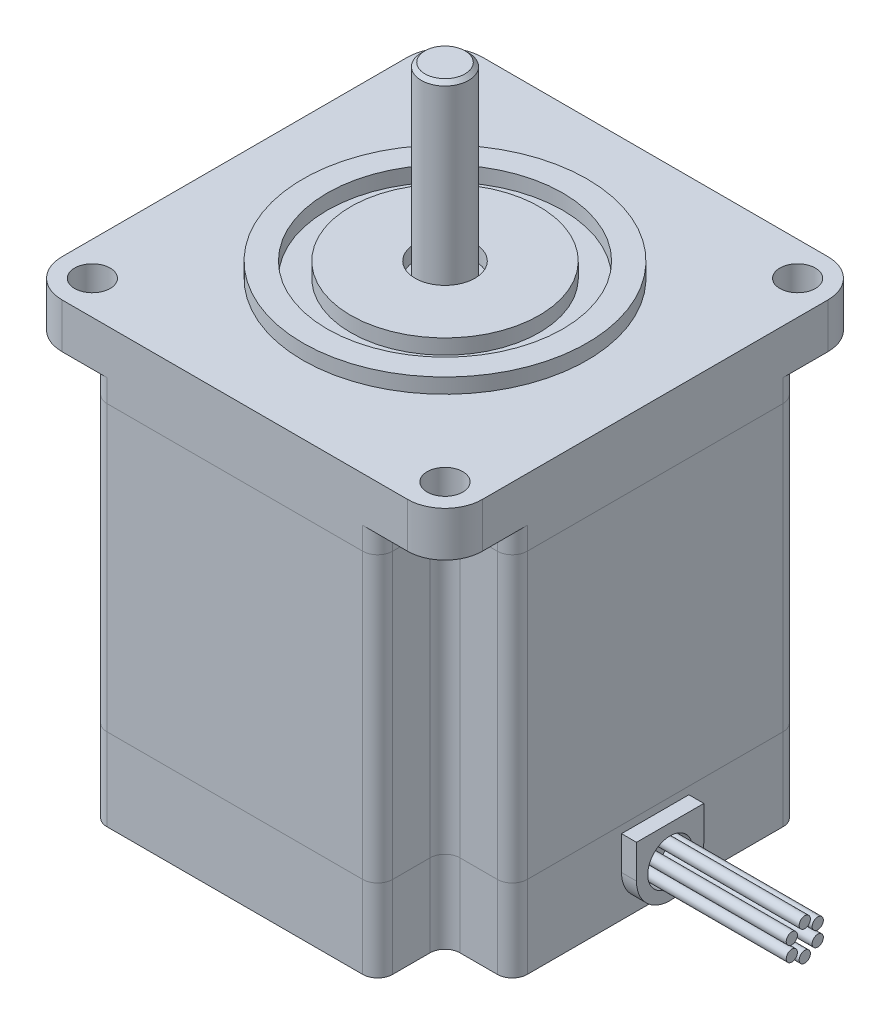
ISO-10303-21;
HEADER;
FILE_DESCRIPTION(('STEP AP214'),'2;1');
FILE_NAME('part.step','',(''),(''),'','','');
FILE_SCHEMA(('AUTOMOTIVE_DESIGN { 1 0 10303 214 1 1 1 1 }'));
ENDSEC;
DATA;
#1=APPLICATION_CONTEXT('core data for automotive mechanical design processes');
#2=APPLICATION_PROTOCOL_DEFINITION('international standard','automotive_design',2000,#1);
#3=PRODUCT_CONTEXT('',#1,'mechanical');
#4=PRODUCT('Part','Part','',(#3));
#5=PRODUCT_RELATED_PRODUCT_CATEGORY('part','',(#4));
#6=PRODUCT_DEFINITION_FORMATION('','',#4);
#7=PRODUCT_DEFINITION_CONTEXT('part definition',#1,'design');
#8=PRODUCT_DEFINITION('design','',#6,#7);
#9=PRODUCT_DEFINITION_SHAPE('','',#8);
#10=(LENGTH_UNIT() NAMED_UNIT(*) SI_UNIT(.MILLI.,.METRE.));
#11=(NAMED_UNIT(*) PLANE_ANGLE_UNIT() SI_UNIT($,.RADIAN.));
#12=(NAMED_UNIT(*) SI_UNIT($,.STERADIAN.) SOLID_ANGLE_UNIT());
#13=UNCERTAINTY_MEASURE_WITH_UNIT(LENGTH_MEASURE(1.E-05),#10,'distance_accuracy_value','');
#14=(GEOMETRIC_REPRESENTATION_CONTEXT(3) GLOBAL_UNCERTAINTY_ASSIGNED_CONTEXT((#13)) GLOBAL_UNIT_ASSIGNED_CONTEXT((#10,
#11,#12)) REPRESENTATION_CONTEXT('',''));
#15=CARTESIAN_POINT('',(0.,0.,0.));
#16=DIRECTION('',(0.,0.,1.));
#17=DIRECTION('',(1.,0.,0.));
#18=AXIS2_PLACEMENT_3D('',#15,#16,#17);
#19=CARTESIAN_POINT('',(0.,83.,0.));
#20=DIRECTION('',(0.,-1.,0.));
#21=DIRECTION('',(0.,0.,-1.));
#22=AXIS2_PLACEMENT_3D('',#19,#20,#21);
#23=CYLINDRICAL_SURFACE('',#22,3.175);
#24=CARTESIAN_POINT('',(0.,82.5,0.));
#25=DIRECTION('',(0.,1.,0.));
#26=DIRECTION('',(0.,0.,1.));
#27=AXIS2_PLACEMENT_3D('',#24,#25,#26);
#28=CIRCLE('',#27,3.175);
#29=CARTESIAN_POINT('',(0.,82.5,3.175));
#30=VERTEX_POINT('',#29);
#31=EDGE_CURVE('E12',#30,#30,#28,.F.);
#32=ORIENTED_EDGE('',*,*,#31,.T.);
#33=EDGE_LOOP('',(#32));
#34=FACE_BOUND('',#33,.T.);
#35=CARTESIAN_POINT('',(0.,58.,0.));
#36=DIRECTION('',(0.,1.,0.));
#37=DIRECTION('',(0.,0.,1.));
#38=AXIS2_PLACEMENT_3D('',#35,#36,#37);
#39=CIRCLE('',#38,3.175);
#40=CARTESIAN_POINT('',(0.,58.,3.175));
#41=VERTEX_POINT('',#40);
#42=EDGE_CURVE('E65',#41,#41,#39,.T.);
#43=ORIENTED_EDGE('',*,*,#42,.T.);
#44=EDGE_LOOP('',(#43));
#45=FACE_BOUND('',#44,.T.);
#46=ADVANCED_FACE('F54',(#34,#45),#23,.T.);
#47=CARTESIAN_POINT('',(0.,83.,0.));
#48=DIRECTION('',(0.,1.,0.));
#49=DIRECTION('',(0.,0.,1.));
#50=AXIS2_PLACEMENT_3D('',#47,#48,#49);
#51=PLANE('',#50);
#52=CARTESIAN_POINT('',(0.,83.,0.));
#53=DIRECTION('',(0.,1.,0.));
#54=DIRECTION('',(0.,0.,1.));
#55=AXIS2_PLACEMENT_3D('',#52,#53,#54);
#56=CIRCLE('',#55,2.67499999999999);
#57=CARTESIAN_POINT('',(0.,83.,2.67499999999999));
#58=VERTEX_POINT('',#57);
#59=EDGE_CURVE('E61',#58,#58,#56,.T.);
#60=ORIENTED_EDGE('',*,*,#59,.T.);
#61=EDGE_LOOP('',(#60));
#62=FACE_BOUND('',#61,.T.);
#63=ADVANCED_FACE('F75',(#62),#51,.T.);
#64=CARTESIAN_POINT('',(0.,58.,0.));
#65=DIRECTION('',(0.,1.,0.));
#66=DIRECTION('',(0.,0.,1.));
#67=AXIS2_PLACEMENT_3D('',#64,#65,#66);
#68=PLANE('',#67);
#69=ORIENTED_EDGE('',*,*,#42,.F.);
#70=EDGE_LOOP('',(#69));
#71=FACE_BOUND('',#70,.T.);
#72=ADVANCED_FACE('F73',(#71),#68,.F.);
#73=CARTESIAN_POINT('',(0.,83.,0.));
#74=DIRECTION('',(0.,-1.,0.));
#75=DIRECTION('',(0.,0.,-1.));
#76=AXIS2_PLACEMENT_3D('',#73,#74,#75);
#77=CONICAL_SURFACE('',#76,2.67499999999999,0.785398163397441);
#78=ORIENTED_EDGE('',*,*,#31,.F.);
#79=EDGE_LOOP('',(#78));
#80=FACE_BOUND('',#79,.T.);
#81=ORIENTED_EDGE('',*,*,#59,.F.);
#82=EDGE_LOOP('',(#81));
#83=FACE_BOUND('',#82,.T.);
#84=ADVANCED_FACE('F56',(#80,#83),#77,.T.);
#85=CLOSED_SHELL('',(#46,#63,#72,#84));
#86=MANIFOLD_SOLID_BREP('B2',#85);
#87=CARTESIAN_POINT('',(48.1,7.5,0.));
#88=DIRECTION('',(-1.,0.,0.));
#89=DIRECTION('',(0.,0.,1.));
#90=AXIS2_PLACEMENT_3D('',#87,#88,#89);
#91=CYLINDRICAL_SURFACE('',#90,0.75);
#92=CARTESIAN_POINT('',(48.1,7.5,0.));
#93=DIRECTION('',(1.,0.,0.));
#94=DIRECTION('',(0.,0.,-1.));
#95=AXIS2_PLACEMENT_3D('',#92,#93,#94);
#96=CIRCLE('',#95,0.75);
#97=CARTESIAN_POINT('',(48.1,7.5,-0.750000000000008));
#98=VERTEX_POINT('',#97);
#99=EDGE_CURVE('E130',#98,#98,#96,.T.);
#100=ORIENTED_EDGE('',*,*,#99,.F.);
#101=EDGE_LOOP('',(#100));
#102=FACE_BOUND('',#101,.T.);
#103=CARTESIAN_POINT('',(28.1,7.5,0.));
#104=DIRECTION('',(1.,0.,0.));
#105=DIRECTION('',(0.,0.,-1.));
#106=AXIS2_PLACEMENT_3D('',#103,#104,#105);
#107=CIRCLE('',#106,0.75);
#108=CARTESIAN_POINT('',(28.1,7.5,-0.750000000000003));
#109=VERTEX_POINT('',#108);
#110=EDGE_CURVE('E53',#109,#109,#107,.T.);
#111=ORIENTED_EDGE('',*,*,#110,.T.);
#112=EDGE_LOOP('',(#111));
#113=FACE_BOUND('',#112,.T.);
#114=ADVANCED_FACE('F126',(#102,#113),#91,.T.);
#115=CARTESIAN_POINT('',(48.1,0.,0.));
#116=DIRECTION('',(1.,0.,0.));
#117=DIRECTION('',(0.,0.,-1.));
#118=AXIS2_PLACEMENT_3D('',#115,#116,#117);
#119=PLANE('',#118);
#120=ORIENTED_EDGE('',*,*,#99,.T.);
#121=EDGE_LOOP('',(#120));
#122=FACE_BOUND('',#121,.T.);
#123=ADVANCED_FACE('F128',(#122),#119,.T.);
#124=CARTESIAN_POINT('',(28.1,0.,0.));
#125=DIRECTION('',(1.,0.,0.));
#126=DIRECTION('',(0.,0.,-1.));
#127=AXIS2_PLACEMENT_3D('',#124,#125,#126);
#128=PLANE('',#127);
#129=ORIENTED_EDGE('',*,*,#110,.F.);
#130=EDGE_LOOP('',(#129));
#131=FACE_BOUND('',#130,.T.);
#132=ADVANCED_FACE('F145',(#131),#128,.F.);
#133=CLOSED_SHELL('',(#114,#123,#132));
#134=MANIFOLD_SOLID_BREP('B7',#133);
#135=CARTESIAN_POINT('',(48.1,6.5,-1.73205080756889));
#136=DIRECTION('',(-1.,0.,0.));
#137=DIRECTION('',(0.,0.,1.));
#138=AXIS2_PLACEMENT_3D('',#135,#136,#137);
#139=CYLINDRICAL_SURFACE('',#138,0.75);
#140=CARTESIAN_POINT('',(48.1,6.5,-1.73205080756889));
#141=DIRECTION('',(1.,0.,0.));
#142=DIRECTION('',(0.,0.,-1.));
#143=AXIS2_PLACEMENT_3D('',#140,#141,#142);
#144=CIRCLE('',#143,0.75);
#145=CARTESIAN_POINT('',(48.1,6.5,-2.48205080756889));
#146=VERTEX_POINT('',#145);
#147=EDGE_CURVE('E189',#146,#146,#144,.T.);
#148=ORIENTED_EDGE('',*,*,#147,.F.);
#149=EDGE_LOOP('',(#148));
#150=FACE_BOUND('',#149,.T.);
#151=CARTESIAN_POINT('',(28.1,6.5,-1.73205080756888));
#152=DIRECTION('',(1.,0.,0.));
#153=DIRECTION('',(0.,0.,-1.));
#154=AXIS2_PLACEMENT_3D('',#151,#152,#153);
#155=CIRCLE('',#154,0.75);
#156=CARTESIAN_POINT('',(28.1,6.5,-2.48205080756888));
#157=VERTEX_POINT('',#156);
#158=EDGE_CURVE('E125',#157,#157,#155,.T.);
#159=ORIENTED_EDGE('',*,*,#158,.T.);
#160=EDGE_LOOP('',(#159));
#161=FACE_BOUND('',#160,.T.);
#162=ADVANCED_FACE('F185',(#150,#161),#139,.T.);
#163=CARTESIAN_POINT('',(48.1,0.,0.));
#164=DIRECTION('',(1.,0.,0.));
#165=DIRECTION('',(0.,0.,-1.));
#166=AXIS2_PLACEMENT_3D('',#163,#164,#165);
#167=PLANE('',#166);
#168=ORIENTED_EDGE('',*,*,#147,.T.);
#169=EDGE_LOOP('',(#168));
#170=FACE_BOUND('',#169,.T.);
#171=ADVANCED_FACE('F187',(#170),#167,.T.);
#172=CARTESIAN_POINT('',(28.1,0.,0.));
#173=DIRECTION('',(1.,0.,0.));
#174=DIRECTION('',(0.,0.,-1.));
#175=AXIS2_PLACEMENT_3D('',#172,#173,#174);
#176=PLANE('',#175);
#177=ORIENTED_EDGE('',*,*,#158,.F.);
#178=EDGE_LOOP('',(#177));
#179=FACE_BOUND('',#178,.T.);
#180=ADVANCED_FACE('F204',(#179),#176,.F.);
#181=CLOSED_SHELL('',(#162,#171,#180));
#182=MANIFOLD_SOLID_BREP('B48',#181);
#183=CARTESIAN_POINT('',(48.1,4.5,-1.73205080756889));
#184=DIRECTION('',(-1.,0.,0.));
#185=DIRECTION('',(0.,0.,1.));
#186=AXIS2_PLACEMENT_3D('',#183,#184,#185);
#187=CYLINDRICAL_SURFACE('',#186,0.750000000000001);
#188=CARTESIAN_POINT('',(48.1,4.5,-1.73205080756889));
#189=DIRECTION('',(1.,0.,0.));
#190=DIRECTION('',(0.,0.,-1.));
#191=AXIS2_PLACEMENT_3D('',#188,#189,#190);
#192=CIRCLE('',#191,0.750000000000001);
#193=CARTESIAN_POINT('',(48.1,4.5,-2.48205080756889));
#194=VERTEX_POINT('',#193);
#195=EDGE_CURVE('E248',#194,#194,#192,.T.);
#196=ORIENTED_EDGE('',*,*,#195,.F.);
#197=EDGE_LOOP('',(#196));
#198=FACE_BOUND('',#197,.T.);
#199=CARTESIAN_POINT('',(28.1,4.5,-1.73205080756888));
#200=DIRECTION('',(1.,0.,0.));
#201=DIRECTION('',(0.,0.,-1.));
#202=AXIS2_PLACEMENT_3D('',#199,#200,#201);
#203=CIRCLE('',#202,0.750000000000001);
#204=CARTESIAN_POINT('',(28.1,4.5,-2.48205080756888));
#205=VERTEX_POINT('',#204);
#206=EDGE_CURVE('E184',#205,#205,#203,.T.);
#207=ORIENTED_EDGE('',*,*,#206,.T.);
#208=EDGE_LOOP('',(#207));
#209=FACE_BOUND('',#208,.T.);
#210=ADVANCED_FACE('F244',(#198,#209),#187,.T.);
#211=CARTESIAN_POINT('',(48.1,0.,0.));
#212=DIRECTION('',(1.,0.,0.));
#213=DIRECTION('',(0.,0.,-1.));
#214=AXIS2_PLACEMENT_3D('',#211,#212,#213);
#215=PLANE('',#214);
#216=ORIENTED_EDGE('',*,*,#195,.T.);
#217=EDGE_LOOP('',(#216));
#218=FACE_BOUND('',#217,.T.);
#219=ADVANCED_FACE('F246',(#218),#215,.T.);
#220=CARTESIAN_POINT('',(28.1,0.,0.));
#221=DIRECTION('',(1.,0.,0.));
#222=DIRECTION('',(0.,0.,-1.));
#223=AXIS2_PLACEMENT_3D('',#220,#221,#222);
#224=PLANE('',#223);
#225=ORIENTED_EDGE('',*,*,#206,.F.);
#226=EDGE_LOOP('',(#225));
#227=FACE_BOUND('',#226,.T.);
#228=ADVANCED_FACE('F263',(#227),#224,.F.);
#229=CLOSED_SHELL('',(#210,#219,#228));
#230=MANIFOLD_SOLID_BREP('B120',#229);
#231=CARTESIAN_POINT('',(48.1,3.5,0.));
#232=DIRECTION('',(-1.,0.,0.));
#233=DIRECTION('',(0.,0.,1.));
#234=AXIS2_PLACEMENT_3D('',#231,#232,#233);
#235=CYLINDRICAL_SURFACE('',#234,0.75);
#236=CARTESIAN_POINT('',(48.1,3.5,0.));
#237=DIRECTION('',(1.,0.,0.));
#238=DIRECTION('',(0.,0.,-1.));
#239=AXIS2_PLACEMENT_3D('',#236,#237,#238);
#240=CIRCLE('',#239,0.75);
#241=CARTESIAN_POINT('',(48.1,3.5,-0.750000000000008));
#242=VERTEX_POINT('',#241);
#243=EDGE_CURVE('E307',#242,#242,#240,.T.);
#244=ORIENTED_EDGE('',*,*,#243,.F.);
#245=EDGE_LOOP('',(#244));
#246=FACE_BOUND('',#245,.T.);
#247=CARTESIAN_POINT('',(28.1,3.5,0.));
#248=DIRECTION('',(1.,0.,0.));
#249=DIRECTION('',(0.,0.,-1.));
#250=AXIS2_PLACEMENT_3D('',#247,#248,#249);
#251=CIRCLE('',#250,0.75);
#252=CARTESIAN_POINT('',(28.1,3.5,-0.750000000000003));
#253=VERTEX_POINT('',#252);
#254=EDGE_CURVE('E243',#253,#253,#251,.T.);
#255=ORIENTED_EDGE('',*,*,#254,.T.);
#256=EDGE_LOOP('',(#255));
#257=FACE_BOUND('',#256,.T.);
#258=ADVANCED_FACE('F303',(#246,#257),#235,.T.);
#259=CARTESIAN_POINT('',(48.1,0.,0.));
#260=DIRECTION('',(1.,0.,0.));
#261=DIRECTION('',(0.,0.,-1.));
#262=AXIS2_PLACEMENT_3D('',#259,#260,#261);
#263=PLANE('',#262);
#264=ORIENTED_EDGE('',*,*,#243,.T.);
#265=EDGE_LOOP('',(#264));
#266=FACE_BOUND('',#265,.T.);
#267=ADVANCED_FACE('F305',(#266),#263,.T.);
#268=CARTESIAN_POINT('',(28.1,0.,0.));
#269=DIRECTION('',(1.,0.,0.));
#270=DIRECTION('',(0.,0.,-1.));
#271=AXIS2_PLACEMENT_3D('',#268,#269,#270);
#272=PLANE('',#271);
#273=ORIENTED_EDGE('',*,*,#254,.F.);
#274=EDGE_LOOP('',(#273));
#275=FACE_BOUND('',#274,.T.);
#276=ADVANCED_FACE('F322',(#275),#272,.F.);
#277=CLOSED_SHELL('',(#258,#267,#276));
#278=MANIFOLD_SOLID_BREP('B179',#277);
#279=CARTESIAN_POINT('',(48.1,4.5,1.73205080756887));
#280=DIRECTION('',(-1.,0.,0.));
#281=DIRECTION('',(0.,0.,1.));
#282=AXIS2_PLACEMENT_3D('',#279,#280,#281);
#283=CYLINDRICAL_SURFACE('',#282,0.75);
#284=CARTESIAN_POINT('',(48.1,4.5,1.73205080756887));
#285=DIRECTION('',(1.,0.,0.));
#286=DIRECTION('',(0.,0.,-1.));
#287=AXIS2_PLACEMENT_3D('',#284,#285,#286);
#288=CIRCLE('',#287,0.75);
#289=CARTESIAN_POINT('',(48.1,4.5,0.98205080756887));
#290=VERTEX_POINT('',#289);
#291=EDGE_CURVE('E362',#290,#290,#288,.T.);
#292=ORIENTED_EDGE('',*,*,#291,.F.);
#293=EDGE_LOOP('',(#292));
#294=FACE_BOUND('',#293,.T.);
#295=CARTESIAN_POINT('',(28.1,4.5,1.73205080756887));
#296=DIRECTION('',(1.,0.,0.));
#297=DIRECTION('',(0.,0.,-1.));
#298=AXIS2_PLACEMENT_3D('',#295,#296,#297);
#299=CIRCLE('',#298,0.75);
#300=CARTESIAN_POINT('',(28.1,4.5,0.982050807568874));
#301=VERTEX_POINT('',#300);
#302=EDGE_CURVE('E302',#301,#301,#299,.T.);
#303=ORIENTED_EDGE('',*,*,#302,.T.);
#304=EDGE_LOOP('',(#303));
#305=FACE_BOUND('',#304,.T.);
#306=ADVANCED_FACE('F358',(#294,#305),#283,.T.);
#307=CARTESIAN_POINT('',(48.1,0.,0.));
#308=DIRECTION('',(1.,0.,0.));
#309=DIRECTION('',(0.,0.,-1.));
#310=AXIS2_PLACEMENT_3D('',#307,#308,#309);
#311=PLANE('',#310);
#312=ORIENTED_EDGE('',*,*,#291,.T.);
#313=EDGE_LOOP('',(#312));
#314=FACE_BOUND('',#313,.T.);
#315=ADVANCED_FACE('F360',(#314),#311,.T.);
#316=CARTESIAN_POINT('',(28.1,0.,0.));
#317=DIRECTION('',(1.,0.,0.));
#318=DIRECTION('',(0.,0.,-1.));
#319=AXIS2_PLACEMENT_3D('',#316,#317,#318);
#320=PLANE('',#319);
#321=ORIENTED_EDGE('',*,*,#302,.F.);
#322=EDGE_LOOP('',(#321));
#323=FACE_BOUND('',#322,.T.);
#324=ADVANCED_FACE('F377',(#323),#320,.F.);
#325=CLOSED_SHELL('',(#306,#315,#324));
#326=MANIFOLD_SOLID_BREP('B238',#325);
#327=CARTESIAN_POINT('',(48.1,6.5,1.73205080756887));
#328=DIRECTION('',(-1.,0.,0.));
#329=DIRECTION('',(0.,0.,1.));
#330=AXIS2_PLACEMENT_3D('',#327,#328,#329);
#331=CYLINDRICAL_SURFACE('',#330,0.749999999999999);
#332=CARTESIAN_POINT('',(48.1,6.5,1.73205080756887));
#333=DIRECTION('',(1.,0.,0.));
#334=DIRECTION('',(0.,0.,-1.));
#335=AXIS2_PLACEMENT_3D('',#332,#333,#334);
#336=CIRCLE('',#335,0.749999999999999);
#337=CARTESIAN_POINT('',(48.1,6.5,0.98205080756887));
#338=VERTEX_POINT('',#337);
#339=EDGE_CURVE('E357',#338,#338,#336,.T.);
#340=ORIENTED_EDGE('',*,*,#339,.F.);
#341=EDGE_LOOP('',(#340));
#342=FACE_BOUND('',#341,.T.);
#343=CARTESIAN_POINT('',(28.1,6.5,1.73205080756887));
#344=DIRECTION('',(1.,0.,0.));
#345=DIRECTION('',(0.,0.,-1.));
#346=AXIS2_PLACEMENT_3D('',#343,#344,#345);
#347=CIRCLE('',#346,0.749999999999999);
#348=CARTESIAN_POINT('',(28.1,6.5,0.982050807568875));
#349=VERTEX_POINT('',#348);
#350=EDGE_CURVE('E422',#349,#349,#347,.T.);
#351=ORIENTED_EDGE('',*,*,#350,.T.);
#352=EDGE_LOOP('',(#351));
#353=FACE_BOUND('',#352,.T.);
#354=ADVANCED_FACE('F419',(#342,#353),#331,.T.);
#355=CARTESIAN_POINT('',(48.1,0.,0.));
#356=DIRECTION('',(1.,0.,0.));
#357=DIRECTION('',(0.,0.,-1.));
#358=AXIS2_PLACEMENT_3D('',#355,#356,#357);
#359=PLANE('',#358);
#360=ORIENTED_EDGE('',*,*,#339,.T.);
#361=EDGE_LOOP('',(#360));
#362=FACE_BOUND('',#361,.T.);
#363=ADVANCED_FACE('F434',(#362),#359,.T.);
#364=CARTESIAN_POINT('',(28.1,0.,0.));
#365=DIRECTION('',(1.,0.,0.));
#366=DIRECTION('',(0.,0.,-1.));
#367=AXIS2_PLACEMENT_3D('',#364,#365,#366);
#368=PLANE('',#367);
#369=ORIENTED_EDGE('',*,*,#350,.F.);
#370=EDGE_LOOP('',(#369));
#371=FACE_BOUND('',#370,.T.);
#372=ADVANCED_FACE('F432',(#371),#368,.F.);
#373=CLOSED_SHELL('',(#354,#363,#372));
#374=MANIFOLD_SOLID_BREP('B297',#373);
#375=CARTESIAN_POINT('',(30.1,5.5,0.));
#376=DIRECTION('',(1.,0.,0.));
#377=DIRECTION('',(0.,0.,-1.));
#378=AXIS2_PLACEMENT_3D('',#375,#376,#377);
#379=PLANE('',#378);
#380=CARTESIAN_POINT('',(30.1,5.5,0.));
#381=DIRECTION('',(1.,0.,0.));
#382=DIRECTION('',(0.,0.,-1.));
#383=AXIS2_PLACEMENT_3D('',#380,#381,#382);
#384=CIRCLE('',#383,4.5);
#385=CARTESIAN_POINT('',(30.1,5.5,4.5));
#386=VERTEX_POINT('',#385);
#387=CARTESIAN_POINT('',(30.1,5.50000000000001,-4.5));
#388=VERTEX_POINT('',#387);
#389=EDGE_CURVE('E533',#386,#388,#384,.T.);
#390=ORIENTED_EDGE('',*,*,#389,.T.);
#391=DIRECTION('',(0.,1.,0.));
#392=VECTOR('',#391,1.);
#393=CARTESIAN_POINT('',(30.1,5.50000000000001,-4.5));
#394=LINE('',#393,#392);
#395=CARTESIAN_POINT('',(30.1,10.,-4.5));
#396=VERTEX_POINT('',#395);
#397=EDGE_CURVE('E528',#388,#396,#394,.T.);
#398=ORIENTED_EDGE('',*,*,#397,.T.);
#399=DIRECTION('',(0.,0.,1.));
#400=VECTOR('',#399,1.);
#401=CARTESIAN_POINT('',(30.1,10.,4.5));
#402=LINE('',#401,#400);
#403=CARTESIAN_POINT('',(30.1,10.,4.5));
#404=VERTEX_POINT('',#403);
#405=EDGE_CURVE('E531',#396,#404,#402,.T.);
#406=ORIENTED_EDGE('',*,*,#405,.T.);
#407=DIRECTION('',(0.,-1.,0.));
#408=VECTOR('',#407,1.);
#409=CARTESIAN_POINT('',(30.1,5.5,4.5));
#410=LINE('',#409,#408);
#411=EDGE_CURVE('E498',#404,#386,#410,.T.);
#412=ORIENTED_EDGE('',*,*,#411,.T.);
#413=EDGE_LOOP('',(#390,#398,#406,#412));
#414=FACE_BOUND('',#413,.T.);
#415=CARTESIAN_POINT('',(30.1,5.5,0.));
#416=DIRECTION('',(1.,0.,0.));
#417=DIRECTION('',(0.,0.,-1.));
#418=AXIS2_PLACEMENT_3D('',#415,#416,#417);
#419=CIRCLE('',#418,3.);
#420=CARTESIAN_POINT('',(30.1,5.5,-3.));
#421=VERTEX_POINT('',#420);
#422=EDGE_CURVE('E548',#421,#421,#419,.T.);
#423=ORIENTED_EDGE('',*,*,#422,.F.);
#424=EDGE_LOOP('',(#423));
#425=FACE_BOUND('',#424,.T.);
#426=ADVANCED_FACE('F481',(#414,#425),#379,.T.);
#427=CARTESIAN_POINT('',(28.1,5.5,0.));
#428=DIRECTION('',(1.,0.,0.));
#429=DIRECTION('',(0.,0.,-1.));
#430=AXIS2_PLACEMENT_3D('',#427,#428,#429);
#431=PLANE('',#430);
#432=CARTESIAN_POINT('',(28.1,5.5,0.));
#433=DIRECTION('',(1.,0.,0.));
#434=DIRECTION('',(0.,0.,-1.));
#435=AXIS2_PLACEMENT_3D('',#432,#433,#434);
#436=CIRCLE('',#435,4.5);
#437=CARTESIAN_POINT('',(28.1,5.5,4.5));
#438=VERTEX_POINT('',#437);
#439=CARTESIAN_POINT('',(28.1,5.50000000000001,-4.5));
#440=VERTEX_POINT('',#439);
#441=EDGE_CURVE('E545',#438,#440,#436,.T.);
#442=ORIENTED_EDGE('',*,*,#441,.F.);
#443=DIRECTION('',(0.,-1.,0.));
#444=VECTOR('',#443,1.);
#445=CARTESIAN_POINT('',(28.1,5.5,4.5));
#446=LINE('',#445,#444);
#447=CARTESIAN_POINT('',(28.1,10.,4.5));
#448=VERTEX_POINT('',#447);
#449=EDGE_CURVE('E521',#448,#438,#446,.T.);
#450=ORIENTED_EDGE('',*,*,#449,.F.);
#451=DIRECTION('',(0.,0.,1.));
#452=VECTOR('',#451,1.);
#453=CARTESIAN_POINT('',(28.1,10.,4.5));
#454=LINE('',#453,#452);
#455=CARTESIAN_POINT('',(28.1,10.,-4.5));
#456=VERTEX_POINT('',#455);
#457=EDGE_CURVE('E515',#456,#448,#454,.T.);
#458=ORIENTED_EDGE('',*,*,#457,.F.);
#459=DIRECTION('',(0.,1.,0.));
#460=VECTOR('',#459,1.);
#461=CARTESIAN_POINT('',(28.1,5.50000000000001,-4.5));
#462=LINE('',#461,#460);
#463=EDGE_CURVE('E537',#440,#456,#462,.T.);
#464=ORIENTED_EDGE('',*,*,#463,.F.);
#465=EDGE_LOOP('',(#442,#450,#458,#464));
#466=FACE_BOUND('',#465,.T.);
#467=CARTESIAN_POINT('',(28.1,5.5,0.));
#468=DIRECTION('',(1.,0.,0.));
#469=DIRECTION('',(0.,0.,-1.));
#470=AXIS2_PLACEMENT_3D('',#467,#468,#469);
#471=CIRCLE('',#470,3.);
#472=CARTESIAN_POINT('',(28.1,5.5,-3.));
#473=VERTEX_POINT('',#472);
#474=EDGE_CURVE('E560',#473,#473,#471,.T.);
#475=ORIENTED_EDGE('',*,*,#474,.T.);
#476=EDGE_LOOP('',(#475));
#477=FACE_BOUND('',#476,.T.);
#478=ADVANCED_FACE('F556',(#466,#477),#431,.F.);
#479=CARTESIAN_POINT('',(30.1,5.5,0.));
#480=DIRECTION('',(-1.,0.,0.));
#481=DIRECTION('',(0.,0.,1.));
#482=AXIS2_PLACEMENT_3D('',#479,#480,#481);
#483=CYLINDRICAL_SURFACE('',#482,4.5);
#484=ORIENTED_EDGE('',*,*,#441,.T.);
#485=DIRECTION('',(-1.,0.,0.));
#486=VECTOR('',#485,1.);
#487=CARTESIAN_POINT('',(30.1,5.50000000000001,-4.5));
#488=LINE('',#487,#486);
#489=EDGE_CURVE('E417',#388,#440,#488,.T.);
#490=ORIENTED_EDGE('',*,*,#489,.F.);
#491=ORIENTED_EDGE('',*,*,#389,.F.);
#492=DIRECTION('',(-1.,0.,0.));
#493=VECTOR('',#492,1.);
#494=CARTESIAN_POINT('',(30.1,5.5,4.5));
#495=LINE('',#494,#493);
#496=EDGE_CURVE('E541',#386,#438,#495,.T.);
#497=ORIENTED_EDGE('',*,*,#496,.T.);
#498=EDGE_LOOP('',(#484,#490,#491,#497));
#499=FACE_BOUND('',#498,.T.);
#500=ADVANCED_FACE('F483',(#499),#483,.T.);
#501=CARTESIAN_POINT('',(30.1,5.50000000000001,-4.5));
#502=DIRECTION('',(0.,0.,1.));
#503=DIRECTION('',(0.,-1.,0.));
#504=AXIS2_PLACEMENT_3D('',#501,#502,#503);
#505=PLANE('',#504);
#506=ORIENTED_EDGE('',*,*,#463,.T.);
#507=DIRECTION('',(-1.,0.,0.));
#508=VECTOR('',#507,1.);
#509=CARTESIAN_POINT('',(30.1,10.,-4.5));
#510=LINE('',#509,#508);
#511=EDGE_CURVE('E490',#396,#456,#510,.T.);
#512=ORIENTED_EDGE('',*,*,#511,.F.);
#513=ORIENTED_EDGE('',*,*,#397,.F.);
#514=ORIENTED_EDGE('',*,*,#489,.T.);
#515=EDGE_LOOP('',(#506,#512,#513,#514));
#516=FACE_BOUND('',#515,.T.);
#517=ADVANCED_FACE('F536',(#516),#505,.F.);
#518=CARTESIAN_POINT('',(30.1,10.,4.5));
#519=DIRECTION('',(0.,-1.,0.));
#520=DIRECTION('',(0.,0.,-1.));
#521=AXIS2_PLACEMENT_3D('',#518,#519,#520);
#522=PLANE('',#521);
#523=ORIENTED_EDGE('',*,*,#457,.T.);
#524=DIRECTION('',(-1.,0.,0.));
#525=VECTOR('',#524,1.);
#526=CARTESIAN_POINT('',(30.1,10.,4.5));
#527=LINE('',#526,#525);
#528=EDGE_CURVE('E538',#404,#448,#527,.T.);
#529=ORIENTED_EDGE('',*,*,#528,.F.);
#530=ORIENTED_EDGE('',*,*,#405,.F.);
#531=ORIENTED_EDGE('',*,*,#511,.T.);
#532=EDGE_LOOP('',(#523,#529,#530,#531));
#533=FACE_BOUND('',#532,.T.);
#534=ADVANCED_FACE('F539',(#533),#522,.F.);
#535=CARTESIAN_POINT('',(30.1,5.5,4.5));
#536=DIRECTION('',(0.,0.,-1.));
#537=DIRECTION('',(-1.,0.,0.));
#538=AXIS2_PLACEMENT_3D('',#535,#536,#537);
#539=PLANE('',#538);
#540=ORIENTED_EDGE('',*,*,#449,.T.);
#541=ORIENTED_EDGE('',*,*,#496,.F.);
#542=ORIENTED_EDGE('',*,*,#411,.F.);
#543=ORIENTED_EDGE('',*,*,#528,.T.);
#544=EDGE_LOOP('',(#540,#541,#542,#543));
#545=FACE_BOUND('',#544,.T.);
#546=ADVANCED_FACE('F553',(#545),#539,.F.);
#547=CARTESIAN_POINT('',(30.1,5.5,0.));
#548=DIRECTION('',(-1.,0.,0.));
#549=DIRECTION('',(0.,0.,1.));
#550=AXIS2_PLACEMENT_3D('',#547,#548,#549);
#551=CYLINDRICAL_SURFACE('',#550,3.);
#552=ORIENTED_EDGE('',*,*,#422,.T.);
#553=EDGE_LOOP('',(#552));
#554=FACE_BOUND('',#553,.T.);
#555=ORIENTED_EDGE('',*,*,#474,.F.);
#556=EDGE_LOOP('',(#555));
#557=FACE_BOUND('',#556,.T.);
#558=ADVANCED_FACE('F566',(#554,#557),#551,.F.);
#559=CLOSED_SHELL('',(#426,#478,#500,#517,#534,#546,#558));
#560=MANIFOLD_SOLID_BREP('B352',#559);
#561=CARTESIAN_POINT('',(0.,58.,0.));
#562=DIRECTION('',(0.,1.,0.));
#563=DIRECTION('',(0.,0.,1.));
#564=AXIS2_PLACEMENT_3D('',#561,#562,#563);
#565=PLANE('',#564);
#566=CARTESIAN_POINT('',(0.,58.,0.));
#567=DIRECTION('',(0.,1.,0.));
#568=DIRECTION('',(0.,0.,1.));
#569=AXIS2_PLACEMENT_3D('',#566,#567,#568);
#570=CIRCLE('',#569,19.);
#571=CARTESIAN_POINT('',(0.,58.,19.));
#572=VERTEX_POINT('',#571);
#573=EDGE_CURVE('E959',#572,#572,#570,.T.);
#574=ORIENTED_EDGE('',*,*,#573,.F.);
#575=EDGE_LOOP('',(#574));
#576=FACE_BOUND('',#575,.T.);
#577=CARTESIAN_POINT('',(-23.57,58.,23.57));
#578=DIRECTION('',(0.,1.,0.));
#579=DIRECTION('',(0.,0.,1.));
#580=AXIS2_PLACEMENT_3D('',#577,#578,#579);
#581=CIRCLE('',#580,2.375);
#582=CARTESIAN_POINT('',(-23.57,58.,25.945));
#583=VERTEX_POINT('',#582);
#584=EDGE_CURVE('E973',#583,#583,#581,.T.);
#585=ORIENTED_EDGE('',*,*,#584,.F.);
#586=EDGE_LOOP('',(#585));
#587=FACE_BOUND('',#586,.T.);
#588=CARTESIAN_POINT('',(23.57,58.,-23.57));
#589=DIRECTION('',(0.,1.,0.));
#590=DIRECTION('',(0.,0.,1.));
#591=AXIS2_PLACEMENT_3D('',#588,#589,#590);
#592=CIRCLE('',#591,2.375);
#593=CARTESIAN_POINT('',(23.57,58.,-21.195));
#594=VERTEX_POINT('',#593);
#595=EDGE_CURVE('E979',#594,#594,#592,.T.);
#596=ORIENTED_EDGE('',*,*,#595,.F.);
#597=EDGE_LOOP('',(#596));
#598=FACE_BOUND('',#597,.T.);
#599=DIRECTION('',(0.,0.,1.));
#600=VECTOR('',#599,1.);
#601=CARTESIAN_POINT('',(-28.1,58.,-28.1));
#602=LINE('',#601,#600);
#603=CARTESIAN_POINT('',(-28.1,58.,-23.1));
#604=VERTEX_POINT('',#603);
#605=CARTESIAN_POINT('',(-28.1,58.,23.1));
#606=VERTEX_POINT('',#605);
#607=EDGE_CURVE('E983',#604,#606,#602,.T.);
#608=ORIENTED_EDGE('',*,*,#607,.T.);
#609=CARTESIAN_POINT('',(-23.1,58.,23.1));
#610=DIRECTION('',(0.,1.,0.));
#611=DIRECTION('',(0.,0.,1.));
#612=AXIS2_PLACEMENT_3D('',#609,#610,#611);
#613=CIRCLE('',#612,5.);
#614=CARTESIAN_POINT('',(-23.1,58.,28.1));
#615=VERTEX_POINT('',#614);
#616=EDGE_CURVE('E1030',#606,#615,#613,.T.);
#617=ORIENTED_EDGE('',*,*,#616,.T.);
#618=DIRECTION('',(1.,0.,0.));
#619=VECTOR('',#618,1.);
#620=CARTESIAN_POINT('',(-28.1,58.,28.1));
#621=LINE('',#620,#619);
#622=CARTESIAN_POINT('',(23.1,58.,28.1));
#623=VERTEX_POINT('',#622);
#624=EDGE_CURVE('E877',#615,#623,#621,.T.);
#625=ORIENTED_EDGE('',*,*,#624,.T.);
#626=CARTESIAN_POINT('',(23.1,58.,23.1));
#627=DIRECTION('',(0.,1.,0.));
#628=DIRECTION('',(0.,0.,1.));
#629=AXIS2_PLACEMENT_3D('',#626,#627,#628);
#630=CIRCLE('',#629,5.);
#631=CARTESIAN_POINT('',(28.1,58.,23.1));
#632=VERTEX_POINT('',#631);
#633=EDGE_CURVE('E1028',#623,#632,#630,.T.);
#634=ORIENTED_EDGE('',*,*,#633,.T.);
#635=DIRECTION('',(0.,0.,-1.));
#636=VECTOR('',#635,1.);
#637=CARTESIAN_POINT('',(28.1,58.,28.1));
#638=LINE('',#637,#636);
#639=CARTESIAN_POINT('',(28.1,58.,-23.1));
#640=VERTEX_POINT('',#639);
#641=EDGE_CURVE('E988',#632,#640,#638,.T.);
#642=ORIENTED_EDGE('',*,*,#641,.T.);
#643=CARTESIAN_POINT('',(23.1,58.,-23.1));
#644=DIRECTION('',(0.,1.,0.));
#645=DIRECTION('',(0.,0.,1.));
#646=AXIS2_PLACEMENT_3D('',#643,#644,#645);
#647=CIRCLE('',#646,5.);
#648=CARTESIAN_POINT('',(23.1,58.,-28.1));
#649=VERTEX_POINT('',#648);
#650=EDGE_CURVE('E1026',#640,#649,#647,.T.);
#651=ORIENTED_EDGE('',*,*,#650,.T.);
#652=DIRECTION('',(-1.,0.,0.));
#653=VECTOR('',#652,1.);
#654=CARTESIAN_POINT('',(28.1,58.,-28.1));
#655=LINE('',#654,#653);
#656=CARTESIAN_POINT('',(-23.1,58.,-28.1));
#657=VERTEX_POINT('',#656);
#658=EDGE_CURVE('E991',#649,#657,#655,.T.);
#659=ORIENTED_EDGE('',*,*,#658,.T.);
#660=CARTESIAN_POINT('',(-23.1,58.,-23.1));
#661=DIRECTION('',(0.,1.,0.));
#662=DIRECTION('',(0.,0.,1.));
#663=AXIS2_PLACEMENT_3D('',#660,#661,#662);
#664=CIRCLE('',#663,5.);
#665=EDGE_CURVE('E1024',#657,#604,#664,.T.);
#666=ORIENTED_EDGE('',*,*,#665,.T.);
#667=EDGE_LOOP('',(#608,#617,#625,#634,#642,#651,#659,#666));
#668=FACE_BOUND('',#667,.T.);
#669=CARTESIAN_POINT('',(23.57,58.,23.57));
#670=DIRECTION('',(0.,1.,0.));
#671=DIRECTION('',(0.,0.,1.));
#672=AXIS2_PLACEMENT_3D('',#669,#670,#671);
#673=CIRCLE('',#672,2.375);
#674=CARTESIAN_POINT('',(23.57,58.,25.945));
#675=VERTEX_POINT('',#674);
#676=EDGE_CURVE('E976',#675,#675,#673,.T.);
#677=ORIENTED_EDGE('',*,*,#676,.F.);
#678=EDGE_LOOP('',(#677));
#679=FACE_BOUND('',#678,.T.);
#680=CARTESIAN_POINT('',(-23.57,58.,-23.57));
#681=DIRECTION('',(0.,1.,0.));
#682=DIRECTION('',(0.,0.,1.));
#683=AXIS2_PLACEMENT_3D('',#680,#681,#682);
#684=CIRCLE('',#683,2.375);
#685=CARTESIAN_POINT('',(-23.57,58.,-21.195));
#686=VERTEX_POINT('',#685);
#687=EDGE_CURVE('E968',#686,#686,#684,.T.);
#688=ORIENTED_EDGE('',*,*,#687,.F.);
#689=EDGE_LOOP('',(#688));
#690=FACE_BOUND('',#689,.T.);
#691=ADVANCED_FACE('F651',(#576,#587,#598,#668,#679,#690),#565,.T.);
#692=CARTESIAN_POINT('',(0.,49.,0.));
#693=DIRECTION('',(0.,1.,0.));
#694=DIRECTION('',(0.,0.,1.));
#695=AXIS2_PLACEMENT_3D('',#692,#693,#694);
#696=PLANE('',#695);
#697=DIRECTION('',(-1.,0.,0.));
#698=VECTOR('',#697,1.);
#699=CARTESIAN_POINT('',(28.1,49.,-28.1));
#700=LINE('',#699,#698);
#701=CARTESIAN_POINT('',(17.1,49.,-28.1));
#702=VERTEX_POINT('',#701);
#703=CARTESIAN_POINT('',(-17.1,49.,-28.1));
#704=VERTEX_POINT('',#703);
#705=EDGE_CURVE('E986',#702,#704,#700,.T.);
#706=ORIENTED_EDGE('',*,*,#705,.F.);
#707=CARTESIAN_POINT('',(17.1,49.,-26.1));
#708=DIRECTION('',(0.,1.,0.));
#709=DIRECTION('',(0.,0.,1.));
#710=AXIS2_PLACEMENT_3D('',#707,#708,#709);
#711=CIRCLE('',#710,2.);
#712=CARTESIAN_POINT('',(19.1,49.,-26.1));
#713=VERTEX_POINT('',#712);
#714=EDGE_CURVE('E1068',#702,#713,#711,.F.);
#715=ORIENTED_EDGE('',*,*,#714,.T.);
#716=DIRECTION('',(0.,0.,1.));
#717=VECTOR('',#716,1.);
#718=CARTESIAN_POINT('',(19.1,49.,0.));
#719=LINE('',#718,#717);
#720=CARTESIAN_POINT('',(19.1,49.,-21.1));
#721=VERTEX_POINT('',#720);
#722=EDGE_CURVE('E930',#713,#721,#719,.T.);
#723=ORIENTED_EDGE('',*,*,#722,.T.);
#724=CARTESIAN_POINT('',(21.1,49.,-21.1));
#725=DIRECTION('',(0.,1.,0.));
#726=DIRECTION('',(0.,0.,1.));
#727=AXIS2_PLACEMENT_3D('',#724,#725,#726);
#728=CIRCLE('',#727,2.);
#729=CARTESIAN_POINT('',(21.1,49.,-19.1));
#730=VERTEX_POINT('',#729);
#731=EDGE_CURVE('E1139',#721,#730,#728,.T.);
#732=ORIENTED_EDGE('',*,*,#731,.T.);
#733=DIRECTION('',(1.,0.,0.));
#734=VECTOR('',#733,1.);
#735=CARTESIAN_POINT('',(0.,49.,-19.1));
#736=LINE('',#735,#734);
#737=CARTESIAN_POINT('',(26.1,49.,-19.1));
#738=VERTEX_POINT('',#737);
#739=EDGE_CURVE('E934',#730,#738,#736,.T.);
#740=ORIENTED_EDGE('',*,*,#739,.T.);
#741=CARTESIAN_POINT('',(26.1,49.,-17.1));
#742=DIRECTION('',(0.,1.,0.));
#743=DIRECTION('',(0.,0.,1.));
#744=AXIS2_PLACEMENT_3D('',#741,#742,#743);
#745=CIRCLE('',#744,2.);
#746=CARTESIAN_POINT('',(28.1,49.,-17.1));
#747=VERTEX_POINT('',#746);
#748=EDGE_CURVE('E1066',#738,#747,#745,.F.);
#749=ORIENTED_EDGE('',*,*,#748,.T.);
#750=DIRECTION('',(0.,0.,-1.));
#751=VECTOR('',#750,1.);
#752=CARTESIAN_POINT('',(28.1,49.,28.1));
#753=LINE('',#752,#751);
#754=CARTESIAN_POINT('',(28.1,49.,17.1));
#755=VERTEX_POINT('',#754);
#756=EDGE_CURVE('E1000',#755,#747,#753,.T.);
#757=ORIENTED_EDGE('',*,*,#756,.F.);
#758=CARTESIAN_POINT('',(26.1,49.,17.1));
#759=DIRECTION('',(0.,1.,0.));
#760=DIRECTION('',(0.,0.,1.));
#761=AXIS2_PLACEMENT_3D('',#758,#759,#760);
#762=CIRCLE('',#761,2.);
#763=CARTESIAN_POINT('',(26.1,49.,19.1));
#764=VERTEX_POINT('',#763);
#765=EDGE_CURVE('E1056',#755,#764,#762,.F.);
#766=ORIENTED_EDGE('',*,*,#765,.T.);
#767=DIRECTION('',(-1.,0.,0.));
#768=VECTOR('',#767,1.);
#769=CARTESIAN_POINT('',(0.,49.,19.1));
#770=LINE('',#769,#768);
#771=CARTESIAN_POINT('',(21.1,49.,19.1));
#772=VERTEX_POINT('',#771);
#773=EDGE_CURVE('E937',#764,#772,#770,.T.);
#774=ORIENTED_EDGE('',*,*,#773,.T.);
#775=CARTESIAN_POINT('',(21.1,49.,21.1));
#776=DIRECTION('',(0.,1.,0.));
#777=DIRECTION('',(0.,0.,1.));
#778=AXIS2_PLACEMENT_3D('',#775,#776,#777);
#779=CIRCLE('',#778,2.);
#780=CARTESIAN_POINT('',(19.1,49.,21.1));
#781=VERTEX_POINT('',#780);
#782=EDGE_CURVE('E659',#772,#781,#779,.T.);
#783=ORIENTED_EDGE('',*,*,#782,.T.);
#784=DIRECTION('',(0.,0.,1.));
#785=VECTOR('',#784,1.);
#786=CARTESIAN_POINT('',(19.1,49.,0.));
#787=LINE('',#786,#785);
#788=CARTESIAN_POINT('',(19.1,49.,26.1));
#789=VERTEX_POINT('',#788);
#790=EDGE_CURVE('E940',#781,#789,#787,.T.);
#791=ORIENTED_EDGE('',*,*,#790,.T.);
#792=CARTESIAN_POINT('',(17.1,49.,26.1));
#793=DIRECTION('',(0.,1.,0.));
#794=DIRECTION('',(0.,0.,1.));
#795=AXIS2_PLACEMENT_3D('',#792,#793,#794);
#796=CIRCLE('',#795,2.);
#797=CARTESIAN_POINT('',(17.1,49.,28.1));
#798=VERTEX_POINT('',#797);
#799=EDGE_CURVE('E1054',#789,#798,#796,.F.);
#800=ORIENTED_EDGE('',*,*,#799,.T.);
#801=DIRECTION('',(1.,0.,0.));
#802=VECTOR('',#801,1.);
#803=CARTESIAN_POINT('',(-28.1,49.,28.1));
#804=LINE('',#803,#802);
#805=CARTESIAN_POINT('',(-17.1,49.,28.1));
#806=VERTEX_POINT('',#805);
#807=EDGE_CURVE('E997',#806,#798,#804,.T.);
#808=ORIENTED_EDGE('',*,*,#807,.F.);
#809=CARTESIAN_POINT('',(-17.1,49.,26.1));
#810=DIRECTION('',(0.,1.,0.));
#811=DIRECTION('',(0.,0.,1.));
#812=AXIS2_PLACEMENT_3D('',#809,#810,#811);
#813=CIRCLE('',#812,2.);
#814=CARTESIAN_POINT('',(-19.1,49.,26.1));
#815=VERTEX_POINT('',#814);
#816=EDGE_CURVE('E1058',#806,#815,#813,.F.);
#817=ORIENTED_EDGE('',*,*,#816,.T.);
#818=DIRECTION('',(0.,0.,-1.));
#819=VECTOR('',#818,1.);
#820=CARTESIAN_POINT('',(-19.1,49.,0.));
#821=LINE('',#820,#819);
#822=CARTESIAN_POINT('',(-19.1,49.,21.1));
#823=VERTEX_POINT('',#822);
#824=EDGE_CURVE('E943',#815,#823,#821,.T.);
#825=ORIENTED_EDGE('',*,*,#824,.T.);
#826=CARTESIAN_POINT('',(-21.1,49.,21.1));
#827=DIRECTION('',(0.,1.,0.));
#828=DIRECTION('',(0.,0.,1.));
#829=AXIS2_PLACEMENT_3D('',#826,#827,#828);
#830=CIRCLE('',#829,2.);
#831=CARTESIAN_POINT('',(-21.1,49.,19.1));
#832=VERTEX_POINT('',#831);
#833=EDGE_CURVE('E1150',#823,#832,#830,.T.);
#834=ORIENTED_EDGE('',*,*,#833,.T.);
#835=DIRECTION('',(-1.,0.,0.));
#836=VECTOR('',#835,1.);
#837=CARTESIAN_POINT('',(0.,49.,19.1));
#838=LINE('',#837,#836);
#839=CARTESIAN_POINT('',(-26.1,49.,19.1));
#840=VERTEX_POINT('',#839);
#841=EDGE_CURVE('E949',#832,#840,#838,.T.);
#842=ORIENTED_EDGE('',*,*,#841,.T.);
#843=CARTESIAN_POINT('',(-26.1,49.,17.1));
#844=DIRECTION('',(0.,1.,0.));
#845=DIRECTION('',(0.,0.,1.));
#846=AXIS2_PLACEMENT_3D('',#843,#844,#845);
#847=CIRCLE('',#846,2.);
#848=CARTESIAN_POINT('',(-28.1,49.,17.1));
#849=VERTEX_POINT('',#848);
#850=EDGE_CURVE('E1060',#840,#849,#847,.F.);
#851=ORIENTED_EDGE('',*,*,#850,.T.);
#852=DIRECTION('',(0.,0.,1.));
#853=VECTOR('',#852,1.);
#854=CARTESIAN_POINT('',(-28.1,49.,-28.1));
#855=LINE('',#854,#853);
#856=CARTESIAN_POINT('',(-28.1,49.,-17.1));
#857=VERTEX_POINT('',#856);
#858=EDGE_CURVE('E982',#857,#849,#855,.T.);
#859=ORIENTED_EDGE('',*,*,#858,.F.);
#860=CARTESIAN_POINT('',(-26.1,49.,-17.1));
#861=DIRECTION('',(0.,1.,0.));
#862=DIRECTION('',(0.,0.,1.));
#863=AXIS2_PLACEMENT_3D('',#860,#861,#862);
#864=CIRCLE('',#863,2.);
#865=CARTESIAN_POINT('',(-26.1,49.,-19.1));
#866=VERTEX_POINT('',#865);
#867=EDGE_CURVE('E1062',#857,#866,#864,.F.);
#868=ORIENTED_EDGE('',*,*,#867,.T.);
#869=DIRECTION('',(1.,0.,0.));
#870=VECTOR('',#869,1.);
#871=CARTESIAN_POINT('',(0.,49.,-19.1));
#872=LINE('',#871,#870);
#873=CARTESIAN_POINT('',(-21.1,49.,-19.1));
#874=VERTEX_POINT('',#873);
#875=EDGE_CURVE('E946',#866,#874,#872,.T.);
#876=ORIENTED_EDGE('',*,*,#875,.T.);
#877=CARTESIAN_POINT('',(-21.1,49.,-21.1));
#878=DIRECTION('',(0.,1.,0.));
#879=DIRECTION('',(0.,0.,1.));
#880=AXIS2_PLACEMENT_3D('',#877,#878,#879);
#881=CIRCLE('',#880,2.);
#882=CARTESIAN_POINT('',(-19.1,49.,-21.1));
#883=VERTEX_POINT('',#882);
#884=EDGE_CURVE('E1143',#874,#883,#881,.T.);
#885=ORIENTED_EDGE('',*,*,#884,.T.);
#886=DIRECTION('',(0.,0.,-1.));
#887=VECTOR('',#886,1.);
#888=CARTESIAN_POINT('',(-19.1,49.,0.));
#889=LINE('',#888,#887);
#890=CARTESIAN_POINT('',(-19.1,49.,-26.1));
#891=VERTEX_POINT('',#890);
#892=EDGE_CURVE('E927',#883,#891,#889,.T.);
#893=ORIENTED_EDGE('',*,*,#892,.T.);
#894=CARTESIAN_POINT('',(-17.1,49.,-26.1));
#895=DIRECTION('',(0.,1.,0.));
#896=DIRECTION('',(0.,0.,1.));
#897=AXIS2_PLACEMENT_3D('',#894,#895,#896);
#898=CIRCLE('',#897,2.);
#899=EDGE_CURVE('E1064',#891,#704,#898,.F.);
#900=ORIENTED_EDGE('',*,*,#899,.T.);
#901=EDGE_LOOP('',(#706,#715,#723,#732,#740,#749,#757,#766,#774,#783,#791,#800,#808,#817,#825,
#834,#842,#851,#859,#868,#876,#885,#893,#900));
#902=FACE_BOUND('',#901,.T.);
#903=ADVANCED_FACE('F1157',(#902),#696,.F.);
#904=CARTESIAN_POINT('',(-28.1,58.,-28.1));
#905=DIRECTION('',(1.,0.,0.));
#906=DIRECTION('',(0.,0.,-1.));
#907=AXIS2_PLACEMENT_3D('',#904,#905,#906);
#908=PLANE('',#907);
#909=DIRECTION('',(0.,0.,-1.));
#910=VECTOR('',#909,1.);
#911=CARTESIAN_POINT('',(-28.1,52.,-28.1));
#912=LINE('',#911,#910);
#913=CARTESIAN_POINT('',(-28.1,52.,-17.1));
#914=VERTEX_POINT('',#913);
#915=CARTESIAN_POINT('',(-28.1,52.,-23.1));
#916=VERTEX_POINT('',#915);
#917=EDGE_CURVE('E922',#914,#916,#912,.T.);
#918=ORIENTED_EDGE('',*,*,#917,.F.);
#919=DIRECTION('',(0.,-1.,0.));
#920=VECTOR('',#919,1.);
#921=CARTESIAN_POINT('',(-28.1,58.,-17.1));
#922=LINE('',#921,#920);
#923=EDGE_CURVE('E1103',#914,#857,#922,.T.);
#924=ORIENTED_EDGE('',*,*,#923,.T.);
#925=ORIENTED_EDGE('',*,*,#858,.T.);
#926=DIRECTION('',(0.,-1.,0.));
#927=VECTOR('',#926,1.);
#928=CARTESIAN_POINT('',(-28.1,58.,17.1));
#929=LINE('',#928,#927);
#930=CARTESIAN_POINT('',(-28.1,52.,17.1));
#931=VERTEX_POINT('',#930);
#932=EDGE_CURVE('E1100',#849,#931,#929,.F.);
#933=ORIENTED_EDGE('',*,*,#932,.T.);
#934=DIRECTION('',(0.,0.,-1.));
#935=VECTOR('',#934,1.);
#936=CARTESIAN_POINT('',(-28.1,52.,28.1));
#937=LINE('',#936,#935);
#938=CARTESIAN_POINT('',(-28.1,52.,23.1));
#939=VERTEX_POINT('',#938);
#940=EDGE_CURVE('E886',#939,#931,#937,.T.);
#941=ORIENTED_EDGE('',*,*,#940,.F.);
#942=DIRECTION('',(0.,-1.,0.));
#943=VECTOR('',#942,1.);
#944=CARTESIAN_POINT('',(-28.1,58.,23.1));
#945=LINE('',#944,#943);
#946=EDGE_CURVE('E864',#939,#606,#945,.F.);
#947=ORIENTED_EDGE('',*,*,#946,.T.);
#948=ORIENTED_EDGE('',*,*,#607,.F.);
#949=DIRECTION('',(0.,-1.,0.));
#950=VECTOR('',#949,1.);
#951=CARTESIAN_POINT('',(-28.1,58.,-23.1));
#952=LINE('',#951,#950);
#953=EDGE_CURVE('E868',#604,#916,#952,.T.);
#954=ORIENTED_EDGE('',*,*,#953,.T.);
#955=EDGE_LOOP('',(#918,#924,#925,#933,#941,#947,#948,#954));
#956=FACE_BOUND('',#955,.T.);
#957=ADVANCED_FACE('F1190',(#956),#908,.F.);
#958=CARTESIAN_POINT('',(-28.1,58.,28.1));
#959=DIRECTION('',(0.,0.,-1.));
#960=DIRECTION('',(-1.,0.,0.));
#961=AXIS2_PLACEMENT_3D('',#958,#959,#960);
#962=PLANE('',#961);
#963=DIRECTION('',(-1.,0.,0.));
#964=VECTOR('',#963,1.);
#965=CARTESIAN_POINT('',(-28.1,52.,28.1));
#966=LINE('',#965,#964);
#967=CARTESIAN_POINT('',(-17.1,52.,28.1));
#968=VERTEX_POINT('',#967);
#969=CARTESIAN_POINT('',(-23.1,52.,28.1));
#970=VERTEX_POINT('',#969);
#971=EDGE_CURVE('E874',#968,#970,#966,.T.);
#972=ORIENTED_EDGE('',*,*,#971,.F.);
#973=DIRECTION('',(0.,-1.,0.));
#974=VECTOR('',#973,1.);
#975=CARTESIAN_POINT('',(-17.1,58.,28.1));
#976=LINE('',#975,#974);
#977=EDGE_CURVE('E1121',#968,#806,#976,.T.);
#978=ORIENTED_EDGE('',*,*,#977,.T.);
#979=ORIENTED_EDGE('',*,*,#807,.T.);
#980=DIRECTION('',(0.,-1.,0.));
#981=VECTOR('',#980,1.);
#982=CARTESIAN_POINT('',(17.1,58.,28.1));
#983=LINE('',#982,#981);
#984=CARTESIAN_POINT('',(17.1,52.,28.1));
#985=VERTEX_POINT('',#984);
#986=EDGE_CURVE('E1118',#798,#985,#983,.F.);
#987=ORIENTED_EDGE('',*,*,#986,.T.);
#988=DIRECTION('',(-1.,0.,0.));
#989=VECTOR('',#988,1.);
#990=CARTESIAN_POINT('',(28.1,52.,28.1));
#991=LINE('',#990,#989);
#992=CARTESIAN_POINT('',(23.1,52.,28.1));
#993=VERTEX_POINT('',#992);
#994=EDGE_CURVE('E899',#993,#985,#991,.T.);
#995=ORIENTED_EDGE('',*,*,#994,.F.);
#996=DIRECTION('',(0.,-1.,0.));
#997=VECTOR('',#996,1.);
#998=CARTESIAN_POINT('',(23.1,58.,28.1));
#999=LINE('',#998,#997);
#1000=EDGE_CURVE('E878',#993,#623,#999,.F.);
#1001=ORIENTED_EDGE('',*,*,#1000,.T.);
#1002=ORIENTED_EDGE('',*,*,#624,.F.);
#1003=DIRECTION('',(0.,-1.,0.));
#1004=VECTOR('',#1003,1.);
#1005=CARTESIAN_POINT('',(-23.1,58.,28.1));
#1006=LINE('',#1005,#1004);
#1007=EDGE_CURVE('E863',#615,#970,#1006,.T.);
#1008=ORIENTED_EDGE('',*,*,#1007,.T.);
#1009=EDGE_LOOP('',(#972,#978,#979,#987,#995,#1001,#1002,#1008));
#1010=FACE_BOUND('',#1009,.T.);
#1011=ADVANCED_FACE('F872',(#1010),#962,.F.);
#1012=CARTESIAN_POINT('',(28.1,58.,28.1));
#1013=DIRECTION('',(-1.,0.,0.));
#1014=DIRECTION('',(0.,0.,1.));
#1015=AXIS2_PLACEMENT_3D('',#1012,#1013,#1014);
#1016=PLANE('',#1015);
#1017=ORIENTED_EDGE('',*,*,#756,.T.);
#1018=DIRECTION('',(0.,-1.,0.));
#1019=VECTOR('',#1018,1.);
#1020=CARTESIAN_POINT('',(28.1,58.,-17.1));
#1021=LINE('',#1020,#1019);
#1022=CARTESIAN_POINT('',(28.1,52.,-17.1));
#1023=VERTEX_POINT('',#1022);
#1024=EDGE_CURVE('E1083',#747,#1023,#1021,.F.);
#1025=ORIENTED_EDGE('',*,*,#1024,.T.);
#1026=DIRECTION('',(0.,0.,1.));
#1027=VECTOR('',#1026,1.);
#1028=CARTESIAN_POINT('',(28.1,52.,-28.1));
#1029=LINE('',#1028,#1027);
#1030=CARTESIAN_POINT('',(28.1,52.,-23.1));
#1031=VERTEX_POINT('',#1030);
#1032=EDGE_CURVE('E898',#1031,#1023,#1029,.T.);
#1033=ORIENTED_EDGE('',*,*,#1032,.F.);
#1034=DIRECTION('',(0.,-1.,0.));
#1035=VECTOR('',#1034,1.);
#1036=CARTESIAN_POINT('',(28.1,58.,-23.1));
#1037=LINE('',#1036,#1035);
#1038=EDGE_CURVE('E1032',#1031,#640,#1037,.F.);
#1039=ORIENTED_EDGE('',*,*,#1038,.T.);
#1040=ORIENTED_EDGE('',*,*,#641,.F.);
#1041=DIRECTION('',(0.,-1.,0.));
#1042=VECTOR('',#1041,1.);
#1043=CARTESIAN_POINT('',(28.1,58.,23.1));
#1044=LINE('',#1043,#1042);
#1045=CARTESIAN_POINT('',(28.1,52.,23.1));
#1046=VERTEX_POINT('',#1045);
#1047=EDGE_CURVE('E1034',#632,#1046,#1044,.T.);
#1048=ORIENTED_EDGE('',*,*,#1047,.T.);
#1049=DIRECTION('',(0.,0.,1.));
#1050=VECTOR('',#1049,1.);
#1051=CARTESIAN_POINT('',(28.1,52.,28.1));
#1052=LINE('',#1051,#1050);
#1053=CARTESIAN_POINT('',(28.1,52.,17.1));
#1054=VERTEX_POINT('',#1053);
#1055=EDGE_CURVE('E901',#1054,#1046,#1052,.T.);
#1056=ORIENTED_EDGE('',*,*,#1055,.F.);
#1057=DIRECTION('',(0.,-1.,0.));
#1058=VECTOR('',#1057,1.);
#1059=CARTESIAN_POINT('',(28.1,58.,17.1));
#1060=LINE('',#1059,#1058);
#1061=EDGE_CURVE('E1080',#1054,#755,#1060,.T.);
#1062=ORIENTED_EDGE('',*,*,#1061,.T.);
#1063=EDGE_LOOP('',(#1017,#1025,#1033,#1039,#1040,#1048,#1056,#1062));
#1064=FACE_BOUND('',#1063,.T.);
#1065=ADVANCED_FACE('F1176',(#1064),#1016,.F.);
#1066=CARTESIAN_POINT('',(28.1,58.,-28.1));
#1067=DIRECTION('',(0.,0.,1.));
#1068=DIRECTION('',(1.,0.,0.));
#1069=AXIS2_PLACEMENT_3D('',#1066,#1067,#1068);
#1070=PLANE('',#1069);
#1071=DIRECTION('',(1.,0.,0.));
#1072=VECTOR('',#1071,1.);
#1073=CARTESIAN_POINT('',(28.1,52.,-28.1));
#1074=LINE('',#1073,#1072);
#1075=CARTESIAN_POINT('',(17.1,52.,-28.1));
#1076=VERTEX_POINT('',#1075);
#1077=CARTESIAN_POINT('',(23.1,52.,-28.1));
#1078=VERTEX_POINT('',#1077);
#1079=EDGE_CURVE('E912',#1076,#1078,#1074,.T.);
#1080=ORIENTED_EDGE('',*,*,#1079,.F.);
#1081=DIRECTION('',(0.,-1.,0.));
#1082=VECTOR('',#1081,1.);
#1083=CARTESIAN_POINT('',(17.1,58.,-28.1));
#1084=LINE('',#1083,#1082);
#1085=EDGE_CURVE('E1051',#1076,#702,#1084,.T.);
#1086=ORIENTED_EDGE('',*,*,#1085,.T.);
#1087=ORIENTED_EDGE('',*,*,#705,.T.);
#1088=DIRECTION('',(0.,-1.,0.));
#1089=VECTOR('',#1088,1.);
#1090=CARTESIAN_POINT('',(-17.1,58.,-28.1));
#1091=LINE('',#1090,#1089);
#1092=CARTESIAN_POINT('',(-17.1,52.,-28.1));
#1093=VERTEX_POINT('',#1092);
#1094=EDGE_CURVE('E1048',#704,#1093,#1091,.F.);
#1095=ORIENTED_EDGE('',*,*,#1094,.T.);
#1096=DIRECTION('',(1.,0.,0.));
#1097=VECTOR('',#1096,1.);
#1098=CARTESIAN_POINT('',(-28.1,52.,-28.1));
#1099=LINE('',#1098,#1097);
#1100=CARTESIAN_POINT('',(-23.1,52.,-28.1));
#1101=VERTEX_POINT('',#1100);
#1102=EDGE_CURVE('E910',#1101,#1093,#1099,.T.);
#1103=ORIENTED_EDGE('',*,*,#1102,.F.);
#1104=DIRECTION('',(0.,-1.,0.));
#1105=VECTOR('',#1104,1.);
#1106=CARTESIAN_POINT('',(-23.1,58.,-28.1));
#1107=LINE('',#1106,#1105);
#1108=EDGE_CURVE('E1039',#1101,#657,#1107,.F.);
#1109=ORIENTED_EDGE('',*,*,#1108,.T.);
#1110=ORIENTED_EDGE('',*,*,#658,.F.);
#1111=DIRECTION('',(0.,-1.,0.));
#1112=VECTOR('',#1111,1.);
#1113=CARTESIAN_POINT('',(23.1,58.,-28.1));
#1114=LINE('',#1113,#1112);
#1115=EDGE_CURVE('E1041',#649,#1078,#1114,.T.);
#1116=ORIENTED_EDGE('',*,*,#1115,.T.);
#1117=EDGE_LOOP('',(#1080,#1086,#1087,#1095,#1103,#1109,#1110,#1116));
#1118=FACE_BOUND('',#1117,.T.);
#1119=ADVANCED_FACE('F1198',(#1118),#1070,.F.);
#1120=CARTESIAN_POINT('',(23.57,58.,-23.57));
#1121=DIRECTION('',(0.,-1.,0.));
#1122=DIRECTION('',(0.,0.,-1.));
#1123=AXIS2_PLACEMENT_3D('',#1120,#1121,#1122);
#1124=CYLINDRICAL_SURFACE('',#1123,2.375);
#1125=CARTESIAN_POINT('',(23.57,52.,-23.57));
#1126=DIRECTION('',(0.,1.,0.));
#1127=DIRECTION('',(0.,0.,1.));
#1128=AXIS2_PLACEMENT_3D('',#1125,#1126,#1127);
#1129=CIRCLE('',#1128,2.375);
#1130=CARTESIAN_POINT('',(23.57,52.,-21.195));
#1131=VERTEX_POINT('',#1130);
#1132=EDGE_CURVE('E931',#1131,#1131,#1129,.T.);
#1133=ORIENTED_EDGE('',*,*,#1132,.F.);
#1134=EDGE_LOOP('',(#1133));
#1135=FACE_BOUND('',#1134,.T.);
#1136=ORIENTED_EDGE('',*,*,#595,.T.);
#1137=EDGE_LOOP('',(#1136));
#1138=FACE_BOUND('',#1137,.T.);
#1139=ADVANCED_FACE('F1305',(#1135,#1138),#1124,.F.);
#1140=CARTESIAN_POINT('',(23.57,58.,23.57));
#1141=DIRECTION('',(0.,-1.,0.));
#1142=DIRECTION('',(0.,0.,-1.));
#1143=AXIS2_PLACEMENT_3D('',#1140,#1141,#1142);
#1144=CYLINDRICAL_SURFACE('',#1143,2.375);
#1145=CARTESIAN_POINT('',(23.57,52.,23.57));
#1146=DIRECTION('',(0.,1.,0.));
#1147=DIRECTION('',(0.,0.,1.));
#1148=AXIS2_PLACEMENT_3D('',#1145,#1146,#1147);
#1149=CIRCLE('',#1148,2.375);
#1150=CARTESIAN_POINT('',(23.57,52.,25.945));
#1151=VERTEX_POINT('',#1150);
#1152=EDGE_CURVE('E1015',#1151,#1151,#1149,.T.);
#1153=ORIENTED_EDGE('',*,*,#1152,.F.);
#1154=EDGE_LOOP('',(#1153));
#1155=FACE_BOUND('',#1154,.T.);
#1156=ORIENTED_EDGE('',*,*,#676,.T.);
#1157=EDGE_LOOP('',(#1156));
#1158=FACE_BOUND('',#1157,.T.);
#1159=ADVANCED_FACE('F1302',(#1155,#1158),#1144,.F.);
#1160=CARTESIAN_POINT('',(-23.57,58.,23.57));
#1161=DIRECTION('',(0.,-1.,0.));
#1162=DIRECTION('',(0.,0.,-1.));
#1163=AXIS2_PLACEMENT_3D('',#1160,#1161,#1162);
#1164=CYLINDRICAL_SURFACE('',#1163,2.375);
#1165=CARTESIAN_POINT('',(-23.57,52.,23.57));
#1166=DIRECTION('',(0.,1.,0.));
#1167=DIRECTION('',(0.,0.,1.));
#1168=AXIS2_PLACEMENT_3D('',#1165,#1166,#1167);
#1169=CIRCLE('',#1168,2.375);
#1170=CARTESIAN_POINT('',(-23.57,52.,25.945));
#1171=VERTEX_POINT('',#1170);
#1172=EDGE_CURVE('E1012',#1171,#1171,#1169,.T.);
#1173=ORIENTED_EDGE('',*,*,#1172,.F.);
#1174=EDGE_LOOP('',(#1173));
#1175=FACE_BOUND('',#1174,.T.);
#1176=ORIENTED_EDGE('',*,*,#584,.T.);
#1177=EDGE_LOOP('',(#1176));
#1178=FACE_BOUND('',#1177,.T.);
#1179=ADVANCED_FACE('F1296',(#1175,#1178),#1164,.F.);
#1180=CARTESIAN_POINT('',(-23.57,58.,-23.57));
#1181=DIRECTION('',(0.,-1.,0.));
#1182=DIRECTION('',(0.,0.,-1.));
#1183=AXIS2_PLACEMENT_3D('',#1180,#1181,#1182);
#1184=CYLINDRICAL_SURFACE('',#1183,2.375);
#1185=CARTESIAN_POINT('',(-23.57,52.,-23.57));
#1186=DIRECTION('',(0.,1.,0.));
#1187=DIRECTION('',(0.,0.,1.));
#1188=AXIS2_PLACEMENT_3D('',#1185,#1186,#1187);
#1189=CIRCLE('',#1188,2.375);
#1190=CARTESIAN_POINT('',(-23.57,52.,-21.195));
#1191=VERTEX_POINT('',#1190);
#1192=EDGE_CURVE('E889',#1191,#1191,#1189,.T.);
#1193=ORIENTED_EDGE('',*,*,#1192,.F.);
#1194=EDGE_LOOP('',(#1193));
#1195=FACE_BOUND('',#1194,.T.);
#1196=ORIENTED_EDGE('',*,*,#687,.T.);
#1197=EDGE_LOOP('',(#1196));
#1198=FACE_BOUND('',#1197,.T.);
#1199=ADVANCED_FACE('F1287',(#1195,#1198),#1184,.F.);
#1200=CARTESIAN_POINT('',(0.,60.,0.));
#1201=DIRECTION('',(0.,-1.,0.));
#1202=DIRECTION('',(0.,0.,-1.));
#1203=AXIS2_PLACEMENT_3D('',#1200,#1201,#1202);
#1204=CYLINDRICAL_SURFACE('',#1203,15.75);
#1205=CARTESIAN_POINT('',(0.,60.,0.));
#1206=DIRECTION('',(0.,1.,0.));
#1207=DIRECTION('',(0.,0.,1.));
#1208=AXIS2_PLACEMENT_3D('',#1205,#1206,#1207);
#1209=CIRCLE('',#1208,15.75);
#1210=CARTESIAN_POINT('',(0.,60.,15.75));
#1211=VERTEX_POINT('',#1210);
#1212=EDGE_CURVE('E962',#1211,#1211,#1209,.T.);
#1213=ORIENTED_EDGE('',*,*,#1212,.T.);
#1214=EDGE_LOOP('',(#1213));
#1215=FACE_BOUND('',#1214,.T.);
#1216=CARTESIAN_POINT('',(0.,58.,0.));
#1217=DIRECTION('',(0.,1.,0.));
#1218=DIRECTION('',(0.,0.,1.));
#1219=AXIS2_PLACEMENT_3D('',#1216,#1217,#1218);
#1220=CIRCLE('',#1219,15.75);
#1221=CARTESIAN_POINT('',(0.,58.,15.75));
#1222=VERTEX_POINT('',#1221);
#1223=EDGE_CURVE('E994',#1222,#1222,#1220,.F.);
#1224=ORIENTED_EDGE('',*,*,#1223,.T.);
#1225=EDGE_LOOP('',(#1224));
#1226=FACE_BOUND('',#1225,.T.);
#1227=ADVANCED_FACE('F1285',(#1215,#1226),#1204,.F.);
#1228=CARTESIAN_POINT('',(0.,60.,0.));
#1229=DIRECTION('',(0.,-1.,0.));
#1230=DIRECTION('',(0.,0.,-1.));
#1231=AXIS2_PLACEMENT_3D('',#1228,#1229,#1230);
#1232=CYLINDRICAL_SURFACE('',#1231,19.);
#1233=CARTESIAN_POINT('',(0.,60.,0.));
#1234=DIRECTION('',(0.,1.,0.));
#1235=DIRECTION('',(0.,0.,1.));
#1236=AXIS2_PLACEMENT_3D('',#1233,#1234,#1235);
#1237=CIRCLE('',#1236,19.);
#1238=CARTESIAN_POINT('',(0.,60.,19.));
#1239=VERTEX_POINT('',#1238);
#1240=EDGE_CURVE('E965',#1239,#1239,#1237,.T.);
#1241=ORIENTED_EDGE('',*,*,#1240,.F.);
#1242=EDGE_LOOP('',(#1241));
#1243=FACE_BOUND('',#1242,.T.);
#1244=ORIENTED_EDGE('',*,*,#573,.T.);
#1245=EDGE_LOOP('',(#1244));
#1246=FACE_BOUND('',#1245,.T.);
#1247=ADVANCED_FACE('F1278',(#1243,#1246),#1232,.T.);
#1248=CARTESIAN_POINT('',(0.,60.,0.));
#1249=DIRECTION('',(0.,1.,0.));
#1250=DIRECTION('',(0.,0.,1.));
#1251=AXIS2_PLACEMENT_3D('',#1248,#1249,#1250);
#1252=PLANE('',#1251);
#1253=ORIENTED_EDGE('',*,*,#1212,.F.);
#1254=EDGE_LOOP('',(#1253));
#1255=FACE_BOUND('',#1254,.T.);
#1256=ORIENTED_EDGE('',*,*,#1240,.T.);
#1257=EDGE_LOOP('',(#1256));
#1258=FACE_BOUND('',#1257,.T.);
#1259=ADVANCED_FACE('F1269',(#1255,#1258),#1252,.T.);
#1260=CARTESIAN_POINT('',(0.,58.,0.));
#1261=DIRECTION('',(0.,1.,0.));
#1262=DIRECTION('',(0.,0.,1.));
#1263=AXIS2_PLACEMENT_3D('',#1260,#1261,#1262);
#1264=CIRCLE('',#1263,12.6);
#1265=CARTESIAN_POINT('',(0.,58.,12.6));
#1266=VERTEX_POINT('',#1265);
#1267=EDGE_CURVE('E952',#1266,#1266,#1264,.T.);
#1268=ORIENTED_EDGE('',*,*,#1267,.F.);
#1269=EDGE_LOOP('',(#1268));
#1270=FACE_BOUND('',#1269,.T.);
#1271=ORIENTED_EDGE('',*,*,#1223,.F.);
#1272=EDGE_LOOP('',(#1271));
#1273=FACE_BOUND('',#1272,.T.);
#1274=ADVANCED_FACE('F1256',(#1270,#1273),#565,.T.);
#1275=CARTESIAN_POINT('',(0.,60.,0.));
#1276=DIRECTION('',(0.,-1.,0.));
#1277=DIRECTION('',(0.,0.,-1.));
#1278=AXIS2_PLACEMENT_3D('',#1275,#1276,#1277);
#1279=CYLINDRICAL_SURFACE('',#1278,4.);
#1280=CARTESIAN_POINT('',(0.,60.,0.));
#1281=DIRECTION('',(0.,1.,0.));
#1282=DIRECTION('',(0.,0.,1.));
#1283=AXIS2_PLACEMENT_3D('',#1280,#1281,#1282);
#1284=CIRCLE('',#1283,4.);
#1285=CARTESIAN_POINT('',(0.,60.,4.));
#1286=VERTEX_POINT('',#1285);
#1287=EDGE_CURVE('E953',#1286,#1286,#1284,.T.);
#1288=ORIENTED_EDGE('',*,*,#1287,.T.);
#1289=EDGE_LOOP('',(#1288));
#1290=FACE_BOUND('',#1289,.T.);
#1291=CARTESIAN_POINT('',(0.,58.,0.));
#1292=DIRECTION('',(0.,1.,0.));
#1293=DIRECTION('',(0.,0.,1.));
#1294=AXIS2_PLACEMENT_3D('',#1291,#1292,#1293);
#1295=CIRCLE('',#1294,4.);
#1296=CARTESIAN_POINT('',(0.,58.,4.));
#1297=VERTEX_POINT('',#1296);
#1298=EDGE_CURVE('E1007',#1297,#1297,#1295,.F.);
#1299=ORIENTED_EDGE('',*,*,#1298,.T.);
#1300=EDGE_LOOP('',(#1299));
#1301=FACE_BOUND('',#1300,.T.);
#1302=ADVANCED_FACE('F1268',(#1290,#1301),#1279,.F.);
#1303=CARTESIAN_POINT('',(0.,60.,0.));
#1304=DIRECTION('',(0.,-1.,0.));
#1305=DIRECTION('',(0.,0.,-1.));
#1306=AXIS2_PLACEMENT_3D('',#1303,#1304,#1305);
#1307=CYLINDRICAL_SURFACE('',#1306,12.6);
#1308=CARTESIAN_POINT('',(0.,60.,0.));
#1309=DIRECTION('',(0.,1.,0.));
#1310=DIRECTION('',(0.,0.,1.));
#1311=AXIS2_PLACEMENT_3D('',#1308,#1309,#1310);
#1312=CIRCLE('',#1311,12.6);
#1313=CARTESIAN_POINT('',(0.,60.,12.6));
#1314=VERTEX_POINT('',#1313);
#1315=EDGE_CURVE('E956',#1314,#1314,#1312,.T.);
#1316=ORIENTED_EDGE('',*,*,#1315,.F.);
#1317=EDGE_LOOP('',(#1316));
#1318=FACE_BOUND('',#1317,.T.);
#1319=ORIENTED_EDGE('',*,*,#1267,.T.);
#1320=EDGE_LOOP('',(#1319));
#1321=FACE_BOUND('',#1320,.T.);
#1322=ADVANCED_FACE('F1275',(#1318,#1321),#1307,.T.);
#1323=CARTESIAN_POINT('',(0.,60.,0.));
#1324=DIRECTION('',(0.,1.,0.));
#1325=DIRECTION('',(0.,0.,1.));
#1326=AXIS2_PLACEMENT_3D('',#1323,#1324,#1325);
#1327=PLANE('',#1326);
#1328=ORIENTED_EDGE('',*,*,#1287,.F.);
#1329=EDGE_LOOP('',(#1328));
#1330=FACE_BOUND('',#1329,.T.);
#1331=ORIENTED_EDGE('',*,*,#1315,.T.);
#1332=EDGE_LOOP('',(#1331));
#1333=FACE_BOUND('',#1332,.T.);
#1334=ADVANCED_FACE('F1265',(#1330,#1333),#1327,.T.);
#1335=ORIENTED_EDGE('',*,*,#1298,.F.);
#1336=EDGE_LOOP('',(#1335));
#1337=FACE_BOUND('',#1336,.T.);
#1338=ADVANCED_FACE('F1255',(#1337),#565,.T.);
#1339=CARTESIAN_POINT('',(-28.1,70.7279220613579,-19.1));
#1340=DIRECTION('',(0.,0.,1.));
#1341=DIRECTION('',(1.,0.,0.));
#1342=AXIS2_PLACEMENT_3D('',#1339,#1340,#1341);
#1343=PLANE('',#1342);
#1344=DIRECTION('',(-1.,0.,0.));
#1345=VECTOR('',#1344,1.);
#1346=CARTESIAN_POINT('',(-28.1,52.,-19.1));
#1347=LINE('',#1346,#1345);
#1348=CARTESIAN_POINT('',(-21.1,52.,-19.1));
#1349=VERTEX_POINT('',#1348);
#1350=CARTESIAN_POINT('',(-26.1,52.,-19.1));
#1351=VERTEX_POINT('',#1350);
#1352=EDGE_CURVE('E920',#1349,#1351,#1347,.T.);
#1353=ORIENTED_EDGE('',*,*,#1352,.F.);
#1354=DIRECTION('',(0.,-1.,0.));
#1355=VECTOR('',#1354,1.);
#1356=CARTESIAN_POINT('',(-21.1,49.,-19.1));
#1357=LINE('',#1356,#1355);
#1358=EDGE_CURVE('E1095',#1349,#874,#1357,.T.);
#1359=ORIENTED_EDGE('',*,*,#1358,.T.);
#1360=ORIENTED_EDGE('',*,*,#875,.F.);
#1361=DIRECTION('',(0.,-1.,0.));
#1362=VECTOR('',#1361,1.);
#1363=CARTESIAN_POINT('',(-26.1,70.7279220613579,-19.1));
#1364=LINE('',#1363,#1362);
#1365=EDGE_CURVE('E1093',#866,#1351,#1364,.F.);
#1366=ORIENTED_EDGE('',*,*,#1365,.T.);
#1367=EDGE_LOOP('',(#1353,#1359,#1360,#1366));
#1368=FACE_BOUND('',#1367,.T.);
#1369=ADVANCED_FACE('F1217',(#1368),#1343,.F.);
#1370=CARTESIAN_POINT('',(-19.1,70.7279220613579,-28.1));
#1371=DIRECTION('',(1.,0.,0.));
#1372=DIRECTION('',(0.,0.,-1.));
#1373=AXIS2_PLACEMENT_3D('',#1370,#1371,#1372);
#1374=PLANE('',#1373);
#1375=DIRECTION('',(0.,0.,1.));
#1376=VECTOR('',#1375,1.);
#1377=CARTESIAN_POINT('',(-19.1,52.,-28.1));
#1378=LINE('',#1377,#1376);
#1379=CARTESIAN_POINT('',(-19.1,52.,-26.1));
#1380=VERTEX_POINT('',#1379);
#1381=CARTESIAN_POINT('',(-19.1,52.,-21.1));
#1382=VERTEX_POINT('',#1381);
#1383=EDGE_CURVE('E917',#1380,#1382,#1378,.T.);
#1384=ORIENTED_EDGE('',*,*,#1383,.F.);
#1385=DIRECTION('',(0.,-1.,0.));
#1386=VECTOR('',#1385,1.);
#1387=CARTESIAN_POINT('',(-19.1,70.7279220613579,-26.1));
#1388=LINE('',#1387,#1386);
#1389=EDGE_CURVE('E1090',#1380,#891,#1388,.T.);
#1390=ORIENTED_EDGE('',*,*,#1389,.T.);
#1391=ORIENTED_EDGE('',*,*,#892,.F.);
#1392=DIRECTION('',(0.,-1.,0.));
#1393=VECTOR('',#1392,1.);
#1394=CARTESIAN_POINT('',(-19.1,52.,-21.1));
#1395=LINE('',#1394,#1393);
#1396=EDGE_CURVE('E1088',#883,#1382,#1395,.F.);
#1397=ORIENTED_EDGE('',*,*,#1396,.T.);
#1398=EDGE_LOOP('',(#1384,#1390,#1391,#1397));
#1399=FACE_BOUND('',#1398,.T.);
#1400=ADVANCED_FACE('F1208',(#1399),#1374,.F.);
#1401=CARTESIAN_POINT('',(0.,52.,0.));
#1402=DIRECTION('',(0.,1.,0.));
#1403=DIRECTION('',(0.,0.,1.));
#1404=AXIS2_PLACEMENT_3D('',#1401,#1402,#1403);
#1405=PLANE('',#1404);
#1406=ORIENTED_EDGE('',*,*,#1192,.T.);
#1407=EDGE_LOOP('',(#1406));
#1408=FACE_BOUND('',#1407,.T.);
#1409=ORIENTED_EDGE('',*,*,#1383,.T.);
#1410=CARTESIAN_POINT('',(-21.1,52.,-21.1));
#1411=DIRECTION('',(0.,1.,0.));
#1412=DIRECTION('',(0.,0.,1.));
#1413=AXIS2_PLACEMENT_3D('',#1410,#1411,#1412);
#1414=CIRCLE('',#1413,2.);
#1415=EDGE_CURVE('E1098',#1382,#1349,#1414,.F.);
#1416=ORIENTED_EDGE('',*,*,#1415,.T.);
#1417=ORIENTED_EDGE('',*,*,#1352,.T.);
#1418=CARTESIAN_POINT('',(-26.1,52.,-17.1));
#1419=DIRECTION('',(0.,1.,0.));
#1420=DIRECTION('',(0.,0.,1.));
#1421=AXIS2_PLACEMENT_3D('',#1418,#1419,#1420);
#1422=CIRCLE('',#1421,2.);
#1423=EDGE_CURVE('E1145',#1351,#914,#1422,.T.);
#1424=ORIENTED_EDGE('',*,*,#1423,.T.);
#1425=ORIENTED_EDGE('',*,*,#917,.T.);
#1426=CARTESIAN_POINT('',(-23.1,52.,-23.1));
#1427=DIRECTION('',(0.,1.,0.));
#1428=DIRECTION('',(0.,0.,1.));
#1429=AXIS2_PLACEMENT_3D('',#1426,#1427,#1428);
#1430=CIRCLE('',#1429,5.);
#1431=EDGE_CURVE('E1046',#916,#1101,#1430,.F.);
#1432=ORIENTED_EDGE('',*,*,#1431,.T.);
#1433=ORIENTED_EDGE('',*,*,#1102,.T.);
#1434=CARTESIAN_POINT('',(-17.1,52.,-26.1));
#1435=DIRECTION('',(0.,1.,0.));
#1436=DIRECTION('',(0.,0.,1.));
#1437=AXIS2_PLACEMENT_3D('',#1434,#1435,#1436);
#1438=CIRCLE('',#1437,2.);
#1439=EDGE_CURVE('E1141',#1093,#1380,#1438,.T.);
#1440=ORIENTED_EDGE('',*,*,#1439,.T.);
#1441=EDGE_LOOP('',(#1409,#1416,#1417,#1424,#1425,#1432,#1433,#1440));
#1442=FACE_BOUND('',#1441,.T.);
#1443=ADVANCED_FACE('F1196',(#1408,#1442),#1405,.F.);
#1444=CARTESIAN_POINT('',(-28.1,70.7279220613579,19.1));
#1445=DIRECTION('',(0.,0.,-1.));
#1446=DIRECTION('',(-1.,0.,0.));
#1447=AXIS2_PLACEMENT_3D('',#1444,#1445,#1446);
#1448=PLANE('',#1447);
#1449=DIRECTION('',(1.,0.,0.));
#1450=VECTOR('',#1449,1.);
#1451=CARTESIAN_POINT('',(-28.1,52.,19.1));
#1452=LINE('',#1451,#1450);
#1453=CARTESIAN_POINT('',(-26.1,52.,19.1));
#1454=VERTEX_POINT('',#1453);
#1455=CARTESIAN_POINT('',(-21.1,52.,19.1));
#1456=VERTEX_POINT('',#1455);
#1457=EDGE_CURVE('E891',#1454,#1456,#1452,.T.);
#1458=ORIENTED_EDGE('',*,*,#1457,.F.);
#1459=DIRECTION('',(0.,-1.,0.));
#1460=VECTOR('',#1459,1.);
#1461=CARTESIAN_POINT('',(-26.1,70.7279220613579,19.1));
#1462=LINE('',#1461,#1460);
#1463=EDGE_CURVE('E1108',#1454,#840,#1462,.T.);
#1464=ORIENTED_EDGE('',*,*,#1463,.T.);
#1465=ORIENTED_EDGE('',*,*,#841,.F.);
#1466=DIRECTION('',(0.,-1.,0.));
#1467=VECTOR('',#1466,1.);
#1468=CARTESIAN_POINT('',(-21.1,52.,19.1));
#1469=LINE('',#1468,#1467);
#1470=EDGE_CURVE('E1106',#832,#1456,#1469,.F.);
#1471=ORIENTED_EDGE('',*,*,#1470,.T.);
#1472=EDGE_LOOP('',(#1458,#1464,#1465,#1471));
#1473=FACE_BOUND('',#1472,.T.);
#1474=ADVANCED_FACE('F1232',(#1473),#1448,.F.);
#1475=CARTESIAN_POINT('',(-19.1,70.7279220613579,28.1));
#1476=DIRECTION('',(1.,0.,0.));
#1477=DIRECTION('',(0.,0.,-1.));
#1478=AXIS2_PLACEMENT_3D('',#1475,#1476,#1477);
#1479=PLANE('',#1478);
#1480=DIRECTION('',(0.,0.,1.));
#1481=VECTOR('',#1480,1.);
#1482=CARTESIAN_POINT('',(-19.1,52.,28.1));
#1483=LINE('',#1482,#1481);
#1484=CARTESIAN_POINT('',(-19.1,52.,21.1));
#1485=VERTEX_POINT('',#1484);
#1486=CARTESIAN_POINT('',(-19.1,52.,26.1));
#1487=VERTEX_POINT('',#1486);
#1488=EDGE_CURVE('E887',#1485,#1487,#1483,.T.);
#1489=ORIENTED_EDGE('',*,*,#1488,.F.);
#1490=DIRECTION('',(0.,-1.,0.));
#1491=VECTOR('',#1490,1.);
#1492=CARTESIAN_POINT('',(-19.1,49.,21.1));
#1493=LINE('',#1492,#1491);
#1494=EDGE_CURVE('E1113',#1485,#823,#1493,.T.);
#1495=ORIENTED_EDGE('',*,*,#1494,.T.);
#1496=ORIENTED_EDGE('',*,*,#824,.F.);
#1497=DIRECTION('',(0.,-1.,0.));
#1498=VECTOR('',#1497,1.);
#1499=CARTESIAN_POINT('',(-19.1,70.7279220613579,26.1));
#1500=LINE('',#1499,#1498);
#1501=EDGE_CURVE('E1111',#815,#1487,#1500,.F.);
#1502=ORIENTED_EDGE('',*,*,#1501,.T.);
#1503=EDGE_LOOP('',(#1489,#1495,#1496,#1502));
#1504=FACE_BOUND('',#1503,.T.);
#1505=ADVANCED_FACE('F1241',(#1504),#1479,.F.);
#1506=CARTESIAN_POINT('',(0.,52.,0.));
#1507=DIRECTION('',(0.,1.,0.));
#1508=DIRECTION('',(0.,0.,1.));
#1509=AXIS2_PLACEMENT_3D('',#1506,#1507,#1508);
#1510=PLANE('',#1509);
#1511=ORIENTED_EDGE('',*,*,#1172,.T.);
#1512=EDGE_LOOP('',(#1511));
#1513=FACE_BOUND('',#1512,.T.);
#1514=ORIENTED_EDGE('',*,*,#1457,.T.);
#1515=CARTESIAN_POINT('',(-21.1,52.,21.1));
#1516=DIRECTION('',(0.,1.,0.));
#1517=DIRECTION('',(0.,0.,1.));
#1518=AXIS2_PLACEMENT_3D('',#1515,#1516,#1517);
#1519=CIRCLE('',#1518,2.);
#1520=EDGE_CURVE('E1116',#1456,#1485,#1519,.F.);
#1521=ORIENTED_EDGE('',*,*,#1520,.T.);
#1522=ORIENTED_EDGE('',*,*,#1488,.T.);
#1523=CARTESIAN_POINT('',(-17.1,52.,26.1));
#1524=DIRECTION('',(0.,1.,0.));
#1525=DIRECTION('',(0.,0.,1.));
#1526=AXIS2_PLACEMENT_3D('',#1523,#1524,#1525);
#1527=CIRCLE('',#1526,2.);
#1528=EDGE_CURVE('E884',#1487,#968,#1527,.T.);
#1529=ORIENTED_EDGE('',*,*,#1528,.T.);
#1530=ORIENTED_EDGE('',*,*,#971,.T.);
#1531=CARTESIAN_POINT('',(-23.1,52.,23.1));
#1532=DIRECTION('',(0.,1.,0.));
#1533=DIRECTION('',(0.,0.,1.));
#1534=AXIS2_PLACEMENT_3D('',#1531,#1532,#1533);
#1535=CIRCLE('',#1534,5.);
#1536=EDGE_CURVE('E859',#970,#939,#1535,.F.);
#1537=ORIENTED_EDGE('',*,*,#1536,.T.);
#1538=ORIENTED_EDGE('',*,*,#940,.T.);
#1539=CARTESIAN_POINT('',(-26.1,52.,17.1));
#1540=DIRECTION('',(0.,1.,0.));
#1541=DIRECTION('',(0.,0.,1.));
#1542=AXIS2_PLACEMENT_3D('',#1539,#1540,#1541);
#1543=CIRCLE('',#1542,2.);
#1544=EDGE_CURVE('E1148',#931,#1454,#1543,.T.);
#1545=ORIENTED_EDGE('',*,*,#1544,.T.);
#1546=EDGE_LOOP('',(#1514,#1521,#1522,#1529,#1530,#1537,#1538,#1545));
#1547=FACE_BOUND('',#1546,.T.);
#1548=ADVANCED_FACE('F881',(#1513,#1547),#1510,.F.);
#1549=CARTESIAN_POINT('',(19.1,70.7279220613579,28.1));
#1550=DIRECTION('',(-1.,0.,0.));
#1551=DIRECTION('',(0.,0.,1.));
#1552=AXIS2_PLACEMENT_3D('',#1549,#1550,#1551);
#1553=PLANE('',#1552);
#1554=ORIENTED_EDGE('',*,*,#790,.F.);
#1555=DIRECTION('',(0.,-1.,0.));
#1556=VECTOR('',#1555,1.);
#1557=CARTESIAN_POINT('',(19.1,52.,21.1));
#1558=LINE('',#1557,#1556);
#1559=CARTESIAN_POINT('',(19.1,52.,21.1));
#1560=VERTEX_POINT('',#1559);
#1561=EDGE_CURVE('E666',#781,#1560,#1558,.F.);
#1562=ORIENTED_EDGE('',*,*,#1561,.T.);
#1563=DIRECTION('',(0.,0.,-1.));
#1564=VECTOR('',#1563,1.);
#1565=CARTESIAN_POINT('',(19.1,52.,28.1));
#1566=LINE('',#1565,#1564);
#1567=CARTESIAN_POINT('',(19.1,52.,26.1));
#1568=VERTEX_POINT('',#1567);
#1569=EDGE_CURVE('E895',#1568,#1560,#1566,.T.);
#1570=ORIENTED_EDGE('',*,*,#1569,.F.);
#1571=DIRECTION('',(0.,-1.,0.));
#1572=VECTOR('',#1571,1.);
#1573=CARTESIAN_POINT('',(19.1,70.7279220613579,26.1));
#1574=LINE('',#1573,#1572);
#1575=EDGE_CURVE('E1128',#1568,#789,#1574,.T.);
#1576=ORIENTED_EDGE('',*,*,#1575,.T.);
#1577=EDGE_LOOP('',(#1554,#1562,#1570,#1576));
#1578=FACE_BOUND('',#1577,.T.);
#1579=ADVANCED_FACE('F1161',(#1578),#1553,.F.);
#1580=CARTESIAN_POINT('',(28.1,70.7279220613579,19.1));
#1581=DIRECTION('',(0.,0.,-1.));
#1582=DIRECTION('',(-1.,0.,0.));
#1583=AXIS2_PLACEMENT_3D('',#1580,#1581,#1582);
#1584=PLANE('',#1583);
#1585=ORIENTED_EDGE('',*,*,#773,.F.);
#1586=DIRECTION('',(0.,-1.,0.));
#1587=VECTOR('',#1586,1.);
#1588=CARTESIAN_POINT('',(26.1,70.7279220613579,19.1));
#1589=LINE('',#1588,#1587);
#1590=CARTESIAN_POINT('',(26.1,52.,19.1));
#1591=VERTEX_POINT('',#1590);
#1592=EDGE_CURVE('E1126',#764,#1591,#1589,.F.);
#1593=ORIENTED_EDGE('',*,*,#1592,.T.);
#1594=DIRECTION('',(1.,0.,0.));
#1595=VECTOR('',#1594,1.);
#1596=CARTESIAN_POINT('',(28.1,52.,19.1));
#1597=LINE('',#1596,#1595);
#1598=CARTESIAN_POINT('',(21.1,52.,19.1));
#1599=VERTEX_POINT('',#1598);
#1600=EDGE_CURVE('E897',#1599,#1591,#1597,.T.);
#1601=ORIENTED_EDGE('',*,*,#1600,.F.);
#1602=DIRECTION('',(0.,-1.,0.));
#1603=VECTOR('',#1602,1.);
#1604=CARTESIAN_POINT('',(21.1,49.,19.1));
#1605=LINE('',#1604,#1603);
#1606=EDGE_CURVE('E1123',#1599,#772,#1605,.T.);
#1607=ORIENTED_EDGE('',*,*,#1606,.T.);
#1608=EDGE_LOOP('',(#1585,#1593,#1601,#1607));
#1609=FACE_BOUND('',#1608,.T.);
#1610=ADVANCED_FACE('F1169',(#1609),#1584,.F.);
#1611=CARTESIAN_POINT('',(0.,52.,0.));
#1612=DIRECTION('',(0.,1.,0.));
#1613=DIRECTION('',(0.,0.,1.));
#1614=AXIS2_PLACEMENT_3D('',#1611,#1612,#1613);
#1615=PLANE('',#1614);
#1616=ORIENTED_EDGE('',*,*,#1152,.T.);
#1617=EDGE_LOOP('',(#1616));
#1618=FACE_BOUND('',#1617,.T.);
#1619=ORIENTED_EDGE('',*,*,#1569,.T.);
#1620=CARTESIAN_POINT('',(21.1,52.,21.1));
#1621=DIRECTION('',(0.,1.,0.));
#1622=DIRECTION('',(0.,0.,1.));
#1623=AXIS2_PLACEMENT_3D('',#1620,#1621,#1622);
#1624=CIRCLE('',#1623,2.);
#1625=EDGE_CURVE('E1132',#1560,#1599,#1624,.F.);
#1626=ORIENTED_EDGE('',*,*,#1625,.T.);
#1627=ORIENTED_EDGE('',*,*,#1600,.T.);
#1628=CARTESIAN_POINT('',(26.1,52.,17.1));
#1629=DIRECTION('',(0.,1.,0.));
#1630=DIRECTION('',(0.,0.,1.));
#1631=AXIS2_PLACEMENT_3D('',#1628,#1629,#1630);
#1632=CIRCLE('',#1631,2.);
#1633=EDGE_CURVE('E1153',#1591,#1054,#1632,.T.);
#1634=ORIENTED_EDGE('',*,*,#1633,.T.);
#1635=ORIENTED_EDGE('',*,*,#1055,.T.);
#1636=CARTESIAN_POINT('',(23.1,52.,23.1));
#1637=DIRECTION('',(0.,1.,0.));
#1638=DIRECTION('',(0.,0.,1.));
#1639=AXIS2_PLACEMENT_3D('',#1636,#1637,#1638);
#1640=CIRCLE('',#1639,5.);
#1641=EDGE_CURVE('E1037',#1046,#993,#1640,.F.);
#1642=ORIENTED_EDGE('',*,*,#1641,.T.);
#1643=ORIENTED_EDGE('',*,*,#994,.T.);
#1644=CARTESIAN_POINT('',(17.1,52.,26.1));
#1645=DIRECTION('',(0.,1.,0.));
#1646=DIRECTION('',(0.,0.,1.));
#1647=AXIS2_PLACEMENT_3D('',#1644,#1645,#1646);
#1648=CIRCLE('',#1647,2.);
#1649=EDGE_CURVE('E479',#985,#1568,#1648,.T.);
#1650=ORIENTED_EDGE('',*,*,#1649,.T.);
#1651=EDGE_LOOP('',(#1619,#1626,#1627,#1634,#1635,#1642,#1643,#1650));
#1652=FACE_BOUND('',#1651,.T.);
#1653=ADVANCED_FACE('F1166',(#1618,#1652),#1615,.F.);
#1654=CARTESIAN_POINT('',(28.1,70.7279220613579,-19.1));
#1655=DIRECTION('',(0.,0.,1.));
#1656=DIRECTION('',(1.,0.,0.));
#1657=AXIS2_PLACEMENT_3D('',#1654,#1655,#1656);
#1658=PLANE('',#1657);
#1659=DIRECTION('',(-1.,0.,0.));
#1660=VECTOR('',#1659,1.);
#1661=CARTESIAN_POINT('',(28.1,52.,-19.1));
#1662=LINE('',#1661,#1660);
#1663=CARTESIAN_POINT('',(26.1,52.,-19.1));
#1664=VERTEX_POINT('',#1663);
#1665=CARTESIAN_POINT('',(21.1,52.,-19.1));
#1666=VERTEX_POINT('',#1665);
#1667=EDGE_CURVE('E906',#1664,#1666,#1662,.T.);
#1668=ORIENTED_EDGE('',*,*,#1667,.F.);
#1669=DIRECTION('',(0.,-1.,0.));
#1670=VECTOR('',#1669,1.);
#1671=CARTESIAN_POINT('',(26.1,70.7279220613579,-19.1));
#1672=LINE('',#1671,#1670);
#1673=EDGE_CURVE('E1077',#1664,#738,#1672,.T.);
#1674=ORIENTED_EDGE('',*,*,#1673,.T.);
#1675=ORIENTED_EDGE('',*,*,#739,.F.);
#1676=DIRECTION('',(0.,-1.,0.));
#1677=VECTOR('',#1676,1.);
#1678=CARTESIAN_POINT('',(21.1,52.,-19.1));
#1679=LINE('',#1678,#1677);
#1680=EDGE_CURVE('E1075',#730,#1666,#1679,.F.);
#1681=ORIENTED_EDGE('',*,*,#1680,.T.);
#1682=EDGE_LOOP('',(#1668,#1674,#1675,#1681));
#1683=FACE_BOUND('',#1682,.T.);
#1684=ADVANCED_FACE('F1491',(#1683),#1658,.F.);
#1685=CARTESIAN_POINT('',(19.1,70.7279220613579,-28.1));
#1686=DIRECTION('',(-1.,0.,0.));
#1687=DIRECTION('',(0.,0.,1.));
#1688=AXIS2_PLACEMENT_3D('',#1685,#1686,#1687);
#1689=PLANE('',#1688);
#1690=ORIENTED_EDGE('',*,*,#722,.F.);
#1691=DIRECTION('',(0.,-1.,0.));
#1692=VECTOR('',#1691,1.);
#1693=CARTESIAN_POINT('',(19.1,70.7279220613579,-26.1));
#1694=LINE('',#1693,#1692);
#1695=CARTESIAN_POINT('',(19.1,52.,-26.1));
#1696=VERTEX_POINT('',#1695);
#1697=EDGE_CURVE('E1073',#713,#1696,#1694,.F.);
#1698=ORIENTED_EDGE('',*,*,#1697,.T.);
#1699=DIRECTION('',(0.,0.,-1.));
#1700=VECTOR('',#1699,1.);
#1701=CARTESIAN_POINT('',(19.1,52.,-28.1));
#1702=LINE('',#1701,#1700);
#1703=CARTESIAN_POINT('',(19.1,52.,-21.1));
#1704=VERTEX_POINT('',#1703);
#1705=EDGE_CURVE('E909',#1704,#1696,#1702,.T.);
#1706=ORIENTED_EDGE('',*,*,#1705,.F.);
#1707=DIRECTION('',(0.,-1.,0.));
#1708=VECTOR('',#1707,1.);
#1709=CARTESIAN_POINT('',(19.1,49.,-21.1));
#1710=LINE('',#1709,#1708);
#1711=EDGE_CURVE('E1070',#1704,#721,#1710,.T.);
#1712=ORIENTED_EDGE('',*,*,#1711,.T.);
#1713=EDGE_LOOP('',(#1690,#1698,#1706,#1712));
#1714=FACE_BOUND('',#1713,.T.);
#1715=ADVANCED_FACE('F1321',(#1714),#1689,.F.);
#1716=CARTESIAN_POINT('',(0.,52.,0.));
#1717=DIRECTION('',(0.,1.,0.));
#1718=DIRECTION('',(0.,0.,1.));
#1719=AXIS2_PLACEMENT_3D('',#1716,#1717,#1718);
#1720=PLANE('',#1719);
#1721=ORIENTED_EDGE('',*,*,#1132,.T.);
#1722=EDGE_LOOP('',(#1721));
#1723=FACE_BOUND('',#1722,.T.);
#1724=ORIENTED_EDGE('',*,*,#1667,.T.);
#1725=CARTESIAN_POINT('',(21.1,52.,-21.1));
#1726=DIRECTION('',(0.,1.,0.));
#1727=DIRECTION('',(0.,0.,1.));
#1728=AXIS2_PLACEMENT_3D('',#1725,#1726,#1727);
#1729=CIRCLE('',#1728,2.);
#1730=EDGE_CURVE('E1086',#1666,#1704,#1729,.F.);
#1731=ORIENTED_EDGE('',*,*,#1730,.T.);
#1732=ORIENTED_EDGE('',*,*,#1705,.T.);
#1733=CARTESIAN_POINT('',(17.1,52.,-26.1));
#1734=DIRECTION('',(0.,1.,0.));
#1735=DIRECTION('',(0.,0.,1.));
#1736=AXIS2_PLACEMENT_3D('',#1733,#1734,#1735);
#1737=CIRCLE('',#1736,2.);
#1738=EDGE_CURVE('E1134',#1696,#1076,#1737,.T.);
#1739=ORIENTED_EDGE('',*,*,#1738,.T.);
#1740=ORIENTED_EDGE('',*,*,#1079,.T.);
#1741=CARTESIAN_POINT('',(23.1,52.,-23.1));
#1742=DIRECTION('',(0.,1.,0.));
#1743=DIRECTION('',(0.,0.,1.));
#1744=AXIS2_PLACEMENT_3D('',#1741,#1742,#1743);
#1745=CIRCLE('',#1744,5.);
#1746=EDGE_CURVE('E1044',#1078,#1031,#1745,.F.);
#1747=ORIENTED_EDGE('',*,*,#1746,.T.);
#1748=ORIENTED_EDGE('',*,*,#1032,.T.);
#1749=CARTESIAN_POINT('',(26.1,52.,-17.1));
#1750=DIRECTION('',(0.,1.,0.));
#1751=DIRECTION('',(0.,0.,1.));
#1752=AXIS2_PLACEMENT_3D('',#1749,#1750,#1751);
#1753=CIRCLE('',#1752,2.);
#1754=EDGE_CURVE('E1137',#1023,#1664,#1753,.T.);
#1755=ORIENTED_EDGE('',*,*,#1754,.T.);
#1756=EDGE_LOOP('',(#1724,#1731,#1732,#1739,#1740,#1747,#1748,#1755));
#1757=FACE_BOUND('',#1756,.T.);
#1758=ADVANCED_FACE('F1318',(#1723,#1757),#1720,.F.);
#1759=CARTESIAN_POINT('',(-23.1,58.,23.1));
#1760=DIRECTION('',(0.,-1.,0.));
#1761=DIRECTION('',(0.,0.,-1.));
#1762=AXIS2_PLACEMENT_3D('',#1759,#1760,#1761);
#1763=CYLINDRICAL_SURFACE('',#1762,5.);
#1764=ORIENTED_EDGE('',*,*,#616,.F.);
#1765=ORIENTED_EDGE('',*,*,#946,.F.);
#1766=ORIENTED_EDGE('',*,*,#1536,.F.);
#1767=ORIENTED_EDGE('',*,*,#1007,.F.);
#1768=EDGE_LOOP('',(#1764,#1765,#1766,#1767));
#1769=FACE_BOUND('',#1768,.T.);
#1770=ADVANCED_FACE('F862',(#1769),#1763,.T.);
#1771=CARTESIAN_POINT('',(23.1,58.,23.1));
#1772=DIRECTION('',(0.,-1.,0.));
#1773=DIRECTION('',(0.,0.,-1.));
#1774=AXIS2_PLACEMENT_3D('',#1771,#1772,#1773);
#1775=CYLINDRICAL_SURFACE('',#1774,5.);
#1776=ORIENTED_EDGE('',*,*,#633,.F.);
#1777=ORIENTED_EDGE('',*,*,#1000,.F.);
#1778=ORIENTED_EDGE('',*,*,#1641,.F.);
#1779=ORIENTED_EDGE('',*,*,#1047,.F.);
#1780=EDGE_LOOP('',(#1776,#1777,#1778,#1779));
#1781=FACE_BOUND('',#1780,.T.);
#1782=ADVANCED_FACE('F1182',(#1781),#1775,.T.);
#1783=CARTESIAN_POINT('',(23.1,58.,-23.1));
#1784=DIRECTION('',(0.,-1.,0.));
#1785=DIRECTION('',(0.,0.,-1.));
#1786=AXIS2_PLACEMENT_3D('',#1783,#1784,#1785);
#1787=CYLINDRICAL_SURFACE('',#1786,5.);
#1788=ORIENTED_EDGE('',*,*,#650,.F.);
#1789=ORIENTED_EDGE('',*,*,#1038,.F.);
#1790=ORIENTED_EDGE('',*,*,#1746,.F.);
#1791=ORIENTED_EDGE('',*,*,#1115,.F.);
#1792=EDGE_LOOP('',(#1788,#1789,#1790,#1791));
#1793=FACE_BOUND('',#1792,.T.);
#1794=ADVANCED_FACE('F1347',(#1793),#1787,.T.);
#1795=CARTESIAN_POINT('',(-23.1,58.,-23.1));
#1796=DIRECTION('',(0.,-1.,0.));
#1797=DIRECTION('',(0.,0.,-1.));
#1798=AXIS2_PLACEMENT_3D('',#1795,#1796,#1797);
#1799=CYLINDRICAL_SURFACE('',#1798,5.);
#1800=ORIENTED_EDGE('',*,*,#665,.F.);
#1801=ORIENTED_EDGE('',*,*,#1108,.F.);
#1802=ORIENTED_EDGE('',*,*,#1431,.F.);
#1803=ORIENTED_EDGE('',*,*,#953,.F.);
#1804=EDGE_LOOP('',(#1800,#1801,#1802,#1803));
#1805=FACE_BOUND('',#1804,.T.);
#1806=ADVANCED_FACE('F1192',(#1805),#1799,.T.);
#1807=CARTESIAN_POINT('',(17.1,58.,-26.1));
#1808=DIRECTION('',(0.,-1.,0.));
#1809=DIRECTION('',(0.,0.,-1.));
#1810=AXIS2_PLACEMENT_3D('',#1807,#1808,#1809);
#1811=CYLINDRICAL_SURFACE('',#1810,2.);
#1812=ORIENTED_EDGE('',*,*,#1738,.F.);
#1813=ORIENTED_EDGE('',*,*,#1697,.F.);
#1814=ORIENTED_EDGE('',*,*,#714,.F.);
#1815=ORIENTED_EDGE('',*,*,#1085,.F.);
#1816=EDGE_LOOP('',(#1812,#1813,#1814,#1815));
#1817=FACE_BOUND('',#1816,.T.);
#1818=ADVANCED_FACE('F1340',(#1817),#1811,.T.);
#1819=CARTESIAN_POINT('',(26.1,70.7279220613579,-17.1));
#1820=DIRECTION('',(0.,-1.,0.));
#1821=DIRECTION('',(0.,0.,-1.));
#1822=AXIS2_PLACEMENT_3D('',#1819,#1820,#1821);
#1823=CYLINDRICAL_SURFACE('',#1822,2.);
#1824=ORIENTED_EDGE('',*,*,#1754,.F.);
#1825=ORIENTED_EDGE('',*,*,#1024,.F.);
#1826=ORIENTED_EDGE('',*,*,#748,.F.);
#1827=ORIENTED_EDGE('',*,*,#1673,.F.);
#1828=EDGE_LOOP('',(#1824,#1825,#1826,#1827));
#1829=FACE_BOUND('',#1828,.T.);
#1830=ADVANCED_FACE('F1360',(#1829),#1823,.T.);
#1831=CARTESIAN_POINT('',(21.1,70.7279220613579,-21.1));
#1832=DIRECTION('',(0.,1.,0.));
#1833=DIRECTION('',(0.,0.,1.));
#1834=AXIS2_PLACEMENT_3D('',#1831,#1832,#1833);
#1835=CYLINDRICAL_SURFACE('',#1834,2.);
#1836=ORIENTED_EDGE('',*,*,#1730,.F.);
#1837=ORIENTED_EDGE('',*,*,#1680,.F.);
#1838=ORIENTED_EDGE('',*,*,#731,.F.);
#1839=ORIENTED_EDGE('',*,*,#1711,.F.);
#1840=EDGE_LOOP('',(#1836,#1837,#1838,#1839));
#1841=FACE_BOUND('',#1840,.T.);
#1842=ADVANCED_FACE('F1332',(#1841),#1835,.F.);
#1843=CARTESIAN_POINT('',(-17.1,70.7279220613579,-26.1));
#1844=DIRECTION('',(0.,-1.,0.));
#1845=DIRECTION('',(0.,0.,-1.));
#1846=AXIS2_PLACEMENT_3D('',#1843,#1844,#1845);
#1847=CYLINDRICAL_SURFACE('',#1846,2.);
#1848=ORIENTED_EDGE('',*,*,#1439,.F.);
#1849=ORIENTED_EDGE('',*,*,#1094,.F.);
#1850=ORIENTED_EDGE('',*,*,#899,.F.);
#1851=ORIENTED_EDGE('',*,*,#1389,.F.);
#1852=EDGE_LOOP('',(#1848,#1849,#1850,#1851));
#1853=FACE_BOUND('',#1852,.T.);
#1854=ADVANCED_FACE('F1204',(#1853),#1847,.T.);
#1855=CARTESIAN_POINT('',(-21.1,70.7279220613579,-21.1));
#1856=DIRECTION('',(0.,1.,0.));
#1857=DIRECTION('',(0.,0.,1.));
#1858=AXIS2_PLACEMENT_3D('',#1855,#1856,#1857);
#1859=CYLINDRICAL_SURFACE('',#1858,2.);
#1860=ORIENTED_EDGE('',*,*,#1415,.F.);
#1861=ORIENTED_EDGE('',*,*,#1396,.F.);
#1862=ORIENTED_EDGE('',*,*,#884,.F.);
#1863=ORIENTED_EDGE('',*,*,#1358,.F.);
#1864=EDGE_LOOP('',(#1860,#1861,#1862,#1863));
#1865=FACE_BOUND('',#1864,.T.);
#1866=ADVANCED_FACE('F1212',(#1865),#1859,.F.);
#1867=CARTESIAN_POINT('',(-26.1,58.,-17.1));
#1868=DIRECTION('',(0.,-1.,0.));
#1869=DIRECTION('',(0.,0.,-1.));
#1870=AXIS2_PLACEMENT_3D('',#1867,#1868,#1869);
#1871=CYLINDRICAL_SURFACE('',#1870,2.);
#1872=ORIENTED_EDGE('',*,*,#1423,.F.);
#1873=ORIENTED_EDGE('',*,*,#1365,.F.);
#1874=ORIENTED_EDGE('',*,*,#867,.F.);
#1875=ORIENTED_EDGE('',*,*,#923,.F.);
#1876=EDGE_LOOP('',(#1872,#1873,#1874,#1875));
#1877=FACE_BOUND('',#1876,.T.);
#1878=ADVANCED_FACE('F1221',(#1877),#1871,.T.);
#1879=CARTESIAN_POINT('',(-26.1,70.7279220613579,17.1));
#1880=DIRECTION('',(0.,-1.,0.));
#1881=DIRECTION('',(0.,0.,-1.));
#1882=AXIS2_PLACEMENT_3D('',#1879,#1880,#1881);
#1883=CYLINDRICAL_SURFACE('',#1882,2.);
#1884=ORIENTED_EDGE('',*,*,#1544,.F.);
#1885=ORIENTED_EDGE('',*,*,#932,.F.);
#1886=ORIENTED_EDGE('',*,*,#850,.F.);
#1887=ORIENTED_EDGE('',*,*,#1463,.F.);
#1888=EDGE_LOOP('',(#1884,#1885,#1886,#1887));
#1889=FACE_BOUND('',#1888,.T.);
#1890=ADVANCED_FACE('F1229',(#1889),#1883,.T.);
#1891=CARTESIAN_POINT('',(-21.1,70.7279220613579,21.1));
#1892=DIRECTION('',(0.,1.,0.));
#1893=DIRECTION('',(0.,0.,1.));
#1894=AXIS2_PLACEMENT_3D('',#1891,#1892,#1893);
#1895=CYLINDRICAL_SURFACE('',#1894,2.);
#1896=ORIENTED_EDGE('',*,*,#1520,.F.);
#1897=ORIENTED_EDGE('',*,*,#1470,.F.);
#1898=ORIENTED_EDGE('',*,*,#833,.F.);
#1899=ORIENTED_EDGE('',*,*,#1494,.F.);
#1900=EDGE_LOOP('',(#1896,#1897,#1898,#1899));
#1901=FACE_BOUND('',#1900,.T.);
#1902=ADVANCED_FACE('F1238',(#1901),#1895,.F.);
#1903=CARTESIAN_POINT('',(-17.1,58.,26.1));
#1904=DIRECTION('',(0.,-1.,0.));
#1905=DIRECTION('',(0.,0.,-1.));
#1906=AXIS2_PLACEMENT_3D('',#1903,#1904,#1905);
#1907=CYLINDRICAL_SURFACE('',#1906,2.);
#1908=ORIENTED_EDGE('',*,*,#1528,.F.);
#1909=ORIENTED_EDGE('',*,*,#1501,.F.);
#1910=ORIENTED_EDGE('',*,*,#816,.F.);
#1911=ORIENTED_EDGE('',*,*,#977,.F.);
#1912=EDGE_LOOP('',(#1908,#1909,#1910,#1911));
#1913=FACE_BOUND('',#1912,.T.);
#1914=ADVANCED_FACE('F1245',(#1913),#1907,.T.);
#1915=CARTESIAN_POINT('',(26.1,58.,17.1));
#1916=DIRECTION('',(0.,-1.,0.));
#1917=DIRECTION('',(0.,0.,-1.));
#1918=AXIS2_PLACEMENT_3D('',#1915,#1916,#1917);
#1919=CYLINDRICAL_SURFACE('',#1918,2.);
#1920=ORIENTED_EDGE('',*,*,#1633,.F.);
#1921=ORIENTED_EDGE('',*,*,#1592,.F.);
#1922=ORIENTED_EDGE('',*,*,#765,.F.);
#1923=ORIENTED_EDGE('',*,*,#1061,.F.);
#1924=EDGE_LOOP('',(#1920,#1921,#1922,#1923));
#1925=FACE_BOUND('',#1924,.T.);
#1926=ADVANCED_FACE('F1172',(#1925),#1919,.T.);
#1927=CARTESIAN_POINT('',(21.1,70.7279220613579,21.1));
#1928=DIRECTION('',(0.,1.,0.));
#1929=DIRECTION('',(0.,0.,1.));
#1930=AXIS2_PLACEMENT_3D('',#1927,#1928,#1929);
#1931=CYLINDRICAL_SURFACE('',#1930,2.);
#1932=ORIENTED_EDGE('',*,*,#1625,.F.);
#1933=ORIENTED_EDGE('',*,*,#1561,.F.);
#1934=ORIENTED_EDGE('',*,*,#782,.F.);
#1935=ORIENTED_EDGE('',*,*,#1606,.F.);
#1936=EDGE_LOOP('',(#1932,#1933,#1934,#1935));
#1937=FACE_BOUND('',#1936,.T.);
#1938=ADVANCED_FACE('F1164',(#1937),#1931,.F.);
#1939=CARTESIAN_POINT('',(17.1,70.7279220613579,26.1));
#1940=DIRECTION('',(0.,-1.,0.));
#1941=DIRECTION('',(0.,0.,-1.));
#1942=AXIS2_PLACEMENT_3D('',#1939,#1940,#1941);
#1943=CYLINDRICAL_SURFACE('',#1942,2.);
#1944=ORIENTED_EDGE('',*,*,#1649,.F.);
#1945=ORIENTED_EDGE('',*,*,#986,.F.);
#1946=ORIENTED_EDGE('',*,*,#799,.F.);
#1947=ORIENTED_EDGE('',*,*,#1575,.F.);
#1948=EDGE_LOOP('',(#1944,#1945,#1946,#1947));
#1949=FACE_BOUND('',#1948,.T.);
#1950=ADVANCED_FACE('F653',(#1949),#1943,.T.);
#1951=CLOSED_SHELL('',(#691,#903,#957,#1011,#1065,#1119,#1139,#1159,#1179,#1199,#1227,#1247,
#1259,#1274,#1302,#1322,#1334,#1338,#1369,#1400,#1443,#1474,#1505,#1548,#1579,#1610,#1653,#1684,
#1715,#1758,#1770,#1782,#1794,#1806,#1818,#1830,#1842,#1854,#1866,#1878,#1890,#1902,#1914,#1926,
#1938,#1950));
#1952=MANIFOLD_SOLID_BREP('B411',#1951);
#1953=CARTESIAN_POINT('',(0.,49.,0.));
#1954=DIRECTION('',(0.,1.,0.));
#1955=DIRECTION('',(0.,0.,1.));
#1956=AXIS2_PLACEMENT_3D('',#1953,#1954,#1955);
#1957=PLANE('',#1956);
#1958=DIRECTION('',(-1.,0.,0.));
#1959=VECTOR('',#1958,1.);
#1960=CARTESIAN_POINT('',(0.,49.,19.1));
#1961=LINE('',#1960,#1959);
#1962=CARTESIAN_POINT('',(26.1,49.,19.1));
#1963=VERTEX_POINT('',#1962);
#1964=CARTESIAN_POINT('',(21.1,49.,19.1));
#1965=VERTEX_POINT('',#1964);
#1966=EDGE_CURVE('E1973',#1963,#1965,#1961,.T.);
#1967=ORIENTED_EDGE('',*,*,#1966,.F.);
#1968=CARTESIAN_POINT('',(26.1,49.,17.1));
#1969=DIRECTION('',(0.,1.,0.));
#1970=DIRECTION('',(0.,0.,1.));
#1971=AXIS2_PLACEMENT_3D('',#1968,#1969,#1970);
#1972=CIRCLE('',#1971,2.);
#1973=CARTESIAN_POINT('',(28.1,49.,17.1));
#1974=VERTEX_POINT('',#1973);
#1975=EDGE_CURVE('E1968',#1963,#1974,#1972,.T.);
#1976=ORIENTED_EDGE('',*,*,#1975,.T.);
#1977=DIRECTION('',(0.,0.,-1.));
#1978=VECTOR('',#1977,1.);
#1979=CARTESIAN_POINT('',(28.1,49.,28.1));
#1980=LINE('',#1979,#1978);
#1981=CARTESIAN_POINT('',(28.1,49.,-17.1));
#1982=VERTEX_POINT('',#1981);
#1983=EDGE_CURVE('E1970',#1974,#1982,#1980,.T.);
#1984=ORIENTED_EDGE('',*,*,#1983,.T.);
#1985=CARTESIAN_POINT('',(26.1,49.,-17.1));
#1986=DIRECTION('',(0.,1.,0.));
#1987=DIRECTION('',(0.,0.,1.));
#1988=AXIS2_PLACEMENT_3D('',#1985,#1986,#1987);
#1989=CIRCLE('',#1988,2.);
#1990=CARTESIAN_POINT('',(26.1,49.,-19.1));
#1991=VERTEX_POINT('',#1990);
#1992=EDGE_CURVE('E2017',#1982,#1991,#1989,.T.);
#1993=ORIENTED_EDGE('',*,*,#1992,.T.);
#1994=DIRECTION('',(1.,0.,0.));
#1995=VECTOR('',#1994,1.);
#1996=CARTESIAN_POINT('',(0.,49.,-19.1));
#1997=LINE('',#1996,#1995);
#1998=CARTESIAN_POINT('',(21.1,49.,-19.1));
#1999=VERTEX_POINT('',#1998);
#2000=EDGE_CURVE('E2104',#1999,#1991,#1997,.T.);
#2001=ORIENTED_EDGE('',*,*,#2000,.F.);
#2002=CARTESIAN_POINT('',(21.1,49.,-21.1));
#2003=DIRECTION('',(0.,1.,0.));
#2004=DIRECTION('',(0.,0.,1.));
#2005=AXIS2_PLACEMENT_3D('',#2002,#2003,#2004);
#2006=CIRCLE('',#2005,2.);
#2007=CARTESIAN_POINT('',(19.1,49.,-21.1));
#2008=VERTEX_POINT('',#2007);
#2009=EDGE_CURVE('E649',#1999,#2008,#2006,.F.);
#2010=ORIENTED_EDGE('',*,*,#2009,.T.);
#2011=DIRECTION('',(0.,0.,1.));
#2012=VECTOR('',#2011,1.);
#2013=CARTESIAN_POINT('',(19.1,49.,0.));
#2014=LINE('',#2013,#2012);
#2015=CARTESIAN_POINT('',(19.1,49.,-26.1));
#2016=VERTEX_POINT('',#2015);
#2017=EDGE_CURVE('E2105',#2016,#2008,#2014,.T.);
#2018=ORIENTED_EDGE('',*,*,#2017,.F.);
#2019=CARTESIAN_POINT('',(17.1,49.,-26.1));
#2020=DIRECTION('',(0.,1.,0.));
#2021=DIRECTION('',(0.,0.,1.));
#2022=AXIS2_PLACEMENT_3D('',#2019,#2020,#2021);
#2023=CIRCLE('',#2022,2.);
#2024=CARTESIAN_POINT('',(17.1,49.,-28.1));
#2025=VERTEX_POINT('',#2024);
#2026=EDGE_CURVE('E2019',#2016,#2025,#2023,.T.);
#2027=ORIENTED_EDGE('',*,*,#2026,.T.);
#2028=DIRECTION('',(-1.,0.,0.));
#2029=VECTOR('',#2028,1.);
#2030=CARTESIAN_POINT('',(28.1,49.,-28.1));
#2031=LINE('',#2030,#2029);
#2032=CARTESIAN_POINT('',(-17.1,49.,-28.1));
#2033=VERTEX_POINT('',#2032);
#2034=EDGE_CURVE('E1988',#2025,#2033,#2031,.T.);
#2035=ORIENTED_EDGE('',*,*,#2034,.T.);
#2036=CARTESIAN_POINT('',(-17.1,49.,-26.1));
#2037=DIRECTION('',(0.,1.,0.));
#2038=DIRECTION('',(0.,0.,1.));
#2039=AXIS2_PLACEMENT_3D('',#2036,#2037,#2038);
#2040=CIRCLE('',#2039,2.);
#2041=CARTESIAN_POINT('',(-19.1,49.,-26.1));
#2042=VERTEX_POINT('',#2041);
#2043=EDGE_CURVE('E2021',#2033,#2042,#2040,.T.);
#2044=ORIENTED_EDGE('',*,*,#2043,.T.);
#2045=DIRECTION('',(0.,0.,-1.));
#2046=VECTOR('',#2045,1.);
#2047=CARTESIAN_POINT('',(-19.1,49.,0.));
#2048=LINE('',#2047,#2046);
#2049=CARTESIAN_POINT('',(-19.1,49.,-21.1));
#2050=VERTEX_POINT('',#2049);
#2051=EDGE_CURVE('E2115',#2050,#2042,#2048,.T.);
#2052=ORIENTED_EDGE('',*,*,#2051,.F.);
#2053=CARTESIAN_POINT('',(-21.1,49.,-21.1));
#2054=DIRECTION('',(0.,1.,0.));
#2055=DIRECTION('',(0.,0.,1.));
#2056=AXIS2_PLACEMENT_3D('',#2053,#2054,#2055);
#2057=CIRCLE('',#2056,2.);
#2058=CARTESIAN_POINT('',(-21.1,49.,-19.1));
#2059=VERTEX_POINT('',#2058);
#2060=EDGE_CURVE('E2087',#2050,#2059,#2057,.F.);
#2061=ORIENTED_EDGE('',*,*,#2060,.T.);
#2062=DIRECTION('',(1.,0.,0.));
#2063=VECTOR('',#2062,1.);
#2064=CARTESIAN_POINT('',(0.,49.,-19.1));
#2065=LINE('',#2064,#2063);
#2066=CARTESIAN_POINT('',(-26.1,49.,-19.1));
#2067=VERTEX_POINT('',#2066);
#2068=EDGE_CURVE('E2139',#2067,#2059,#2065,.T.);
#2069=ORIENTED_EDGE('',*,*,#2068,.F.);
#2070=CARTESIAN_POINT('',(-26.1,49.,-17.1));
#2071=DIRECTION('',(0.,1.,0.));
#2072=DIRECTION('',(0.,0.,1.));
#2073=AXIS2_PLACEMENT_3D('',#2070,#2071,#2072);
#2074=CIRCLE('',#2073,2.);
#2075=CARTESIAN_POINT('',(-28.1,49.,-17.1));
#2076=VERTEX_POINT('',#2075);
#2077=EDGE_CURVE('E1828',#2067,#2076,#2074,.T.);
#2078=ORIENTED_EDGE('',*,*,#2077,.T.);
#2079=DIRECTION('',(0.,0.,1.));
#2080=VECTOR('',#2079,1.);
#2081=CARTESIAN_POINT('',(-28.1,49.,-28.1));
#2082=LINE('',#2081,#2080);
#2083=CARTESIAN_POINT('',(-28.1,49.,17.1));
#2084=VERTEX_POINT('',#2083);
#2085=EDGE_CURVE('E2149',#2076,#2084,#2082,.T.);
#2086=ORIENTED_EDGE('',*,*,#2085,.T.);
#2087=CARTESIAN_POINT('',(-26.1,49.,17.1));
#2088=DIRECTION('',(0.,1.,0.));
#2089=DIRECTION('',(0.,0.,1.));
#2090=AXIS2_PLACEMENT_3D('',#2087,#2088,#2089);
#2091=CIRCLE('',#2090,2.);
#2092=CARTESIAN_POINT('',(-26.1,49.,19.1));
#2093=VERTEX_POINT('',#2092);
#2094=EDGE_CURVE('E2024',#2084,#2093,#2091,.T.);
#2095=ORIENTED_EDGE('',*,*,#2094,.T.);
#2096=DIRECTION('',(-1.,0.,0.));
#2097=VECTOR('',#2096,1.);
#2098=CARTESIAN_POINT('',(0.,49.,19.1));
#2099=LINE('',#2098,#2097);
#2100=CARTESIAN_POINT('',(-21.1,49.,19.1));
#2101=VERTEX_POINT('',#2100);
#2102=EDGE_CURVE('E2145',#2101,#2093,#2099,.T.);
#2103=ORIENTED_EDGE('',*,*,#2102,.F.);
#2104=CARTESIAN_POINT('',(-21.1,49.,21.1));
#2105=DIRECTION('',(0.,1.,0.));
#2106=DIRECTION('',(0.,0.,1.));
#2107=AXIS2_PLACEMENT_3D('',#2104,#2105,#2106);
#2108=CIRCLE('',#2107,2.);
#2109=CARTESIAN_POINT('',(-19.1,49.,21.1));
#2110=VERTEX_POINT('',#2109);
#2111=EDGE_CURVE('E2083',#2101,#2110,#2108,.F.);
#2112=ORIENTED_EDGE('',*,*,#2111,.T.);
#2113=DIRECTION('',(0.,0.,-1.));
#2114=VECTOR('',#2113,1.);
#2115=CARTESIAN_POINT('',(-19.1,49.,0.));
#2116=LINE('',#2115,#2114);
#2117=CARTESIAN_POINT('',(-19.1,49.,26.1));
#2118=VERTEX_POINT('',#2117);
#2119=EDGE_CURVE('E2133',#2118,#2110,#2116,.T.);
#2120=ORIENTED_EDGE('',*,*,#2119,.F.);
#2121=CARTESIAN_POINT('',(-17.1,49.,26.1));
#2122=DIRECTION('',(0.,1.,0.));
#2123=DIRECTION('',(0.,0.,1.));
#2124=AXIS2_PLACEMENT_3D('',#2121,#2122,#2123);
#2125=CIRCLE('',#2124,2.);
#2126=CARTESIAN_POINT('',(-17.1,49.,28.1));
#2127=VERTEX_POINT('',#2126);
#2128=EDGE_CURVE('E2026',#2118,#2127,#2125,.T.);
#2129=ORIENTED_EDGE('',*,*,#2128,.T.);
#2130=DIRECTION('',(1.,0.,0.));
#2131=VECTOR('',#2130,1.);
#2132=CARTESIAN_POINT('',(-28.1,49.,28.1));
#2133=LINE('',#2132,#2131);
#2134=CARTESIAN_POINT('',(17.1,49.,28.1));
#2135=VERTEX_POINT('',#2134);
#2136=EDGE_CURVE('E1989',#2127,#2135,#2133,.T.);
#2137=ORIENTED_EDGE('',*,*,#2136,.T.);
#2138=CARTESIAN_POINT('',(17.1,49.,26.1));
#2139=DIRECTION('',(0.,1.,0.));
#2140=DIRECTION('',(0.,0.,1.));
#2141=AXIS2_PLACEMENT_3D('',#2138,#2139,#2140);
#2142=CIRCLE('',#2141,2.);
#2143=CARTESIAN_POINT('',(19.1,49.,26.1));
#2144=VERTEX_POINT('',#2143);
#2145=EDGE_CURVE('E1978',#2135,#2144,#2142,.T.);
#2146=ORIENTED_EDGE('',*,*,#2145,.T.);
#2147=DIRECTION('',(0.,0.,1.));
#2148=VECTOR('',#2147,1.);
#2149=CARTESIAN_POINT('',(19.1,49.,0.));
#2150=LINE('',#2149,#2148);
#2151=CARTESIAN_POINT('',(19.1,49.,21.1));
#2152=VERTEX_POINT('',#2151);
#2153=EDGE_CURVE('E2127',#2152,#2144,#2150,.T.);
#2154=ORIENTED_EDGE('',*,*,#2153,.F.);
#2155=CARTESIAN_POINT('',(21.1,49.,21.1));
#2156=DIRECTION('',(0.,1.,0.));
#2157=DIRECTION('',(0.,0.,1.));
#2158=AXIS2_PLACEMENT_3D('',#2155,#2156,#2157);
#2159=CIRCLE('',#2158,2.);
#2160=EDGE_CURVE('E2079',#2152,#1965,#2159,.F.);
#2161=ORIENTED_EDGE('',*,*,#2160,.T.);
#2162=EDGE_LOOP('',(#1967,#1976,#1984,#1993,#2001,#2010,#2018,#2027,#2035,#2044,#2052,#2061,
#2069,#2078,#2086,#2095,#2103,#2112,#2120,#2129,#2137,#2146,#2154,#2161));
#2163=FACE_BOUND('',#2162,.T.);
#2164=ADVANCED_FACE('F1806',(#2163),#1957,.T.);
#2165=CARTESIAN_POINT('',(0.,11.,0.));
#2166=DIRECTION('',(0.,1.,0.));
#2167=DIRECTION('',(0.,0.,1.));
#2168=AXIS2_PLACEMENT_3D('',#2165,#2166,#2167);
#2169=PLANE('',#2168);
#2170=DIRECTION('',(0.,0.,-1.));
#2171=VECTOR('',#2170,1.);
#2172=CARTESIAN_POINT('',(28.1,11.,28.1));
#2173=LINE('',#2172,#2171);
#2174=CARTESIAN_POINT('',(28.1,11.,17.1));
#2175=VERTEX_POINT('',#2174);
#2176=CARTESIAN_POINT('',(28.1,11.,-17.1));
#2177=VERTEX_POINT('',#2176);
#2178=EDGE_CURVE('E2160',#2175,#2177,#2173,.T.);
#2179=ORIENTED_EDGE('',*,*,#2178,.F.);
#2180=CARTESIAN_POINT('',(26.1,11.,17.1));
#2181=DIRECTION('',(0.,1.,0.));
#2182=DIRECTION('',(0.,0.,1.));
#2183=AXIS2_PLACEMENT_3D('',#2180,#2181,#2182);
#2184=CIRCLE('',#2183,2.);
#2185=CARTESIAN_POINT('',(26.1,11.,19.1));
#2186=VERTEX_POINT('',#2185);
#2187=EDGE_CURVE('E1992',#2175,#2186,#2184,.F.);
#2188=ORIENTED_EDGE('',*,*,#2187,.T.);
#2189=DIRECTION('',(-1.,0.,0.));
#2190=VECTOR('',#2189,1.);
#2191=CARTESIAN_POINT('',(0.,11.,19.1));
#2192=LINE('',#2191,#2190);
#2193=CARTESIAN_POINT('',(21.1,11.,19.1));
#2194=VERTEX_POINT('',#2193);
#2195=EDGE_CURVE('E2120',#2186,#2194,#2192,.T.);
#2196=ORIENTED_EDGE('',*,*,#2195,.T.);
#2197=CARTESIAN_POINT('',(21.1,11.,21.1));
#2198=DIRECTION('',(0.,1.,0.));
#2199=DIRECTION('',(0.,0.,1.));
#2200=AXIS2_PLACEMENT_3D('',#2197,#2198,#2199);
#2201=CIRCLE('',#2200,2.);
#2202=CARTESIAN_POINT('',(19.1,11.,21.1));
#2203=VERTEX_POINT('',#2202);
#2204=EDGE_CURVE('E2077',#2194,#2203,#2201,.T.);
#2205=ORIENTED_EDGE('',*,*,#2204,.T.);
#2206=DIRECTION('',(0.,0.,1.));
#2207=VECTOR('',#2206,1.);
#2208=CARTESIAN_POINT('',(19.1,11.,0.));
#2209=LINE('',#2208,#2207);
#2210=CARTESIAN_POINT('',(19.1,11.,26.1));
#2211=VERTEX_POINT('',#2210);
#2212=EDGE_CURVE('E2124',#2203,#2211,#2209,.T.);
#2213=ORIENTED_EDGE('',*,*,#2212,.T.);
#2214=CARTESIAN_POINT('',(17.1,11.,26.1));
#2215=DIRECTION('',(0.,1.,0.));
#2216=DIRECTION('',(0.,0.,1.));
#2217=AXIS2_PLACEMENT_3D('',#2214,#2215,#2216);
#2218=CIRCLE('',#2217,2.);
#2219=CARTESIAN_POINT('',(17.1,11.,28.1));
#2220=VERTEX_POINT('',#2219);
#2221=EDGE_CURVE('E2009',#2211,#2220,#2218,.F.);
#2222=ORIENTED_EDGE('',*,*,#2221,.T.);
#2223=DIRECTION('',(1.,0.,0.));
#2224=VECTOR('',#2223,1.);
#2225=CARTESIAN_POINT('',(-28.1,11.,28.1));
#2226=LINE('',#2225,#2224);
#2227=CARTESIAN_POINT('',(-17.1,11.,28.1));
#2228=VERTEX_POINT('',#2227);
#2229=EDGE_CURVE('E2157',#2228,#2220,#2226,.T.);
#2230=ORIENTED_EDGE('',*,*,#2229,.F.);
#2231=CARTESIAN_POINT('',(-17.1,11.,26.1));
#2232=DIRECTION('',(0.,1.,0.));
#2233=DIRECTION('',(0.,0.,1.));
#2234=AXIS2_PLACEMENT_3D('',#2231,#2232,#2233);
#2235=CIRCLE('',#2234,2.);
#2236=CARTESIAN_POINT('',(-19.1,11.,26.1));
#2237=VERTEX_POINT('',#2236);
#2238=EDGE_CURVE('E2007',#2228,#2237,#2235,.F.);
#2239=ORIENTED_EDGE('',*,*,#2238,.T.);
#2240=DIRECTION('',(0.,0.,-1.));
#2241=VECTOR('',#2240,1.);
#2242=CARTESIAN_POINT('',(-19.1,11.,0.));
#2243=LINE('',#2242,#2241);
#2244=CARTESIAN_POINT('',(-19.1,11.,21.1));
#2245=VERTEX_POINT('',#2244);
#2246=EDGE_CURVE('E2130',#2237,#2245,#2243,.T.);
#2247=ORIENTED_EDGE('',*,*,#2246,.T.);
#2248=CARTESIAN_POINT('',(-21.1,11.,21.1));
#2249=DIRECTION('',(0.,1.,0.));
#2250=DIRECTION('',(0.,0.,1.));
#2251=AXIS2_PLACEMENT_3D('',#2248,#2249,#2250);
#2252=CIRCLE('',#2251,2.);
#2253=CARTESIAN_POINT('',(-21.1,11.,19.1));
#2254=VERTEX_POINT('',#2253);
#2255=EDGE_CURVE('E2081',#2245,#2254,#2252,.T.);
#2256=ORIENTED_EDGE('',*,*,#2255,.T.);
#2257=DIRECTION('',(-1.,0.,0.));
#2258=VECTOR('',#2257,1.);
#2259=CARTESIAN_POINT('',(0.,11.,19.1));
#2260=LINE('',#2259,#2258);
#2261=CARTESIAN_POINT('',(-26.1,11.,19.1));
#2262=VERTEX_POINT('',#2261);
#2263=EDGE_CURVE('E2142',#2254,#2262,#2260,.T.);
#2264=ORIENTED_EDGE('',*,*,#2263,.T.);
#2265=CARTESIAN_POINT('',(-26.1,11.,17.1));
#2266=DIRECTION('',(0.,1.,0.));
#2267=DIRECTION('',(0.,0.,1.));
#2268=AXIS2_PLACEMENT_3D('',#2265,#2266,#2267);
#2269=CIRCLE('',#2268,2.);
#2270=CARTESIAN_POINT('',(-28.1,11.,17.1));
#2271=VERTEX_POINT('',#2270);
#2272=EDGE_CURVE('E2005',#2262,#2271,#2269,.F.);
#2273=ORIENTED_EDGE('',*,*,#2272,.T.);
#2274=DIRECTION('',(0.,0.,1.));
#2275=VECTOR('',#2274,1.);
#2276=CARTESIAN_POINT('',(-28.1,11.,-28.1));
#2277=LINE('',#2276,#2275);
#2278=CARTESIAN_POINT('',(-28.1,11.,-17.1));
#2279=VERTEX_POINT('',#2278);
#2280=EDGE_CURVE('E2148',#2279,#2271,#2277,.T.);
#2281=ORIENTED_EDGE('',*,*,#2280,.F.);
#2282=CARTESIAN_POINT('',(-26.1,11.,-17.1));
#2283=DIRECTION('',(0.,1.,0.));
#2284=DIRECTION('',(0.,0.,1.));
#2285=AXIS2_PLACEMENT_3D('',#2282,#2283,#2284);
#2286=CIRCLE('',#2285,2.);
#2287=CARTESIAN_POINT('',(-26.1,11.,-19.1));
#2288=VERTEX_POINT('',#2287);
#2289=EDGE_CURVE('E2003',#2279,#2288,#2286,.F.);
#2290=ORIENTED_EDGE('',*,*,#2289,.T.);
#2291=DIRECTION('',(1.,0.,0.));
#2292=VECTOR('',#2291,1.);
#2293=CARTESIAN_POINT('',(0.,11.,-19.1));
#2294=LINE('',#2293,#2292);
#2295=CARTESIAN_POINT('',(-21.1,11.,-19.1));
#2296=VERTEX_POINT('',#2295);
#2297=EDGE_CURVE('E2136',#2288,#2296,#2294,.T.);
#2298=ORIENTED_EDGE('',*,*,#2297,.T.);
#2299=CARTESIAN_POINT('',(-21.1,11.,-21.1));
#2300=DIRECTION('',(0.,1.,0.));
#2301=DIRECTION('',(0.,0.,1.));
#2302=AXIS2_PLACEMENT_3D('',#2299,#2300,#2301);
#2303=CIRCLE('',#2302,2.);
#2304=CARTESIAN_POINT('',(-19.1,11.,-21.1));
#2305=VERTEX_POINT('',#2304);
#2306=EDGE_CURVE('E2085',#2296,#2305,#2303,.T.);
#2307=ORIENTED_EDGE('',*,*,#2306,.T.);
#2308=DIRECTION('',(0.,0.,-1.));
#2309=VECTOR('',#2308,1.);
#2310=CARTESIAN_POINT('',(-19.1,11.,0.));
#2311=LINE('',#2310,#2309);
#2312=CARTESIAN_POINT('',(-19.1,11.,-26.1));
#2313=VERTEX_POINT('',#2312);
#2314=EDGE_CURVE('E2180',#2305,#2313,#2311,.T.);
#2315=ORIENTED_EDGE('',*,*,#2314,.T.);
#2316=CARTESIAN_POINT('',(-17.1,11.,-26.1));
#2317=DIRECTION('',(0.,1.,0.));
#2318=DIRECTION('',(0.,0.,1.));
#2319=AXIS2_PLACEMENT_3D('',#2316,#2317,#2318);
#2320=CIRCLE('',#2319,2.);
#2321=CARTESIAN_POINT('',(-17.1,11.,-28.1));
#2322=VERTEX_POINT('',#2321);
#2323=EDGE_CURVE('E2001',#2313,#2322,#2320,.F.);
#2324=ORIENTED_EDGE('',*,*,#2323,.T.);
#2325=DIRECTION('',(-1.,0.,0.));
#2326=VECTOR('',#2325,1.);
#2327=CARTESIAN_POINT('',(28.1,11.,-28.1));
#2328=LINE('',#2327,#2326);
#2329=CARTESIAN_POINT('',(17.1,11.,-28.1));
#2330=VERTEX_POINT('',#2329);
#2331=EDGE_CURVE('E2151',#2330,#2322,#2328,.T.);
#2332=ORIENTED_EDGE('',*,*,#2331,.F.);
#2333=CARTESIAN_POINT('',(17.1,11.,-26.1));
#2334=DIRECTION('',(0.,1.,0.));
#2335=DIRECTION('',(0.,0.,1.));
#2336=AXIS2_PLACEMENT_3D('',#2333,#2334,#2335);
#2337=CIRCLE('',#2336,2.);
#2338=CARTESIAN_POINT('',(19.1,11.,-26.1));
#2339=VERTEX_POINT('',#2338);
#2340=EDGE_CURVE('E1995',#2330,#2339,#2337,.F.);
#2341=ORIENTED_EDGE('',*,*,#2340,.T.);
#2342=DIRECTION('',(0.,0.,1.));
#2343=VECTOR('',#2342,1.);
#2344=CARTESIAN_POINT('',(19.1,11.,0.));
#2345=LINE('',#2344,#2343);
#2346=CARTESIAN_POINT('',(19.1,11.,-21.1));
#2347=VERTEX_POINT('',#2346);
#2348=EDGE_CURVE('E2095',#2339,#2347,#2345,.T.);
#2349=ORIENTED_EDGE('',*,*,#2348,.T.);
#2350=CARTESIAN_POINT('',(21.1,11.,-21.1));
#2351=DIRECTION('',(0.,1.,0.));
#2352=DIRECTION('',(0.,0.,1.));
#2353=AXIS2_PLACEMENT_3D('',#2350,#2351,#2352);
#2354=CIRCLE('',#2353,2.);
#2355=CARTESIAN_POINT('',(21.1,11.,-19.1));
#2356=VERTEX_POINT('',#2355);
#2357=EDGE_CURVE('E1814',#2347,#2356,#2354,.T.);
#2358=ORIENTED_EDGE('',*,*,#2357,.T.);
#2359=DIRECTION('',(1.,0.,0.));
#2360=VECTOR('',#2359,1.);
#2361=CARTESIAN_POINT('',(0.,11.,-19.1));
#2362=LINE('',#2361,#2360);
#2363=CARTESIAN_POINT('',(26.1,11.,-19.1));
#2364=VERTEX_POINT('',#2363);
#2365=EDGE_CURVE('E2093',#2356,#2364,#2362,.T.);
#2366=ORIENTED_EDGE('',*,*,#2365,.T.);
#2367=CARTESIAN_POINT('',(26.1,11.,-17.1));
#2368=DIRECTION('',(0.,1.,0.));
#2369=DIRECTION('',(0.,0.,1.));
#2370=AXIS2_PLACEMENT_3D('',#2367,#2368,#2369);
#2371=CIRCLE('',#2370,2.);
#2372=EDGE_CURVE('E1993',#2364,#2177,#2371,.F.);
#2373=ORIENTED_EDGE('',*,*,#2372,.T.);
#2374=EDGE_LOOP('',(#2179,#2188,#2196,#2205,#2213,#2222,#2230,#2239,#2247,#2256,#2264,#2273,
#2281,#2290,#2298,#2307,#2315,#2324,#2332,#2341,#2349,#2358,#2366,#2373));
#2375=FACE_BOUND('',#2374,.T.);
#2376=ADVANCED_FACE('F2092',(#2375),#2169,.F.);
#2377=CARTESIAN_POINT('',(-28.1,49.,-28.1));
#2378=DIRECTION('',(1.,0.,0.));
#2379=DIRECTION('',(0.,0.,-1.));
#2380=AXIS2_PLACEMENT_3D('',#2377,#2378,#2379);
#2381=PLANE('',#2380);
#2382=ORIENTED_EDGE('',*,*,#2280,.T.);
#2383=DIRECTION('',(0.,-1.,0.));
#2384=VECTOR('',#2383,1.);
#2385=CARTESIAN_POINT('',(-28.1,49.,17.1));
#2386=LINE('',#2385,#2384);
#2387=EDGE_CURVE('E1821',#2271,#2084,#2386,.F.);
#2388=ORIENTED_EDGE('',*,*,#2387,.T.);
#2389=ORIENTED_EDGE('',*,*,#2085,.F.);
#2390=DIRECTION('',(0.,-1.,0.));
#2391=VECTOR('',#2390,1.);
#2392=CARTESIAN_POINT('',(-28.1,49.,-17.1));
#2393=LINE('',#2392,#2391);
#2394=EDGE_CURVE('E2048',#2076,#2279,#2393,.T.);
#2395=ORIENTED_EDGE('',*,*,#2394,.T.);
#2396=EDGE_LOOP('',(#2382,#2388,#2389,#2395));
#2397=FACE_BOUND('',#2396,.T.);
#2398=ADVANCED_FACE('F2193',(#2397),#2381,.F.);
#2399=CARTESIAN_POINT('',(-28.1,49.,28.1));
#2400=DIRECTION('',(0.,0.,-1.));
#2401=DIRECTION('',(-1.,0.,0.));
#2402=AXIS2_PLACEMENT_3D('',#2399,#2400,#2401);
#2403=PLANE('',#2402);
#2404=ORIENTED_EDGE('',*,*,#2229,.T.);
#2405=DIRECTION('',(0.,-1.,0.));
#2406=VECTOR('',#2405,1.);
#2407=CARTESIAN_POINT('',(17.1,49.,28.1));
#2408=LINE('',#2407,#2406);
#2409=EDGE_CURVE('E2036',#2220,#2135,#2408,.F.);
#2410=ORIENTED_EDGE('',*,*,#2409,.T.);
#2411=ORIENTED_EDGE('',*,*,#2136,.F.);
#2412=DIRECTION('',(0.,-1.,0.));
#2413=VECTOR('',#2412,1.);
#2414=CARTESIAN_POINT('',(-17.1,49.,28.1));
#2415=LINE('',#2414,#2413);
#2416=EDGE_CURVE('E2033',#2127,#2228,#2415,.T.);
#2417=ORIENTED_EDGE('',*,*,#2416,.T.);
#2418=EDGE_LOOP('',(#2404,#2410,#2411,#2417));
#2419=FACE_BOUND('',#2418,.T.);
#2420=ADVANCED_FACE('F2219',(#2419),#2403,.F.);
#2421=CARTESIAN_POINT('',(28.1,49.,28.1));
#2422=DIRECTION('',(-1.,0.,0.));
#2423=DIRECTION('',(0.,0.,1.));
#2424=AXIS2_PLACEMENT_3D('',#2421,#2422,#2423);
#2425=PLANE('',#2424);
#2426=ORIENTED_EDGE('',*,*,#1983,.F.);
#2427=DIRECTION('',(0.,-1.,0.));
#2428=VECTOR('',#2427,1.);
#2429=CARTESIAN_POINT('',(28.1,49.,17.1));
#2430=LINE('',#2429,#2428);
#2431=EDGE_CURVE('E1984',#1974,#2175,#2430,.T.);
#2432=ORIENTED_EDGE('',*,*,#2431,.T.);
#2433=ORIENTED_EDGE('',*,*,#2178,.T.);
#2434=DIRECTION('',(0.,-1.,0.));
#2435=VECTOR('',#2434,1.);
#2436=CARTESIAN_POINT('',(28.1,49.,-17.1));
#2437=LINE('',#2436,#2435);
#2438=EDGE_CURVE('E1987',#2177,#1982,#2437,.F.);
#2439=ORIENTED_EDGE('',*,*,#2438,.T.);
#2440=EDGE_LOOP('',(#2426,#2432,#2433,#2439));
#2441=FACE_BOUND('',#2440,.T.);
#2442=ADVANCED_FACE('F1982',(#2441),#2425,.F.);
#2443=CARTESIAN_POINT('',(28.1,49.,-28.1));
#2444=DIRECTION('',(0.,0.,1.));
#2445=DIRECTION('',(1.,0.,0.));
#2446=AXIS2_PLACEMENT_3D('',#2443,#2444,#2445);
#2447=PLANE('',#2446);
#2448=ORIENTED_EDGE('',*,*,#2331,.T.);
#2449=DIRECTION('',(0.,1.,0.));
#2450=VECTOR('',#2449,1.);
#2451=CARTESIAN_POINT('',(-17.1,49.,-28.1));
#2452=LINE('',#2451,#2450);
#2453=EDGE_CURVE('E2064',#2322,#2033,#2452,.T.);
#2454=ORIENTED_EDGE('',*,*,#2453,.T.);
#2455=ORIENTED_EDGE('',*,*,#2034,.F.);
#2456=DIRECTION('',(0.,-1.,0.));
#2457=VECTOR('',#2456,1.);
#2458=CARTESIAN_POINT('',(17.1,49.,-28.1));
#2459=LINE('',#2458,#2457);
#2460=EDGE_CURVE('E2061',#2025,#2330,#2459,.T.);
#2461=ORIENTED_EDGE('',*,*,#2460,.T.);
#2462=EDGE_LOOP('',(#2448,#2454,#2455,#2461));
#2463=FACE_BOUND('',#2462,.T.);
#2464=ADVANCED_FACE('F2165',(#2463),#2447,.F.);
#2465=CARTESIAN_POINT('',(-28.1,70.7279220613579,-19.1));
#2466=DIRECTION('',(0.,0.,1.));
#2467=DIRECTION('',(1.,0.,0.));
#2468=AXIS2_PLACEMENT_3D('',#2465,#2466,#2467);
#2469=PLANE('',#2468);
#2470=ORIENTED_EDGE('',*,*,#2297,.F.);
#2471=DIRECTION('',(0.,-1.,0.));
#2472=VECTOR('',#2471,1.);
#2473=CARTESIAN_POINT('',(-26.1,70.7279220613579,-19.1));
#2474=LINE('',#2473,#2472);
#2475=EDGE_CURVE('E2055',#2288,#2067,#2474,.F.);
#2476=ORIENTED_EDGE('',*,*,#2475,.T.);
#2477=ORIENTED_EDGE('',*,*,#2068,.T.);
#2478=DIRECTION('',(0.,-1.,0.));
#2479=VECTOR('',#2478,1.);
#2480=CARTESIAN_POINT('',(-21.1,11.,-19.1));
#2481=LINE('',#2480,#2479);
#2482=EDGE_CURVE('E2052',#2059,#2296,#2481,.T.);
#2483=ORIENTED_EDGE('',*,*,#2482,.T.);
#2484=EDGE_LOOP('',(#2470,#2476,#2477,#2483));
#2485=FACE_BOUND('',#2484,.T.);
#2486=ADVANCED_FACE('F2187',(#2485),#2469,.F.);
#2487=CARTESIAN_POINT('',(-19.1,70.7279220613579,-28.1));
#2488=DIRECTION('',(1.,0.,0.));
#2489=DIRECTION('',(0.,0.,-1.));
#2490=AXIS2_PLACEMENT_3D('',#2487,#2488,#2489);
#2491=PLANE('',#2490);
#2492=ORIENTED_EDGE('',*,*,#2314,.F.);
#2493=DIRECTION('',(0.,-1.,0.));
#2494=VECTOR('',#2493,1.);
#2495=CARTESIAN_POINT('',(-19.1,49.,-21.1));
#2496=LINE('',#2495,#2494);
#2497=EDGE_CURVE('E2059',#2305,#2050,#2496,.F.);
#2498=ORIENTED_EDGE('',*,*,#2497,.T.);
#2499=ORIENTED_EDGE('',*,*,#2051,.T.);
#2500=DIRECTION('',(0.,1.,0.));
#2501=VECTOR('',#2500,1.);
#2502=CARTESIAN_POINT('',(-19.1,70.7279220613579,-26.1));
#2503=LINE('',#2502,#2501);
#2504=EDGE_CURVE('E2057',#2042,#2313,#2503,.F.);
#2505=ORIENTED_EDGE('',*,*,#2504,.T.);
#2506=EDGE_LOOP('',(#2492,#2498,#2499,#2505));
#2507=FACE_BOUND('',#2506,.T.);
#2508=ADVANCED_FACE('F2177',(#2507),#2491,.F.);
#2509=CARTESIAN_POINT('',(28.1,70.7279220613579,-19.1));
#2510=DIRECTION('',(0.,0.,1.));
#2511=DIRECTION('',(1.,0.,0.));
#2512=AXIS2_PLACEMENT_3D('',#2509,#2510,#2511);
#2513=PLANE('',#2512);
#2514=ORIENTED_EDGE('',*,*,#2000,.T.);
#2515=DIRECTION('',(0.,-1.,0.));
#2516=VECTOR('',#2515,1.);
#2517=CARTESIAN_POINT('',(26.1,70.7279220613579,-19.1));
#2518=LINE('',#2517,#2516);
#2519=EDGE_CURVE('E2074',#1991,#2364,#2518,.T.);
#2520=ORIENTED_EDGE('',*,*,#2519,.T.);
#2521=ORIENTED_EDGE('',*,*,#2365,.F.);
#2522=DIRECTION('',(0.,-1.,0.));
#2523=VECTOR('',#2522,1.);
#2524=CARTESIAN_POINT('',(21.1,49.,-19.1));
#2525=LINE('',#2524,#2523);
#2526=EDGE_CURVE('E2072',#2356,#1999,#2525,.F.);
#2527=ORIENTED_EDGE('',*,*,#2526,.T.);
#2528=EDGE_LOOP('',(#2514,#2520,#2521,#2527));
#2529=FACE_BOUND('',#2528,.T.);
#2530=ADVANCED_FACE('F2101',(#2529),#2513,.F.);
#2531=CARTESIAN_POINT('',(19.1,70.7279220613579,-28.1));
#2532=DIRECTION('',(-1.,0.,0.));
#2533=DIRECTION('',(0.,0.,1.));
#2534=AXIS2_PLACEMENT_3D('',#2531,#2532,#2533);
#2535=PLANE('',#2534);
#2536=ORIENTED_EDGE('',*,*,#2348,.F.);
#2537=DIRECTION('',(0.,-1.,0.));
#2538=VECTOR('',#2537,1.);
#2539=CARTESIAN_POINT('',(19.1,70.7279220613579,-26.1));
#2540=LINE('',#2539,#2538);
#2541=EDGE_CURVE('E2070',#2339,#2016,#2540,.F.);
#2542=ORIENTED_EDGE('',*,*,#2541,.T.);
#2543=ORIENTED_EDGE('',*,*,#2017,.T.);
#2544=DIRECTION('',(0.,-1.,0.));
#2545=VECTOR('',#2544,1.);
#2546=CARTESIAN_POINT('',(19.1,11.,-21.1));
#2547=LINE('',#2546,#2545);
#2548=EDGE_CURVE('E2067',#2008,#2347,#2547,.T.);
#2549=ORIENTED_EDGE('',*,*,#2548,.T.);
#2550=EDGE_LOOP('',(#2536,#2542,#2543,#2549));
#2551=FACE_BOUND('',#2550,.T.);
#2552=ADVANCED_FACE('F2112',(#2551),#2535,.F.);
#2553=CARTESIAN_POINT('',(19.1,70.7279220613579,28.1));
#2554=DIRECTION('',(-1.,0.,0.));
#2555=DIRECTION('',(0.,0.,1.));
#2556=AXIS2_PLACEMENT_3D('',#2553,#2554,#2555);
#2557=PLANE('',#2556);
#2558=ORIENTED_EDGE('',*,*,#2212,.F.);
#2559=DIRECTION('',(0.,-1.,0.));
#2560=VECTOR('',#2559,1.);
#2561=CARTESIAN_POINT('',(19.1,49.,21.1));
#2562=LINE('',#2561,#2560);
#2563=EDGE_CURVE('E2031',#2203,#2152,#2562,.F.);
#2564=ORIENTED_EDGE('',*,*,#2563,.T.);
#2565=ORIENTED_EDGE('',*,*,#2153,.T.);
#2566=DIRECTION('',(0.,-1.,0.));
#2567=VECTOR('',#2566,1.);
#2568=CARTESIAN_POINT('',(19.1,70.7279220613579,26.1));
#2569=LINE('',#2568,#2567);
#2570=EDGE_CURVE('E1977',#2144,#2211,#2569,.T.);
#2571=ORIENTED_EDGE('',*,*,#2570,.T.);
#2572=EDGE_LOOP('',(#2558,#2564,#2565,#2571));
#2573=FACE_BOUND('',#2572,.T.);
#2574=ADVANCED_FACE('F2228',(#2573),#2557,.F.);
#2575=CARTESIAN_POINT('',(28.1,70.7279220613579,19.1));
#2576=DIRECTION('',(0.,0.,-1.));
#2577=DIRECTION('',(-1.,0.,0.));
#2578=AXIS2_PLACEMENT_3D('',#2575,#2576,#2577);
#2579=PLANE('',#2578);
#2580=ORIENTED_EDGE('',*,*,#2195,.F.);
#2581=DIRECTION('',(0.,-1.,0.));
#2582=VECTOR('',#2581,1.);
#2583=CARTESIAN_POINT('',(26.1,70.7279220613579,19.1));
#2584=LINE('',#2583,#2582);
#2585=EDGE_CURVE('E2015',#2186,#1963,#2584,.F.);
#2586=ORIENTED_EDGE('',*,*,#2585,.T.);
#2587=ORIENTED_EDGE('',*,*,#1966,.T.);
#2588=DIRECTION('',(0.,-1.,0.));
#2589=VECTOR('',#2588,1.);
#2590=CARTESIAN_POINT('',(21.1,11.,19.1));
#2591=LINE('',#2590,#2589);
#2592=EDGE_CURVE('E2012',#1965,#2194,#2591,.T.);
#2593=ORIENTED_EDGE('',*,*,#2592,.T.);
#2594=EDGE_LOOP('',(#2580,#2586,#2587,#2593));
#2595=FACE_BOUND('',#2594,.T.);
#2596=ADVANCED_FACE('F2236',(#2595),#2579,.F.);
#2597=CARTESIAN_POINT('',(-28.1,70.7279220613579,19.1));
#2598=DIRECTION('',(0.,0.,-1.));
#2599=DIRECTION('',(-1.,0.,0.));
#2600=AXIS2_PLACEMENT_3D('',#2597,#2598,#2599);
#2601=PLANE('',#2600);
#2602=ORIENTED_EDGE('',*,*,#2263,.F.);
#2603=DIRECTION('',(0.,-1.,0.));
#2604=VECTOR('',#2603,1.);
#2605=CARTESIAN_POINT('',(-21.1,49.,19.1));
#2606=LINE('',#2605,#2604);
#2607=EDGE_CURVE('E2046',#2254,#2101,#2606,.F.);
#2608=ORIENTED_EDGE('',*,*,#2607,.T.);
#2609=ORIENTED_EDGE('',*,*,#2102,.T.);
#2610=DIRECTION('',(0.,-1.,0.));
#2611=VECTOR('',#2610,1.);
#2612=CARTESIAN_POINT('',(-26.1,70.7279220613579,19.1));
#2613=LINE('',#2612,#2611);
#2614=EDGE_CURVE('E2043',#2093,#2262,#2613,.T.);
#2615=ORIENTED_EDGE('',*,*,#2614,.T.);
#2616=EDGE_LOOP('',(#2602,#2608,#2609,#2615));
#2617=FACE_BOUND('',#2616,.T.);
#2618=ADVANCED_FACE('F2200',(#2617),#2601,.F.);
#2619=CARTESIAN_POINT('',(-19.1,70.7279220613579,28.1));
#2620=DIRECTION('',(1.,0.,0.));
#2621=DIRECTION('',(0.,0.,-1.));
#2622=AXIS2_PLACEMENT_3D('',#2619,#2620,#2621);
#2623=PLANE('',#2622);
#2624=ORIENTED_EDGE('',*,*,#2246,.F.);
#2625=DIRECTION('',(0.,-1.,0.));
#2626=VECTOR('',#2625,1.);
#2627=CARTESIAN_POINT('',(-19.1,70.7279220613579,26.1));
#2628=LINE('',#2627,#2626);
#2629=EDGE_CURVE('E2041',#2237,#2118,#2628,.F.);
#2630=ORIENTED_EDGE('',*,*,#2629,.T.);
#2631=ORIENTED_EDGE('',*,*,#2119,.T.);
#2632=DIRECTION('',(0.,-1.,0.));
#2633=VECTOR('',#2632,1.);
#2634=CARTESIAN_POINT('',(-19.1,11.,21.1));
#2635=LINE('',#2634,#2633);
#2636=EDGE_CURVE('E2038',#2110,#2245,#2635,.T.);
#2637=ORIENTED_EDGE('',*,*,#2636,.T.);
#2638=EDGE_LOOP('',(#2624,#2630,#2631,#2637));
#2639=FACE_BOUND('',#2638,.T.);
#2640=ADVANCED_FACE('F2210',(#2639),#2623,.F.);
#2641=CARTESIAN_POINT('',(26.1,49.,17.1));
#2642=DIRECTION('',(0.,-1.,0.));
#2643=DIRECTION('',(0.,0.,-1.));
#2644=AXIS2_PLACEMENT_3D('',#2641,#2642,#2643);
#2645=CYLINDRICAL_SURFACE('',#2644,2.);
#2646=ORIENTED_EDGE('',*,*,#1975,.F.);
#2647=ORIENTED_EDGE('',*,*,#2585,.F.);
#2648=ORIENTED_EDGE('',*,*,#2187,.F.);
#2649=ORIENTED_EDGE('',*,*,#2431,.F.);
#2650=EDGE_LOOP('',(#2646,#2647,#2648,#2649));
#2651=FACE_BOUND('',#2650,.T.);
#2652=ADVANCED_FACE('F1991',(#2651),#2645,.T.);
#2653=CARTESIAN_POINT('',(21.1,70.7279220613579,21.1));
#2654=DIRECTION('',(0.,1.,0.));
#2655=DIRECTION('',(0.,0.,1.));
#2656=AXIS2_PLACEMENT_3D('',#2653,#2654,#2655);
#2657=CYLINDRICAL_SURFACE('',#2656,2.);
#2658=ORIENTED_EDGE('',*,*,#2160,.F.);
#2659=ORIENTED_EDGE('',*,*,#2563,.F.);
#2660=ORIENTED_EDGE('',*,*,#2204,.F.);
#2661=ORIENTED_EDGE('',*,*,#2592,.F.);
#2662=EDGE_LOOP('',(#2658,#2659,#2660,#2661));
#2663=FACE_BOUND('',#2662,.T.);
#2664=ADVANCED_FACE('F2234',(#2663),#2657,.F.);
#2665=CARTESIAN_POINT('',(17.1,70.7279220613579,26.1));
#2666=DIRECTION('',(0.,-1.,0.));
#2667=DIRECTION('',(0.,0.,-1.));
#2668=AXIS2_PLACEMENT_3D('',#2665,#2666,#2667);
#2669=CYLINDRICAL_SURFACE('',#2668,2.);
#2670=ORIENTED_EDGE('',*,*,#2145,.F.);
#2671=ORIENTED_EDGE('',*,*,#2409,.F.);
#2672=ORIENTED_EDGE('',*,*,#2221,.F.);
#2673=ORIENTED_EDGE('',*,*,#2570,.F.);
#2674=EDGE_LOOP('',(#2670,#2671,#2672,#2673));
#2675=FACE_BOUND('',#2674,.T.);
#2676=ADVANCED_FACE('F2225',(#2675),#2669,.T.);
#2677=CARTESIAN_POINT('',(-17.1,49.,26.1));
#2678=DIRECTION('',(0.,-1.,0.));
#2679=DIRECTION('',(0.,0.,-1.));
#2680=AXIS2_PLACEMENT_3D('',#2677,#2678,#2679);
#2681=CYLINDRICAL_SURFACE('',#2680,2.);
#2682=ORIENTED_EDGE('',*,*,#2128,.F.);
#2683=ORIENTED_EDGE('',*,*,#2629,.F.);
#2684=ORIENTED_EDGE('',*,*,#2238,.F.);
#2685=ORIENTED_EDGE('',*,*,#2416,.F.);
#2686=EDGE_LOOP('',(#2682,#2683,#2684,#2685));
#2687=FACE_BOUND('',#2686,.T.);
#2688=ADVANCED_FACE('F2216',(#2687),#2681,.T.);
#2689=CARTESIAN_POINT('',(-21.1,70.7279220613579,21.1));
#2690=DIRECTION('',(0.,1.,0.));
#2691=DIRECTION('',(0.,0.,1.));
#2692=AXIS2_PLACEMENT_3D('',#2689,#2690,#2691);
#2693=CYLINDRICAL_SURFACE('',#2692,2.);
#2694=ORIENTED_EDGE('',*,*,#2111,.F.);
#2695=ORIENTED_EDGE('',*,*,#2607,.F.);
#2696=ORIENTED_EDGE('',*,*,#2255,.F.);
#2697=ORIENTED_EDGE('',*,*,#2636,.F.);
#2698=EDGE_LOOP('',(#2694,#2695,#2696,#2697));
#2699=FACE_BOUND('',#2698,.T.);
#2700=ADVANCED_FACE('F2207',(#2699),#2693,.F.);
#2701=CARTESIAN_POINT('',(-26.1,70.7279220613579,17.1));
#2702=DIRECTION('',(0.,-1.,0.));
#2703=DIRECTION('',(0.,0.,-1.));
#2704=AXIS2_PLACEMENT_3D('',#2701,#2702,#2703);
#2705=CYLINDRICAL_SURFACE('',#2704,2.);
#2706=ORIENTED_EDGE('',*,*,#2094,.F.);
#2707=ORIENTED_EDGE('',*,*,#2387,.F.);
#2708=ORIENTED_EDGE('',*,*,#2272,.F.);
#2709=ORIENTED_EDGE('',*,*,#2614,.F.);
#2710=EDGE_LOOP('',(#2706,#2707,#2708,#2709));
#2711=FACE_BOUND('',#2710,.T.);
#2712=ADVANCED_FACE('F2198',(#2711),#2705,.T.);
#2713=CARTESIAN_POINT('',(-26.1,49.,-17.1));
#2714=DIRECTION('',(0.,-1.,0.));
#2715=DIRECTION('',(0.,0.,-1.));
#2716=AXIS2_PLACEMENT_3D('',#2713,#2714,#2715);
#2717=CYLINDRICAL_SURFACE('',#2716,2.);
#2718=ORIENTED_EDGE('',*,*,#2077,.F.);
#2719=ORIENTED_EDGE('',*,*,#2475,.F.);
#2720=ORIENTED_EDGE('',*,*,#2289,.F.);
#2721=ORIENTED_EDGE('',*,*,#2394,.F.);
#2722=EDGE_LOOP('',(#2718,#2719,#2720,#2721));
#2723=FACE_BOUND('',#2722,.T.);
#2724=ADVANCED_FACE('F2190',(#2723),#2717,.T.);
#2725=CARTESIAN_POINT('',(-21.1,70.7279220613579,-21.1));
#2726=DIRECTION('',(0.,1.,0.));
#2727=DIRECTION('',(0.,0.,1.));
#2728=AXIS2_PLACEMENT_3D('',#2725,#2726,#2727);
#2729=CYLINDRICAL_SURFACE('',#2728,2.);
#2730=ORIENTED_EDGE('',*,*,#2060,.F.);
#2731=ORIENTED_EDGE('',*,*,#2497,.F.);
#2732=ORIENTED_EDGE('',*,*,#2306,.F.);
#2733=ORIENTED_EDGE('',*,*,#2482,.F.);
#2734=EDGE_LOOP('',(#2730,#2731,#2732,#2733));
#2735=FACE_BOUND('',#2734,.T.);
#2736=ADVANCED_FACE('F2183',(#2735),#2729,.F.);
#2737=CARTESIAN_POINT('',(-17.1,49.,-26.1));
#2738=DIRECTION('',(0.,1.,0.));
#2739=DIRECTION('',(0.,0.,1.));
#2740=AXIS2_PLACEMENT_3D('',#2737,#2738,#2739);
#2741=CYLINDRICAL_SURFACE('',#2740,2.);
#2742=ORIENTED_EDGE('',*,*,#2323,.F.);
#2743=ORIENTED_EDGE('',*,*,#2504,.F.);
#2744=ORIENTED_EDGE('',*,*,#2043,.F.);
#2745=ORIENTED_EDGE('',*,*,#2453,.F.);
#2746=EDGE_LOOP('',(#2742,#2743,#2744,#2745));
#2747=FACE_BOUND('',#2746,.T.);
#2748=ADVANCED_FACE('F2170',(#2747),#2741,.T.);
#2749=CARTESIAN_POINT('',(17.1,49.,-26.1));
#2750=DIRECTION('',(0.,-1.,0.));
#2751=DIRECTION('',(0.,0.,-1.));
#2752=AXIS2_PLACEMENT_3D('',#2749,#2750,#2751);
#2753=CYLINDRICAL_SURFACE('',#2752,2.);
#2754=ORIENTED_EDGE('',*,*,#2026,.F.);
#2755=ORIENTED_EDGE('',*,*,#2541,.F.);
#2756=ORIENTED_EDGE('',*,*,#2340,.F.);
#2757=ORIENTED_EDGE('',*,*,#2460,.F.);
#2758=EDGE_LOOP('',(#2754,#2755,#2756,#2757));
#2759=FACE_BOUND('',#2758,.T.);
#2760=ADVANCED_FACE('F2280',(#2759),#2753,.T.);
#2761=CARTESIAN_POINT('',(26.1,70.7279220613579,-17.1));
#2762=DIRECTION('',(0.,-1.,0.));
#2763=DIRECTION('',(0.,0.,-1.));
#2764=AXIS2_PLACEMENT_3D('',#2761,#2762,#2763);
#2765=CYLINDRICAL_SURFACE('',#2764,2.);
#2766=ORIENTED_EDGE('',*,*,#1992,.F.);
#2767=ORIENTED_EDGE('',*,*,#2438,.F.);
#2768=ORIENTED_EDGE('',*,*,#2372,.F.);
#2769=ORIENTED_EDGE('',*,*,#2519,.F.);
#2770=EDGE_LOOP('',(#2766,#2767,#2768,#2769));
#2771=FACE_BOUND('',#2770,.T.);
#2772=ADVANCED_FACE('F2282',(#2771),#2765,.T.);
#2773=CARTESIAN_POINT('',(21.1,70.7279220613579,-21.1));
#2774=DIRECTION('',(0.,1.,0.));
#2775=DIRECTION('',(0.,0.,1.));
#2776=AXIS2_PLACEMENT_3D('',#2773,#2774,#2775);
#2777=CYLINDRICAL_SURFACE('',#2776,2.);
#2778=ORIENTED_EDGE('',*,*,#2009,.F.);
#2779=ORIENTED_EDGE('',*,*,#2526,.F.);
#2780=ORIENTED_EDGE('',*,*,#2357,.F.);
#2781=ORIENTED_EDGE('',*,*,#2548,.F.);
#2782=EDGE_LOOP('',(#2778,#2779,#2780,#2781));
#2783=FACE_BOUND('',#2782,.T.);
#2784=ADVANCED_FACE('F1808',(#2783),#2777,.F.);
#2785=CLOSED_SHELL('',(#2164,#2376,#2398,#2420,#2442,#2464,#2486,#2508,#2530,#2552,#2574,#2596,
#2618,#2640,#2652,#2664,#2676,#2688,#2700,#2712,#2724,#2736,#2748,#2760,#2772,#2784));
#2786=MANIFOLD_SOLID_BREP('B473',#2785);
#2787=CARTESIAN_POINT('',(0.,11.,0.));
#2788=DIRECTION('',(0.,1.,0.));
#2789=DIRECTION('',(0.,0.,1.));
#2790=AXIS2_PLACEMENT_3D('',#2787,#2788,#2789);
#2791=PLANE('',#2790);
#2792=DIRECTION('',(0.,0.,1.));
#2793=VECTOR('',#2792,1.);
#2794=CARTESIAN_POINT('',(19.1,11.,0.));
#2795=LINE('',#2794,#2793);
#2796=CARTESIAN_POINT('',(19.1,11.,-26.1));
#2797=VERTEX_POINT('',#2796);
#2798=CARTESIAN_POINT('',(19.1,11.,-21.1));
#2799=VERTEX_POINT('',#2798);
#2800=EDGE_CURVE('E2668',#2797,#2799,#2795,.T.);
#2801=ORIENTED_EDGE('',*,*,#2800,.F.);
#2802=CARTESIAN_POINT('',(17.1,11.,-26.1));
#2803=DIRECTION('',(0.,1.,0.));
#2804=DIRECTION('',(0.,0.,1.));
#2805=AXIS2_PLACEMENT_3D('',#2802,#2803,#2804);
#2806=CIRCLE('',#2805,2.);
#2807=CARTESIAN_POINT('',(17.1,11.,-28.1));
#2808=VERTEX_POINT('',#2807);
#2809=EDGE_CURVE('E2664',#2797,#2808,#2806,.T.);
#2810=ORIENTED_EDGE('',*,*,#2809,.T.);
#2811=DIRECTION('',(-1.,0.,0.));
#2812=VECTOR('',#2811,1.);
#2813=CARTESIAN_POINT('',(28.1,11.,-28.1));
#2814=LINE('',#2813,#2812);
#2815=CARTESIAN_POINT('',(-17.1,11.,-28.1));
#2816=VERTEX_POINT('',#2815);
#2817=EDGE_CURVE('E2666',#2808,#2816,#2814,.T.);
#2818=ORIENTED_EDGE('',*,*,#2817,.T.);
#2819=CARTESIAN_POINT('',(-17.1,11.,-26.1));
#2820=DIRECTION('',(0.,1.,0.));
#2821=DIRECTION('',(0.,0.,1.));
#2822=AXIS2_PLACEMENT_3D('',#2819,#2820,#2821);
#2823=CIRCLE('',#2822,2.);
#2824=CARTESIAN_POINT('',(-19.1,11.,-26.1));
#2825=VERTEX_POINT('',#2824);
#2826=EDGE_CURVE('E2720',#2816,#2825,#2823,.T.);
#2827=ORIENTED_EDGE('',*,*,#2826,.T.);
#2828=DIRECTION('',(0.,0.,-1.));
#2829=VECTOR('',#2828,1.);
#2830=CARTESIAN_POINT('',(-19.1,11.,0.));
#2831=LINE('',#2830,#2829);
#2832=CARTESIAN_POINT('',(-19.1,11.,-21.1));
#2833=VERTEX_POINT('',#2832);
#2834=EDGE_CURVE('E2846',#2833,#2825,#2831,.T.);
#2835=ORIENTED_EDGE('',*,*,#2834,.F.);
#2836=CARTESIAN_POINT('',(-21.1,11.,-21.1));
#2837=DIRECTION('',(0.,1.,0.));
#2838=DIRECTION('',(0.,0.,1.));
#2839=AXIS2_PLACEMENT_3D('',#2836,#2837,#2838);
#2840=CIRCLE('',#2839,2.);
#2841=CARTESIAN_POINT('',(-21.1,11.,-19.1));
#2842=VERTEX_POINT('',#2841);
#2843=EDGE_CURVE('E2777',#2833,#2842,#2840,.F.);
#2844=ORIENTED_EDGE('',*,*,#2843,.T.);
#2845=DIRECTION('',(1.,0.,0.));
#2846=VECTOR('',#2845,1.);
#2847=CARTESIAN_POINT('',(0.,11.,-19.1));
#2848=LINE('',#2847,#2846);
#2849=CARTESIAN_POINT('',(-26.1,11.,-19.1));
#2850=VERTEX_POINT('',#2849);
#2851=EDGE_CURVE('E2819',#2850,#2842,#2848,.T.);
#2852=ORIENTED_EDGE('',*,*,#2851,.F.);
#2853=CARTESIAN_POINT('',(-26.1,11.,-17.1));
#2854=DIRECTION('',(0.,1.,0.));
#2855=DIRECTION('',(0.,0.,1.));
#2856=AXIS2_PLACEMENT_3D('',#2853,#2854,#2855);
#2857=CIRCLE('',#2856,2.);
#2858=CARTESIAN_POINT('',(-28.1,11.,-17.1));
#2859=VERTEX_POINT('',#2858);
#2860=EDGE_CURVE('E2524',#2850,#2859,#2857,.T.);
#2861=ORIENTED_EDGE('',*,*,#2860,.T.);
#2862=DIRECTION('',(0.,0.,1.));
#2863=VECTOR('',#2862,1.);
#2864=CARTESIAN_POINT('',(-28.1,11.,28.1));
#2865=LINE('',#2864,#2863);
#2866=CARTESIAN_POINT('',(-28.1,11.,17.1));
#2867=VERTEX_POINT('',#2866);
#2868=EDGE_CURVE('E2826',#2859,#2867,#2865,.T.);
#2869=ORIENTED_EDGE('',*,*,#2868,.T.);
#2870=CARTESIAN_POINT('',(-26.1,11.,17.1));
#2871=DIRECTION('',(0.,1.,0.));
#2872=DIRECTION('',(0.,0.,1.));
#2873=AXIS2_PLACEMENT_3D('',#2870,#2871,#2872);
#2874=CIRCLE('',#2873,2.);
#2875=CARTESIAN_POINT('',(-26.1,11.,19.1));
#2876=VERTEX_POINT('',#2875);
#2877=EDGE_CURVE('E2718',#2867,#2876,#2874,.T.);
#2878=ORIENTED_EDGE('',*,*,#2877,.T.);
#2879=DIRECTION('',(-1.,0.,0.));
#2880=VECTOR('',#2879,1.);
#2881=CARTESIAN_POINT('',(0.,11.,19.1));
#2882=LINE('',#2881,#2880);
#2883=CARTESIAN_POINT('',(-21.1,11.,19.1));
#2884=VERTEX_POINT('',#2883);
#2885=EDGE_CURVE('E2822',#2884,#2876,#2882,.T.);
#2886=ORIENTED_EDGE('',*,*,#2885,.F.);
#2887=CARTESIAN_POINT('',(-21.1,11.,21.1));
#2888=DIRECTION('',(0.,1.,0.));
#2889=DIRECTION('',(0.,0.,1.));
#2890=AXIS2_PLACEMENT_3D('',#2887,#2888,#2889);
#2891=CIRCLE('',#2890,2.);
#2892=CARTESIAN_POINT('',(-19.1,11.,21.1));
#2893=VERTEX_POINT('',#2892);
#2894=EDGE_CURVE('E2781',#2884,#2893,#2891,.F.);
#2895=ORIENTED_EDGE('',*,*,#2894,.T.);
#2896=DIRECTION('',(0.,0.,-1.));
#2897=VECTOR('',#2896,1.);
#2898=CARTESIAN_POINT('',(-19.1,11.,0.));
#2899=LINE('',#2898,#2897);
#2900=CARTESIAN_POINT('',(-19.1,11.,26.1));
#2901=VERTEX_POINT('',#2900);
#2902=EDGE_CURVE('E2811',#2901,#2893,#2899,.T.);
#2903=ORIENTED_EDGE('',*,*,#2902,.F.);
#2904=CARTESIAN_POINT('',(-17.1,11.,26.1));
#2905=DIRECTION('',(0.,1.,0.));
#2906=DIRECTION('',(0.,0.,1.));
#2907=AXIS2_PLACEMENT_3D('',#2904,#2905,#2906);
#2908=CIRCLE('',#2907,2.);
#2909=CARTESIAN_POINT('',(-17.1,11.,28.1));
#2910=VERTEX_POINT('',#2909);
#2911=EDGE_CURVE('E2716',#2901,#2910,#2908,.T.);
#2912=ORIENTED_EDGE('',*,*,#2911,.T.);
#2913=DIRECTION('',(1.,0.,0.));
#2914=VECTOR('',#2913,1.);
#2915=CARTESIAN_POINT('',(28.1,11.,28.1));
#2916=LINE('',#2915,#2914);
#2917=CARTESIAN_POINT('',(17.1,11.,28.1));
#2918=VERTEX_POINT('',#2917);
#2919=EDGE_CURVE('E2828',#2910,#2918,#2916,.T.);
#2920=ORIENTED_EDGE('',*,*,#2919,.T.);
#2921=CARTESIAN_POINT('',(17.1,11.,26.1));
#2922=DIRECTION('',(0.,1.,0.));
#2923=DIRECTION('',(0.,0.,1.));
#2924=AXIS2_PLACEMENT_3D('',#2921,#2922,#2923);
#2925=CIRCLE('',#2924,2.);
#2926=CARTESIAN_POINT('',(19.1,11.,26.1));
#2927=VERTEX_POINT('',#2926);
#2928=EDGE_CURVE('E2712',#2918,#2927,#2925,.T.);
#2929=ORIENTED_EDGE('',*,*,#2928,.T.);
#2930=DIRECTION('',(0.,0.,1.));
#2931=VECTOR('',#2930,1.);
#2932=CARTESIAN_POINT('',(19.1,11.,0.));
#2933=LINE('',#2932,#2931);
#2934=CARTESIAN_POINT('',(19.1,11.,21.1));
#2935=VERTEX_POINT('',#2934);
#2936=EDGE_CURVE('E2805',#2935,#2927,#2933,.T.);
#2937=ORIENTED_EDGE('',*,*,#2936,.F.);
#2938=CARTESIAN_POINT('',(21.1,11.,21.1));
#2939=DIRECTION('',(0.,1.,0.));
#2940=DIRECTION('',(0.,0.,1.));
#2941=AXIS2_PLACEMENT_3D('',#2938,#2939,#2940);
#2942=CIRCLE('',#2941,2.);
#2943=CARTESIAN_POINT('',(21.1,11.,19.1));
#2944=VERTEX_POINT('',#2943);
#2945=EDGE_CURVE('E1804',#2935,#2944,#2942,.F.);
#2946=ORIENTED_EDGE('',*,*,#2945,.T.);
#2947=DIRECTION('',(-1.,0.,0.));
#2948=VECTOR('',#2947,1.);
#2949=CARTESIAN_POINT('',(0.,11.,19.1));
#2950=LINE('',#2949,#2948);
#2951=CARTESIAN_POINT('',(26.1,11.,19.1));
#2952=VERTEX_POINT('',#2951);
#2953=EDGE_CURVE('E2803',#2952,#2944,#2950,.T.);
#2954=ORIENTED_EDGE('',*,*,#2953,.F.);
#2955=CARTESIAN_POINT('',(26.1,11.,17.1));
#2956=DIRECTION('',(0.,1.,0.));
#2957=DIRECTION('',(0.,0.,1.));
#2958=AXIS2_PLACEMENT_3D('',#2955,#2956,#2957);
#2959=CIRCLE('',#2958,2.);
#2960=CARTESIAN_POINT('',(28.1,11.,17.1));
#2961=VERTEX_POINT('',#2960);
#2962=EDGE_CURVE('E2714',#2952,#2961,#2959,.T.);
#2963=ORIENTED_EDGE('',*,*,#2962,.T.);
#2964=DIRECTION('',(0.,0.,-1.));
#2965=VECTOR('',#2964,1.);
#2966=CARTESIAN_POINT('',(28.1,11.,28.1));
#2967=LINE('',#2966,#2965);
#2968=CARTESIAN_POINT('',(28.1,11.,-17.1));
#2969=VERTEX_POINT('',#2968);
#2970=EDGE_CURVE('E2684',#2961,#2969,#2967,.T.);
#2971=ORIENTED_EDGE('',*,*,#2970,.T.);
#2972=CARTESIAN_POINT('',(26.1,11.,-17.1));
#2973=DIRECTION('',(0.,1.,0.));
#2974=DIRECTION('',(0.,0.,1.));
#2975=AXIS2_PLACEMENT_3D('',#2972,#2973,#2974);
#2976=CIRCLE('',#2975,2.);
#2977=CARTESIAN_POINT('',(26.1,11.,-19.1));
#2978=VERTEX_POINT('',#2977);
#2979=EDGE_CURVE('E2673',#2969,#2978,#2976,.T.);
#2980=ORIENTED_EDGE('',*,*,#2979,.T.);
#2981=DIRECTION('',(1.,0.,0.));
#2982=VECTOR('',#2981,1.);
#2983=CARTESIAN_POINT('',(0.,11.,-19.1));
#2984=LINE('',#2983,#2982);
#2985=CARTESIAN_POINT('',(21.1,11.,-19.1));
#2986=VERTEX_POINT('',#2985);
#2987=EDGE_CURVE('E2809',#2986,#2978,#2984,.T.);
#2988=ORIENTED_EDGE('',*,*,#2987,.F.);
#2989=CARTESIAN_POINT('',(21.1,11.,-21.1));
#2990=DIRECTION('',(0.,1.,0.));
#2991=DIRECTION('',(0.,0.,1.));
#2992=AXIS2_PLACEMENT_3D('',#2989,#2990,#2991);
#2993=CIRCLE('',#2992,2.);
#2994=EDGE_CURVE('E2773',#2986,#2799,#2993,.F.);
#2995=ORIENTED_EDGE('',*,*,#2994,.T.);
#2996=EDGE_LOOP('',(#2801,#2810,#2818,#2827,#2835,#2844,#2852,#2861,#2869,#2878,#2886,#2895,
#2903,#2912,#2920,#2929,#2937,#2946,#2954,#2963,#2971,#2980,#2988,#2995));
#2997=FACE_BOUND('',#2996,.T.);
#2998=ADVANCED_FACE('F2502',(#2997),#2791,.T.);
#2999=CARTESIAN_POINT('',(0.,0.,0.));
#3000=DIRECTION('',(0.,1.,0.));
#3001=DIRECTION('',(0.,0.,1.));
#3002=AXIS2_PLACEMENT_3D('',#2999,#3000,#3001);
#3003=PLANE('',#3002);
#3004=DIRECTION('',(-1.,0.,0.));
#3005=VECTOR('',#3004,1.);
#3006=CARTESIAN_POINT('',(28.1,0.,-28.1));
#3007=LINE('',#3006,#3005);
#3008=CARTESIAN_POINT('',(17.1,0.,-28.1));
#3009=VERTEX_POINT('',#3008);
#3010=CARTESIAN_POINT('',(-17.1,0.,-28.1));
#3011=VERTEX_POINT('',#3010);
#3012=EDGE_CURVE('E2829',#3009,#3011,#3007,.T.);
#3013=ORIENTED_EDGE('',*,*,#3012,.F.);
#3014=CARTESIAN_POINT('',(17.1,0.,-26.1));
#3015=DIRECTION('',(0.,1.,0.));
#3016=DIRECTION('',(0.,0.,1.));
#3017=AXIS2_PLACEMENT_3D('',#3014,#3015,#3016);
#3018=CIRCLE('',#3017,2.);
#3019=CARTESIAN_POINT('',(19.1,0.,-26.1));
#3020=VERTEX_POINT('',#3019);
#3021=EDGE_CURVE('E2687',#3009,#3020,#3018,.F.);
#3022=ORIENTED_EDGE('',*,*,#3021,.T.);
#3023=DIRECTION('',(0.,0.,-1.));
#3024=VECTOR('',#3023,1.);
#3025=CARTESIAN_POINT('',(19.1,0.,-28.1));
#3026=LINE('',#3025,#3024);
#3027=CARTESIAN_POINT('',(19.1,0.,-21.1));
#3028=VERTEX_POINT('',#3027);
#3029=EDGE_CURVE('E2798',#3028,#3020,#3026,.T.);
#3030=ORIENTED_EDGE('',*,*,#3029,.F.);
#3031=CARTESIAN_POINT('',(21.1,0.,-21.1));
#3032=DIRECTION('',(0.,1.,0.));
#3033=DIRECTION('',(0.,0.,1.));
#3034=AXIS2_PLACEMENT_3D('',#3031,#3032,#3033);
#3035=CIRCLE('',#3034,2.);
#3036=CARTESIAN_POINT('',(21.1,0.,-19.1));
#3037=VERTEX_POINT('',#3036);
#3038=EDGE_CURVE('E2771',#3028,#3037,#3035,.T.);
#3039=ORIENTED_EDGE('',*,*,#3038,.T.);
#3040=DIRECTION('',(-1.,0.,0.));
#3041=VECTOR('',#3040,1.);
#3042=CARTESIAN_POINT('',(28.1,0.,-19.1));
#3043=LINE('',#3042,#3041);
#3044=CARTESIAN_POINT('',(26.1,0.,-19.1));
#3045=VERTEX_POINT('',#3044);
#3046=EDGE_CURVE('E2864',#3045,#3037,#3043,.T.);
#3047=ORIENTED_EDGE('',*,*,#3046,.F.);
#3048=CARTESIAN_POINT('',(26.1,0.,-17.1));
#3049=DIRECTION('',(0.,1.,0.));
#3050=DIRECTION('',(0.,0.,1.));
#3051=AXIS2_PLACEMENT_3D('',#3048,#3049,#3050);
#3052=CIRCLE('',#3051,2.);
#3053=CARTESIAN_POINT('',(28.1,0.,-17.1));
#3054=VERTEX_POINT('',#3053);
#3055=EDGE_CURVE('E2704',#3045,#3054,#3052,.F.);
#3056=ORIENTED_EDGE('',*,*,#3055,.T.);
#3057=DIRECTION('',(0.,0.,-1.));
#3058=VECTOR('',#3057,1.);
#3059=CARTESIAN_POINT('',(28.1,0.,28.1));
#3060=LINE('',#3059,#3058);
#3061=CARTESIAN_POINT('',(28.1,0.,17.1));
#3062=VERTEX_POINT('',#3061);
#3063=EDGE_CURVE('E2838',#3062,#3054,#3060,.T.);
#3064=ORIENTED_EDGE('',*,*,#3063,.F.);
#3065=CARTESIAN_POINT('',(26.1,0.,17.1));
#3066=DIRECTION('',(0.,1.,0.));
#3067=DIRECTION('',(0.,0.,1.));
#3068=AXIS2_PLACEMENT_3D('',#3065,#3066,#3067);
#3069=CIRCLE('',#3068,2.);
#3070=CARTESIAN_POINT('',(26.1,0.,19.1));
#3071=VERTEX_POINT('',#3070);
#3072=EDGE_CURVE('E2690',#3062,#3071,#3069,.F.);
#3073=ORIENTED_EDGE('',*,*,#3072,.T.);
#3074=DIRECTION('',(1.,0.,0.));
#3075=VECTOR('',#3074,1.);
#3076=CARTESIAN_POINT('',(28.1,0.,19.1));
#3077=LINE('',#3076,#3075);
#3078=CARTESIAN_POINT('',(21.1,0.,19.1));
#3079=VERTEX_POINT('',#3078);
#3080=EDGE_CURVE('E2789',#3079,#3071,#3077,.T.);
#3081=ORIENTED_EDGE('',*,*,#3080,.F.);
#3082=CARTESIAN_POINT('',(21.1,0.,21.1));
#3083=DIRECTION('',(0.,1.,0.));
#3084=DIRECTION('',(0.,0.,1.));
#3085=AXIS2_PLACEMENT_3D('',#3082,#3083,#3084);
#3086=CIRCLE('',#3085,2.);
#3087=CARTESIAN_POINT('',(19.1,0.,21.1));
#3088=VERTEX_POINT('',#3087);
#3089=EDGE_CURVE('E2510',#3079,#3088,#3086,.T.);
#3090=ORIENTED_EDGE('',*,*,#3089,.T.);
#3091=DIRECTION('',(0.,0.,-1.));
#3092=VECTOR('',#3091,1.);
#3093=CARTESIAN_POINT('',(19.1,0.,28.1));
#3094=LINE('',#3093,#3092);
#3095=CARTESIAN_POINT('',(19.1,0.,26.1));
#3096=VERTEX_POINT('',#3095);
#3097=EDGE_CURVE('E2787',#3096,#3088,#3094,.T.);
#3098=ORIENTED_EDGE('',*,*,#3097,.F.);
#3099=CARTESIAN_POINT('',(17.1,0.,26.1));
#3100=DIRECTION('',(0.,1.,0.));
#3101=DIRECTION('',(0.,0.,1.));
#3102=AXIS2_PLACEMENT_3D('',#3099,#3100,#3101);
#3103=CIRCLE('',#3102,2.);
#3104=CARTESIAN_POINT('',(17.1,0.,28.1));
#3105=VERTEX_POINT('',#3104);
#3106=EDGE_CURVE('E2688',#3096,#3105,#3103,.F.);
#3107=ORIENTED_EDGE('',*,*,#3106,.T.);
#3108=DIRECTION('',(1.,0.,0.));
#3109=VECTOR('',#3108,1.);
#3110=CARTESIAN_POINT('',(28.1,0.,28.1));
#3111=LINE('',#3110,#3109);
#3112=CARTESIAN_POINT('',(-17.1,0.,28.1));
#3113=VERTEX_POINT('',#3112);
#3114=EDGE_CURVE('E2835',#3113,#3105,#3111,.T.);
#3115=ORIENTED_EDGE('',*,*,#3114,.F.);
#3116=CARTESIAN_POINT('',(-17.1,0.,26.1));
#3117=DIRECTION('',(0.,1.,0.));
#3118=DIRECTION('',(0.,0.,1.));
#3119=AXIS2_PLACEMENT_3D('',#3116,#3117,#3118);
#3120=CIRCLE('',#3119,2.);
#3121=CARTESIAN_POINT('',(-19.1,0.,26.1));
#3122=VERTEX_POINT('',#3121);
#3123=EDGE_CURVE('E2696',#3113,#3122,#3120,.F.);
#3124=ORIENTED_EDGE('',*,*,#3123,.T.);
#3125=DIRECTION('',(0.,0.,1.));
#3126=VECTOR('',#3125,1.);
#3127=CARTESIAN_POINT('',(-19.1,0.,28.1));
#3128=LINE('',#3127,#3126);
#3129=CARTESIAN_POINT('',(-19.1,0.,21.1));
#3130=VERTEX_POINT('',#3129);
#3131=EDGE_CURVE('E2853',#3130,#3122,#3128,.T.);
#3132=ORIENTED_EDGE('',*,*,#3131,.F.);
#3133=CARTESIAN_POINT('',(-21.1,0.,21.1));
#3134=DIRECTION('',(0.,1.,0.));
#3135=DIRECTION('',(0.,0.,1.));
#3136=AXIS2_PLACEMENT_3D('',#3133,#3134,#3135);
#3137=CIRCLE('',#3136,2.);
#3138=CARTESIAN_POINT('',(-21.1,0.,19.1));
#3139=VERTEX_POINT('',#3138);
#3140=EDGE_CURVE('E2779',#3130,#3139,#3137,.T.);
#3141=ORIENTED_EDGE('',*,*,#3140,.T.);
#3142=DIRECTION('',(1.,0.,0.));
#3143=VECTOR('',#3142,1.);
#3144=CARTESIAN_POINT('',(-28.1,0.,19.1));
#3145=LINE('',#3144,#3143);
#3146=CARTESIAN_POINT('',(-26.1,0.,19.1));
#3147=VERTEX_POINT('',#3146);
#3148=EDGE_CURVE('E2856',#3147,#3139,#3145,.T.);
#3149=ORIENTED_EDGE('',*,*,#3148,.F.);
#3150=CARTESIAN_POINT('',(-26.1,0.,17.1));
#3151=DIRECTION('',(0.,1.,0.));
#3152=DIRECTION('',(0.,0.,1.));
#3153=AXIS2_PLACEMENT_3D('',#3150,#3151,#3152);
#3154=CIRCLE('',#3153,2.);
#3155=CARTESIAN_POINT('',(-28.1,0.,17.1));
#3156=VERTEX_POINT('',#3155);
#3157=EDGE_CURVE('E2698',#3147,#3156,#3154,.F.);
#3158=ORIENTED_EDGE('',*,*,#3157,.T.);
#3159=DIRECTION('',(0.,0.,1.));
#3160=VECTOR('',#3159,1.);
#3161=CARTESIAN_POINT('',(-28.1,0.,28.1));
#3162=LINE('',#3161,#3160);
#3163=CARTESIAN_POINT('',(-28.1,0.,-17.1));
#3164=VERTEX_POINT('',#3163);
#3165=EDGE_CURVE('E2825',#3164,#3156,#3162,.T.);
#3166=ORIENTED_EDGE('',*,*,#3165,.F.);
#3167=CARTESIAN_POINT('',(-26.1,0.,-17.1));
#3168=DIRECTION('',(0.,1.,0.));
#3169=DIRECTION('',(0.,0.,1.));
#3170=AXIS2_PLACEMENT_3D('',#3167,#3168,#3169);
#3171=CIRCLE('',#3170,2.);
#3172=CARTESIAN_POINT('',(-26.1,0.,-19.1));
#3173=VERTEX_POINT('',#3172);
#3174=EDGE_CURVE('E2702',#3164,#3173,#3171,.F.);
#3175=ORIENTED_EDGE('',*,*,#3174,.T.);
#3176=DIRECTION('',(-1.,0.,0.));
#3177=VECTOR('',#3176,1.);
#3178=CARTESIAN_POINT('',(-28.1,0.,-19.1));
#3179=LINE('',#3178,#3177);
#3180=CARTESIAN_POINT('',(-21.1,0.,-19.1));
#3181=VERTEX_POINT('',#3180);
#3182=EDGE_CURVE('E2861',#3181,#3173,#3179,.T.);
#3183=ORIENTED_EDGE('',*,*,#3182,.F.);
#3184=CARTESIAN_POINT('',(-21.1,0.,-21.1));
#3185=DIRECTION('',(0.,1.,0.));
#3186=DIRECTION('',(0.,0.,1.));
#3187=AXIS2_PLACEMENT_3D('',#3184,#3185,#3186);
#3188=CIRCLE('',#3187,2.);
#3189=CARTESIAN_POINT('',(-19.1,0.,-21.1));
#3190=VERTEX_POINT('',#3189);
#3191=EDGE_CURVE('E2775',#3181,#3190,#3188,.T.);
#3192=ORIENTED_EDGE('',*,*,#3191,.T.);
#3193=DIRECTION('',(0.,0.,1.));
#3194=VECTOR('',#3193,1.);
#3195=CARTESIAN_POINT('',(-19.1,0.,-28.1));
#3196=LINE('',#3195,#3194);
#3197=CARTESIAN_POINT('',(-19.1,0.,-26.1));
#3198=VERTEX_POINT('',#3197);
#3199=EDGE_CURVE('E2859',#3198,#3190,#3196,.T.);
#3200=ORIENTED_EDGE('',*,*,#3199,.F.);
#3201=CARTESIAN_POINT('',(-17.1,0.,-26.1));
#3202=DIRECTION('',(0.,1.,0.));
#3203=DIRECTION('',(0.,0.,1.));
#3204=AXIS2_PLACEMENT_3D('',#3201,#3202,#3203);
#3205=CIRCLE('',#3204,2.);
#3206=EDGE_CURVE('E2700',#3198,#3011,#3205,.F.);
#3207=ORIENTED_EDGE('',*,*,#3206,.T.);
#3208=EDGE_LOOP('',(#3013,#3022,#3030,#3039,#3047,#3056,#3064,#3073,#3081,#3090,#3098,#3107,
#3115,#3124,#3132,#3141,#3149,#3158,#3166,#3175,#3183,#3192,#3200,#3207));
#3209=FACE_BOUND('',#3208,.T.);
#3210=ADVANCED_FACE('F2786',(#3209),#3003,.F.);
#3211=CARTESIAN_POINT('',(-28.1,11.,28.1));
#3212=DIRECTION('',(1.,0.,0.));
#3213=DIRECTION('',(0.,0.,-1.));
#3214=AXIS2_PLACEMENT_3D('',#3211,#3212,#3213);
#3215=PLANE('',#3214);
#3216=ORIENTED_EDGE('',*,*,#2868,.F.);
#3217=DIRECTION('',(0.,-1.,0.));
#3218=VECTOR('',#3217,1.);
#3219=CARTESIAN_POINT('',(-28.1,11.,-17.1));
#3220=LINE('',#3219,#3218);
#3221=EDGE_CURVE('E2734',#2859,#3164,#3220,.T.);
#3222=ORIENTED_EDGE('',*,*,#3221,.T.);
#3223=ORIENTED_EDGE('',*,*,#3165,.T.);
#3224=DIRECTION('',(0.,-1.,0.));
#3225=VECTOR('',#3224,1.);
#3226=CARTESIAN_POINT('',(-28.1,11.,17.1));
#3227=LINE('',#3226,#3225);
#3228=EDGE_CURVE('E2517',#3156,#2867,#3227,.F.);
#3229=ORIENTED_EDGE('',*,*,#3228,.T.);
#3230=EDGE_LOOP('',(#3216,#3222,#3223,#3229));
#3231=FACE_BOUND('',#3230,.T.);
#3232=ADVANCED_FACE('F2911',(#3231),#3215,.F.);
#3233=CARTESIAN_POINT('',(28.1,11.,28.1));
#3234=DIRECTION('',(0.,0.,-1.));
#3235=DIRECTION('',(-1.,0.,0.));
#3236=AXIS2_PLACEMENT_3D('',#3233,#3234,#3235);
#3237=PLANE('',#3236);
#3238=ORIENTED_EDGE('',*,*,#2919,.F.);
#3239=DIRECTION('',(0.,-1.,0.));
#3240=VECTOR('',#3239,1.);
#3241=CARTESIAN_POINT('',(-17.1,11.,28.1));
#3242=LINE('',#3241,#3240);
#3243=EDGE_CURVE('E2758',#2910,#3113,#3242,.T.);
#3244=ORIENTED_EDGE('',*,*,#3243,.T.);
#3245=ORIENTED_EDGE('',*,*,#3114,.T.);
#3246=DIRECTION('',(0.,-1.,0.));
#3247=VECTOR('',#3246,1.);
#3248=CARTESIAN_POINT('',(17.1,11.,28.1));
#3249=LINE('',#3248,#3247);
#3250=EDGE_CURVE('E2756',#3105,#2918,#3249,.F.);
#3251=ORIENTED_EDGE('',*,*,#3250,.T.);
#3252=EDGE_LOOP('',(#3238,#3244,#3245,#3251));
#3253=FACE_BOUND('',#3252,.T.);
#3254=ADVANCED_FACE('F2893',(#3253),#3237,.F.);
#3255=CARTESIAN_POINT('',(28.1,11.,28.1));
#3256=DIRECTION('',(-1.,0.,0.));
#3257=DIRECTION('',(0.,0.,1.));
#3258=AXIS2_PLACEMENT_3D('',#3255,#3256,#3257);
#3259=PLANE('',#3258);
#3260=ORIENTED_EDGE('',*,*,#3063,.T.);
#3261=DIRECTION('',(0.,-1.,0.));
#3262=VECTOR('',#3261,1.);
#3263=CARTESIAN_POINT('',(28.1,11.,-17.1));
#3264=LINE('',#3263,#3262);
#3265=EDGE_CURVE('E2731',#3054,#2969,#3264,.F.);
#3266=ORIENTED_EDGE('',*,*,#3265,.T.);
#3267=ORIENTED_EDGE('',*,*,#2970,.F.);
#3268=DIRECTION('',(0.,-1.,0.));
#3269=VECTOR('',#3268,1.);
#3270=CARTESIAN_POINT('',(28.1,11.,17.1));
#3271=LINE('',#3270,#3269);
#3272=EDGE_CURVE('E2728',#2961,#3062,#3271,.T.);
#3273=ORIENTED_EDGE('',*,*,#3272,.T.);
#3274=EDGE_LOOP('',(#3260,#3266,#3267,#3273));
#3275=FACE_BOUND('',#3274,.T.);
#3276=ADVANCED_FACE('F2918',(#3275),#3259,.F.);
#3277=CARTESIAN_POINT('',(28.1,11.,-28.1));
#3278=DIRECTION('',(0.,0.,1.));
#3279=DIRECTION('',(1.,0.,0.));
#3280=AXIS2_PLACEMENT_3D('',#3277,#3278,#3279);
#3281=PLANE('',#3280);
#3282=ORIENTED_EDGE('',*,*,#2817,.F.);
#3283=DIRECTION('',(0.,-1.,0.));
#3284=VECTOR('',#3283,1.);
#3285=CARTESIAN_POINT('',(17.1,11.,-28.1));
#3286=LINE('',#3285,#3284);
#3287=EDGE_CURVE('E2680',#2808,#3009,#3286,.T.);
#3288=ORIENTED_EDGE('',*,*,#3287,.T.);
#3289=ORIENTED_EDGE('',*,*,#3012,.T.);
#3290=DIRECTION('',(0.,1.,0.));
#3291=VECTOR('',#3290,1.);
#3292=CARTESIAN_POINT('',(-17.1,11.,-28.1));
#3293=LINE('',#3292,#3291);
#3294=EDGE_CURVE('E2683',#3011,#2816,#3293,.T.);
#3295=ORIENTED_EDGE('',*,*,#3294,.T.);
#3296=EDGE_LOOP('',(#3282,#3288,#3289,#3295));
#3297=FACE_BOUND('',#3296,.T.);
#3298=ADVANCED_FACE('F2678',(#3297),#3281,.F.);
#3299=CARTESIAN_POINT('',(-19.1,70.7279220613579,-28.1));
#3300=DIRECTION('',(1.,0.,0.));
#3301=DIRECTION('',(0.,0.,-1.));
#3302=AXIS2_PLACEMENT_3D('',#3299,#3300,#3301);
#3303=PLANE('',#3302);
#3304=ORIENTED_EDGE('',*,*,#3199,.T.);
#3305=DIRECTION('',(0.,-1.,0.));
#3306=VECTOR('',#3305,1.);
#3307=CARTESIAN_POINT('',(-19.1,11.,-21.1));
#3308=LINE('',#3307,#3306);
#3309=EDGE_CURVE('E2744',#3190,#2833,#3308,.F.);
#3310=ORIENTED_EDGE('',*,*,#3309,.T.);
#3311=ORIENTED_EDGE('',*,*,#2834,.T.);
#3312=DIRECTION('',(0.,1.,0.));
#3313=VECTOR('',#3312,1.);
#3314=CARTESIAN_POINT('',(-19.1,70.7279220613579,-26.1));
#3315=LINE('',#3314,#3313);
#3316=EDGE_CURVE('E2742',#2825,#3198,#3315,.F.);
#3317=ORIENTED_EDGE('',*,*,#3316,.T.);
#3318=EDGE_LOOP('',(#3304,#3310,#3311,#3317));
#3319=FACE_BOUND('',#3318,.T.);
#3320=ADVANCED_FACE('F2850',(#3319),#3303,.F.);
#3321=CARTESIAN_POINT('',(-28.1,70.7279220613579,-19.1));
#3322=DIRECTION('',(0.,0.,1.));
#3323=DIRECTION('',(1.,0.,0.));
#3324=AXIS2_PLACEMENT_3D('',#3321,#3322,#3323);
#3325=PLANE('',#3324);
#3326=ORIENTED_EDGE('',*,*,#3182,.T.);
#3327=DIRECTION('',(0.,-1.,0.));
#3328=VECTOR('',#3327,1.);
#3329=CARTESIAN_POINT('',(-26.1,70.7279220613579,-19.1));
#3330=LINE('',#3329,#3328);
#3331=EDGE_CURVE('E2740',#3173,#2850,#3330,.F.);
#3332=ORIENTED_EDGE('',*,*,#3331,.T.);
#3333=ORIENTED_EDGE('',*,*,#2851,.T.);
#3334=DIRECTION('',(0.,-1.,0.));
#3335=VECTOR('',#3334,1.);
#3336=CARTESIAN_POINT('',(-21.1,0.,-19.1));
#3337=LINE('',#3336,#3335);
#3338=EDGE_CURVE('E2737',#2842,#3181,#3337,.T.);
#3339=ORIENTED_EDGE('',*,*,#3338,.T.);
#3340=EDGE_LOOP('',(#3326,#3332,#3333,#3339));
#3341=FACE_BOUND('',#3340,.T.);
#3342=ADVANCED_FACE('F3080',(#3341),#3325,.F.);
#3343=CARTESIAN_POINT('',(28.1,70.7279220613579,-19.1));
#3344=DIRECTION('',(0.,0.,1.));
#3345=DIRECTION('',(1.,0.,0.));
#3346=AXIS2_PLACEMENT_3D('',#3343,#3344,#3345);
#3347=PLANE('',#3346);
#3348=ORIENTED_EDGE('',*,*,#3046,.T.);
#3349=DIRECTION('',(0.,-1.,0.));
#3350=VECTOR('',#3349,1.);
#3351=CARTESIAN_POINT('',(21.1,11.,-19.1));
#3352=LINE('',#3351,#3350);
#3353=EDGE_CURVE('E2726',#3037,#2986,#3352,.F.);
#3354=ORIENTED_EDGE('',*,*,#3353,.T.);
#3355=ORIENTED_EDGE('',*,*,#2987,.T.);
#3356=DIRECTION('',(0.,-1.,0.));
#3357=VECTOR('',#3356,1.);
#3358=CARTESIAN_POINT('',(26.1,70.7279220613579,-19.1));
#3359=LINE('',#3358,#3357);
#3360=EDGE_CURVE('E2672',#2978,#3045,#3359,.T.);
#3361=ORIENTED_EDGE('',*,*,#3360,.T.);
#3362=EDGE_LOOP('',(#3348,#3354,#3355,#3361));
#3363=FACE_BOUND('',#3362,.T.);
#3364=ADVANCED_FACE('F3070',(#3363),#3347,.F.);
#3365=CARTESIAN_POINT('',(19.1,70.7279220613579,-28.1));
#3366=DIRECTION('',(-1.,0.,0.));
#3367=DIRECTION('',(0.,0.,1.));
#3368=AXIS2_PLACEMENT_3D('',#3365,#3366,#3367);
#3369=PLANE('',#3368);
#3370=ORIENTED_EDGE('',*,*,#3029,.T.);
#3371=DIRECTION('',(0.,-1.,0.));
#3372=VECTOR('',#3371,1.);
#3373=CARTESIAN_POINT('',(19.1,70.7279220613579,-26.1));
#3374=LINE('',#3373,#3372);
#3375=EDGE_CURVE('E2710',#3020,#2797,#3374,.F.);
#3376=ORIENTED_EDGE('',*,*,#3375,.T.);
#3377=ORIENTED_EDGE('',*,*,#2800,.T.);
#3378=DIRECTION('',(0.,-1.,0.));
#3379=VECTOR('',#3378,1.);
#3380=CARTESIAN_POINT('',(19.1,0.,-21.1));
#3381=LINE('',#3380,#3379);
#3382=EDGE_CURVE('E2707',#2799,#3028,#3381,.T.);
#3383=ORIENTED_EDGE('',*,*,#3382,.T.);
#3384=EDGE_LOOP('',(#3370,#3376,#3377,#3383));
#3385=FACE_BOUND('',#3384,.T.);
#3386=ADVANCED_FACE('F3061',(#3385),#3369,.F.);
#3387=CARTESIAN_POINT('',(19.1,70.7279220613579,28.1));
#3388=DIRECTION('',(-1.,0.,0.));
#3389=DIRECTION('',(0.,0.,1.));
#3390=AXIS2_PLACEMENT_3D('',#3387,#3388,#3389);
#3391=PLANE('',#3390);
#3392=ORIENTED_EDGE('',*,*,#2936,.T.);
#3393=DIRECTION('',(0.,-1.,0.));
#3394=VECTOR('',#3393,1.);
#3395=CARTESIAN_POINT('',(19.1,70.7279220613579,26.1));
#3396=LINE('',#3395,#3394);
#3397=EDGE_CURVE('E2768',#2927,#3096,#3396,.T.);
#3398=ORIENTED_EDGE('',*,*,#3397,.T.);
#3399=ORIENTED_EDGE('',*,*,#3097,.T.);
#3400=DIRECTION('',(0.,-1.,0.));
#3401=VECTOR('',#3400,1.);
#3402=CARTESIAN_POINT('',(19.1,11.,21.1));
#3403=LINE('',#3402,#3401);
#3404=EDGE_CURVE('E2766',#3088,#2935,#3403,.F.);
#3405=ORIENTED_EDGE('',*,*,#3404,.T.);
#3406=EDGE_LOOP('',(#3392,#3398,#3399,#3405));
#3407=FACE_BOUND('',#3406,.T.);
#3408=ADVANCED_FACE('F2795',(#3407),#3391,.F.);
#3409=CARTESIAN_POINT('',(28.1,70.7279220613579,19.1));
#3410=DIRECTION('',(0.,0.,-1.));
#3411=DIRECTION('',(-1.,0.,0.));
#3412=AXIS2_PLACEMENT_3D('',#3409,#3410,#3411);
#3413=PLANE('',#3412);
#3414=ORIENTED_EDGE('',*,*,#3080,.T.);
#3415=DIRECTION('',(0.,-1.,0.));
#3416=VECTOR('',#3415,1.);
#3417=CARTESIAN_POINT('',(26.1,70.7279220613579,19.1));
#3418=LINE('',#3417,#3416);
#3419=EDGE_CURVE('E2764',#3071,#2952,#3418,.F.);
#3420=ORIENTED_EDGE('',*,*,#3419,.T.);
#3421=ORIENTED_EDGE('',*,*,#2953,.T.);
#3422=DIRECTION('',(0.,-1.,0.));
#3423=VECTOR('',#3422,1.);
#3424=CARTESIAN_POINT('',(21.1,0.,19.1));
#3425=LINE('',#3424,#3423);
#3426=EDGE_CURVE('E2761',#2944,#3079,#3425,.T.);
#3427=ORIENTED_EDGE('',*,*,#3426,.T.);
#3428=EDGE_LOOP('',(#3414,#3420,#3421,#3427));
#3429=FACE_BOUND('',#3428,.T.);
#3430=ADVANCED_FACE('F2807',(#3429),#3413,.F.);
#3431=CARTESIAN_POINT('',(-28.1,70.7279220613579,19.1));
#3432=DIRECTION('',(0.,0.,-1.));
#3433=DIRECTION('',(-1.,0.,0.));
#3434=AXIS2_PLACEMENT_3D('',#3431,#3432,#3433);
#3435=PLANE('',#3434);
#3436=ORIENTED_EDGE('',*,*,#2885,.T.);
#3437=DIRECTION('',(0.,-1.,0.));
#3438=VECTOR('',#3437,1.);
#3439=CARTESIAN_POINT('',(-26.1,70.7279220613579,19.1));
#3440=LINE('',#3439,#3438);
#3441=EDGE_CURVE('E2748',#2876,#3147,#3440,.T.);
#3442=ORIENTED_EDGE('',*,*,#3441,.T.);
#3443=ORIENTED_EDGE('',*,*,#3148,.T.);
#3444=DIRECTION('',(0.,-1.,0.));
#3445=VECTOR('',#3444,1.);
#3446=CARTESIAN_POINT('',(-21.1,11.,19.1));
#3447=LINE('',#3446,#3445);
#3448=EDGE_CURVE('E2746',#3139,#2884,#3447,.F.);
#3449=ORIENTED_EDGE('',*,*,#3448,.T.);
#3450=EDGE_LOOP('',(#3436,#3442,#3443,#3449));
#3451=FACE_BOUND('',#3450,.T.);
#3452=ADVANCED_FACE('F2874',(#3451),#3435,.F.);
#3453=CARTESIAN_POINT('',(-19.1,70.7279220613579,28.1));
#3454=DIRECTION('',(1.,0.,0.));
#3455=DIRECTION('',(0.,0.,-1.));
#3456=AXIS2_PLACEMENT_3D('',#3453,#3454,#3455);
#3457=PLANE('',#3456);
#3458=ORIENTED_EDGE('',*,*,#2902,.T.);
#3459=DIRECTION('',(0.,-1.,0.));
#3460=VECTOR('',#3459,1.);
#3461=CARTESIAN_POINT('',(-19.1,0.,21.1));
#3462=LINE('',#3461,#3460);
#3463=EDGE_CURVE('E2753',#2893,#3130,#3462,.T.);
#3464=ORIENTED_EDGE('',*,*,#3463,.T.);
#3465=ORIENTED_EDGE('',*,*,#3131,.T.);
#3466=DIRECTION('',(0.,-1.,0.));
#3467=VECTOR('',#3466,1.);
#3468=CARTESIAN_POINT('',(-19.1,70.7279220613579,26.1));
#3469=LINE('',#3468,#3467);
#3470=EDGE_CURVE('E2751',#3122,#2901,#3469,.F.);
#3471=ORIENTED_EDGE('',*,*,#3470,.T.);
#3472=EDGE_LOOP('',(#3458,#3464,#3465,#3471));
#3473=FACE_BOUND('',#3472,.T.);
#3474=ADVANCED_FACE('F2884',(#3473),#3457,.F.);
#3475=CARTESIAN_POINT('',(17.1,11.,-26.1));
#3476=DIRECTION('',(0.,-1.,0.));
#3477=DIRECTION('',(0.,0.,-1.));
#3478=AXIS2_PLACEMENT_3D('',#3475,#3476,#3477);
#3479=CYLINDRICAL_SURFACE('',#3478,2.);
#3480=ORIENTED_EDGE('',*,*,#2809,.F.);
#3481=ORIENTED_EDGE('',*,*,#3375,.F.);
#3482=ORIENTED_EDGE('',*,*,#3021,.F.);
#3483=ORIENTED_EDGE('',*,*,#3287,.F.);
#3484=EDGE_LOOP('',(#3480,#3481,#3482,#3483));
#3485=FACE_BOUND('',#3484,.T.);
#3486=ADVANCED_FACE('F2686',(#3485),#3479,.T.);
#3487=CARTESIAN_POINT('',(21.1,70.7279220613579,-21.1));
#3488=DIRECTION('',(0.,1.,0.));
#3489=DIRECTION('',(0.,0.,1.));
#3490=AXIS2_PLACEMENT_3D('',#3487,#3488,#3489);
#3491=CYLINDRICAL_SURFACE('',#3490,2.);
#3492=ORIENTED_EDGE('',*,*,#2994,.F.);
#3493=ORIENTED_EDGE('',*,*,#3353,.F.);
#3494=ORIENTED_EDGE('',*,*,#3038,.F.);
#3495=ORIENTED_EDGE('',*,*,#3382,.F.);
#3496=EDGE_LOOP('',(#3492,#3493,#3494,#3495));
#3497=FACE_BOUND('',#3496,.T.);
#3498=ADVANCED_FACE('F2928',(#3497),#3491,.F.);
#3499=CARTESIAN_POINT('',(26.1,70.7279220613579,-17.1));
#3500=DIRECTION('',(0.,-1.,0.));
#3501=DIRECTION('',(0.,0.,-1.));
#3502=AXIS2_PLACEMENT_3D('',#3499,#3500,#3501);
#3503=CYLINDRICAL_SURFACE('',#3502,2.);
#3504=ORIENTED_EDGE('',*,*,#2979,.F.);
#3505=ORIENTED_EDGE('',*,*,#3265,.F.);
#3506=ORIENTED_EDGE('',*,*,#3055,.F.);
#3507=ORIENTED_EDGE('',*,*,#3360,.F.);
#3508=EDGE_LOOP('',(#3504,#3505,#3506,#3507));
#3509=FACE_BOUND('',#3508,.T.);
#3510=ADVANCED_FACE('F2931',(#3509),#3503,.T.);
#3511=CARTESIAN_POINT('',(-26.1,11.,-17.1));
#3512=DIRECTION('',(0.,-1.,0.));
#3513=DIRECTION('',(0.,0.,-1.));
#3514=AXIS2_PLACEMENT_3D('',#3511,#3512,#3513);
#3515=CYLINDRICAL_SURFACE('',#3514,2.);
#3516=ORIENTED_EDGE('',*,*,#2860,.F.);
#3517=ORIENTED_EDGE('',*,*,#3331,.F.);
#3518=ORIENTED_EDGE('',*,*,#3174,.F.);
#3519=ORIENTED_EDGE('',*,*,#3221,.F.);
#3520=EDGE_LOOP('',(#3516,#3517,#3518,#3519));
#3521=FACE_BOUND('',#3520,.T.);
#3522=ADVANCED_FACE('F2935',(#3521),#3515,.T.);
#3523=CARTESIAN_POINT('',(-21.1,70.7279220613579,-21.1));
#3524=DIRECTION('',(0.,1.,0.));
#3525=DIRECTION('',(0.,0.,1.));
#3526=AXIS2_PLACEMENT_3D('',#3523,#3524,#3525);
#3527=CYLINDRICAL_SURFACE('',#3526,2.);
#3528=ORIENTED_EDGE('',*,*,#2843,.F.);
#3529=ORIENTED_EDGE('',*,*,#3309,.F.);
#3530=ORIENTED_EDGE('',*,*,#3191,.F.);
#3531=ORIENTED_EDGE('',*,*,#3338,.F.);
#3532=EDGE_LOOP('',(#3528,#3529,#3530,#3531));
#3533=FACE_BOUND('',#3532,.T.);
#3534=ADVANCED_FACE('F2939',(#3533),#3527,.F.);
#3535=CARTESIAN_POINT('',(-17.1,11.,-26.1));
#3536=DIRECTION('',(0.,1.,0.));
#3537=DIRECTION('',(0.,0.,1.));
#3538=AXIS2_PLACEMENT_3D('',#3535,#3536,#3537);
#3539=CYLINDRICAL_SURFACE('',#3538,2.);
#3540=ORIENTED_EDGE('',*,*,#3206,.F.);
#3541=ORIENTED_EDGE('',*,*,#3316,.F.);
#3542=ORIENTED_EDGE('',*,*,#2826,.F.);
#3543=ORIENTED_EDGE('',*,*,#3294,.F.);
#3544=EDGE_LOOP('',(#3540,#3541,#3542,#3543));
#3545=FACE_BOUND('',#3544,.T.);
#3546=ADVANCED_FACE('F2842',(#3545),#3539,.T.);
#3547=CARTESIAN_POINT('',(-26.1,70.7279220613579,17.1));
#3548=DIRECTION('',(0.,-1.,0.));
#3549=DIRECTION('',(0.,0.,-1.));
#3550=AXIS2_PLACEMENT_3D('',#3547,#3548,#3549);
#3551=CYLINDRICAL_SURFACE('',#3550,2.);
#3552=ORIENTED_EDGE('',*,*,#2877,.F.);
#3553=ORIENTED_EDGE('',*,*,#3228,.F.);
#3554=ORIENTED_EDGE('',*,*,#3157,.F.);
#3555=ORIENTED_EDGE('',*,*,#3441,.F.);
#3556=EDGE_LOOP('',(#3552,#3553,#3554,#3555));
#3557=FACE_BOUND('',#3556,.T.);
#3558=ADVANCED_FACE('F2946',(#3557),#3551,.T.);
#3559=CARTESIAN_POINT('',(-21.1,70.7279220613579,21.1));
#3560=DIRECTION('',(0.,1.,0.));
#3561=DIRECTION('',(0.,0.,1.));
#3562=AXIS2_PLACEMENT_3D('',#3559,#3560,#3561);
#3563=CYLINDRICAL_SURFACE('',#3562,2.);
#3564=ORIENTED_EDGE('',*,*,#2894,.F.);
#3565=ORIENTED_EDGE('',*,*,#3448,.F.);
#3566=ORIENTED_EDGE('',*,*,#3140,.F.);
#3567=ORIENTED_EDGE('',*,*,#3463,.F.);
#3568=EDGE_LOOP('',(#3564,#3565,#3566,#3567));
#3569=FACE_BOUND('',#3568,.T.);
#3570=ADVANCED_FACE('F2879',(#3569),#3563,.F.);
#3571=CARTESIAN_POINT('',(-17.1,11.,26.1));
#3572=DIRECTION('',(0.,-1.,0.));
#3573=DIRECTION('',(0.,0.,-1.));
#3574=AXIS2_PLACEMENT_3D('',#3571,#3572,#3573);
#3575=CYLINDRICAL_SURFACE('',#3574,2.);
#3576=ORIENTED_EDGE('',*,*,#2911,.F.);
#3577=ORIENTED_EDGE('',*,*,#3470,.F.);
#3578=ORIENTED_EDGE('',*,*,#3123,.F.);
#3579=ORIENTED_EDGE('',*,*,#3243,.F.);
#3580=EDGE_LOOP('',(#3576,#3577,#3578,#3579));
#3581=FACE_BOUND('',#3580,.T.);
#3582=ADVANCED_FACE('F2888',(#3581),#3575,.T.);
#3583=CARTESIAN_POINT('',(26.1,11.,17.1));
#3584=DIRECTION('',(0.,-1.,0.));
#3585=DIRECTION('',(0.,0.,-1.));
#3586=AXIS2_PLACEMENT_3D('',#3583,#3584,#3585);
#3587=CYLINDRICAL_SURFACE('',#3586,2.);
#3588=ORIENTED_EDGE('',*,*,#2962,.F.);
#3589=ORIENTED_EDGE('',*,*,#3419,.F.);
#3590=ORIENTED_EDGE('',*,*,#3072,.F.);
#3591=ORIENTED_EDGE('',*,*,#3272,.F.);
#3592=EDGE_LOOP('',(#3588,#3589,#3590,#3591));
#3593=FACE_BOUND('',#3592,.T.);
#3594=ADVANCED_FACE('F2899',(#3593),#3587,.T.);
#3595=CARTESIAN_POINT('',(17.1,70.7279220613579,26.1));
#3596=DIRECTION('',(0.,-1.,0.));
#3597=DIRECTION('',(0.,0.,-1.));
#3598=AXIS2_PLACEMENT_3D('',#3595,#3596,#3597);
#3599=CYLINDRICAL_SURFACE('',#3598,2.);
#3600=ORIENTED_EDGE('',*,*,#2928,.F.);
#3601=ORIENTED_EDGE('',*,*,#3250,.F.);
#3602=ORIENTED_EDGE('',*,*,#3106,.F.);
#3603=ORIENTED_EDGE('',*,*,#3397,.F.);
#3604=EDGE_LOOP('',(#3600,#3601,#3602,#3603));
#3605=FACE_BOUND('',#3604,.T.);
#3606=ADVANCED_FACE('F2897',(#3605),#3599,.T.);
#3607=CARTESIAN_POINT('',(21.1,70.7279220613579,21.1));
#3608=DIRECTION('',(0.,1.,0.));
#3609=DIRECTION('',(0.,0.,1.));
#3610=AXIS2_PLACEMENT_3D('',#3607,#3608,#3609);
#3611=CYLINDRICAL_SURFACE('',#3610,2.);
#3612=ORIENTED_EDGE('',*,*,#2945,.F.);
#3613=ORIENTED_EDGE('',*,*,#3404,.F.);
#3614=ORIENTED_EDGE('',*,*,#3089,.F.);
#3615=ORIENTED_EDGE('',*,*,#3426,.F.);
#3616=EDGE_LOOP('',(#3612,#3613,#3614,#3615));
#3617=FACE_BOUND('',#3616,.T.);
#3618=ADVANCED_FACE('F2504',(#3617),#3611,.F.);
#3619=CLOSED_SHELL('',(#2998,#3210,#3232,#3254,#3276,#3298,#3320,#3342,#3364,#3386,#3408,#3430,
#3452,#3474,#3486,#3498,#3510,#3522,#3534,#3546,#3558,#3570,#3582,#3594,#3606,#3618));
#3620=MANIFOLD_SOLID_BREP('B643',#3619);
#3621=ADVANCED_BREP_SHAPE_REPRESENTATION('',(#18,#86,#134,#182,#230,#278,#326,#374,#560,#1952,
#2786,#3620),#14);
#3622=SHAPE_DEFINITION_REPRESENTATION(#9,#3621);
ENDSEC;
END-ISO-10303-21;
